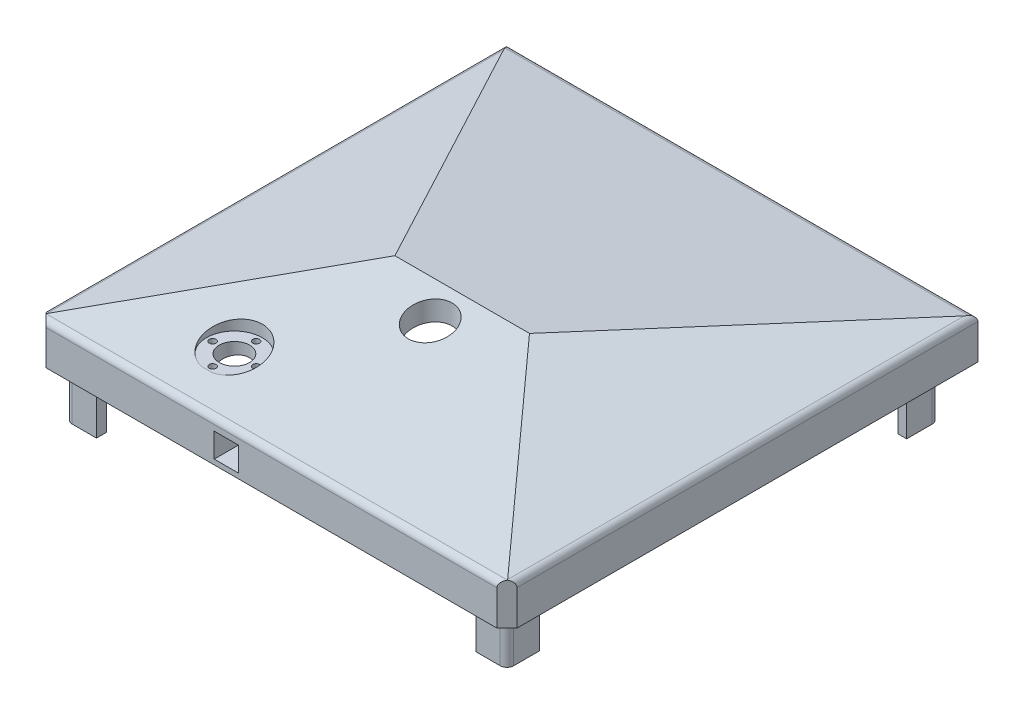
ISO-10303-21;
HEADER;
FILE_DESCRIPTION(('STEP AP214'),'2;1');
FILE_NAME('part.step','',(''),(''),'','','');
FILE_SCHEMA(('AUTOMOTIVE_DESIGN { 1 0 10303 214 1 1 1 1 }'));
ENDSEC;
DATA;
#1=APPLICATION_CONTEXT('core data for automotive mechanical design processes');
#2=APPLICATION_PROTOCOL_DEFINITION('international standard','automotive_design',2000,#1);
#3=PRODUCT_CONTEXT('',#1,'mechanical');
#4=PRODUCT('Part','Part','',(#3));
#5=PRODUCT_RELATED_PRODUCT_CATEGORY('part','',(#4));
#6=PRODUCT_DEFINITION_FORMATION('','',#4);
#7=PRODUCT_DEFINITION_CONTEXT('part definition',#1,'design');
#8=PRODUCT_DEFINITION('design','',#6,#7);
#9=PRODUCT_DEFINITION_SHAPE('','',#8);
#10=(LENGTH_UNIT() NAMED_UNIT(*) SI_UNIT(.MILLI.,.METRE.));
#11=(NAMED_UNIT(*) PLANE_ANGLE_UNIT() SI_UNIT($,.RADIAN.));
#12=(NAMED_UNIT(*) SI_UNIT($,.STERADIAN.) SOLID_ANGLE_UNIT());
#13=UNCERTAINTY_MEASURE_WITH_UNIT(LENGTH_MEASURE(1.E-05),#10,'distance_accuracy_value','');
#14=(GEOMETRIC_REPRESENTATION_CONTEXT(3) GLOBAL_UNCERTAINTY_ASSIGNED_CONTEXT((#13)) GLOBAL_UNIT_ASSIGNED_CONTEXT((#10,
#11,#12)) REPRESENTATION_CONTEXT('',''));
#15=CARTESIAN_POINT('',(0.,0.,0.));
#16=DIRECTION('',(0.,0.,1.));
#17=DIRECTION('',(1.,0.,0.));
#18=AXIS2_PLACEMENT_3D('',#15,#16,#17);
#19=CARTESIAN_POINT('',(0.,0.,-7.366));
#20=DIRECTION('',(0.,0.,1.));
#21=DIRECTION('',(1.,0.,0.));
#22=AXIS2_PLACEMENT_3D('',#19,#20,#21);
#23=PLANE('',#22);
#24=DIRECTION('',(0.,1.,0.));
#25=VECTOR('',#24,1.);
#26=CARTESIAN_POINT('',(-14.1264498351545,1.39533850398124,-7.366));
#27=LINE('',#26,#25);
#28=CARTESIAN_POINT('',(-14.1264498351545,1.39533850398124,-7.366));
#29=VERTEX_POINT('',#28);
#30=CARTESIAN_POINT('',(-14.1264498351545,1.90333850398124,-7.366));
#31=VERTEX_POINT('',#30);
#32=EDGE_CURVE('E827',#29,#31,#27,.T.);
#33=ORIENTED_EDGE('',*,*,#32,.F.);
#34=DIRECTION('',(-1.,0.,0.));
#35=VECTOR('',#34,1.);
#36=CARTESIAN_POINT('',(-11.9379999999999,1.39533850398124,-7.366));
#37=LINE('',#36,#35);
#38=CARTESIAN_POINT('',(-11.9379999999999,1.39533850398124,-7.366));
#39=VERTEX_POINT('',#38);
#40=EDGE_CURVE('E832',#39,#29,#37,.T.);
#41=ORIENTED_EDGE('',*,*,#40,.F.);
#42=DIRECTION('',(0.,-1.,0.));
#43=VECTOR('',#42,1.);
#44=CARTESIAN_POINT('',(-11.9379999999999,3.5837883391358,-7.366));
#45=LINE('',#44,#43);
#46=CARTESIAN_POINT('',(-11.9379999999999,3.5837883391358,-7.366));
#47=VERTEX_POINT('',#46);
#48=EDGE_CURVE('E836',#47,#39,#45,.T.);
#49=ORIENTED_EDGE('',*,*,#48,.F.);
#50=DIRECTION('',(1.,0.,0.));
#51=VECTOR('',#50,1.);
#52=CARTESIAN_POINT('',(-12.4459999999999,3.5837883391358,-7.366));
#53=LINE('',#52,#51);
#54=CARTESIAN_POINT('',(-12.4459999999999,3.5837883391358,-7.366));
#55=VERTEX_POINT('',#54);
#56=EDGE_CURVE('E823',#55,#47,#53,.T.);
#57=ORIENTED_EDGE('',*,*,#56,.F.);
#58=DIRECTION('',(0.,1.,0.));
#59=VECTOR('',#58,1.);
#60=CARTESIAN_POINT('',(-12.4459999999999,0.,-7.366));
#61=LINE('',#60,#59);
#62=CARTESIAN_POINT('',(-12.446,9.26977880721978,-7.366));
#63=VERTEX_POINT('',#62);
#64=EDGE_CURVE('E983',#55,#63,#61,.T.);
#65=ORIENTED_EDGE('',*,*,#64,.T.);
#66=DIRECTION('',(1.,0.,0.));
#67=VECTOR('',#66,1.);
#68=CARTESIAN_POINT('',(0.,9.26977880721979,-7.366));
#69=LINE('',#68,#67);
#70=CARTESIAN_POINT('',(69.8499999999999,9.26977880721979,-7.366));
#71=VERTEX_POINT('',#70);
#72=EDGE_CURVE('E1391',#63,#71,#69,.T.);
#73=ORIENTED_EDGE('',*,*,#72,.T.);
#74=DIRECTION('',(0.,-1.,0.));
#75=VECTOR('',#74,1.);
#76=CARTESIAN_POINT('',(69.85,30.482,-7.366));
#77=LINE('',#76,#75);
#78=CARTESIAN_POINT('',(69.85,0.,-7.366));
#79=VERTEX_POINT('',#78);
#80=EDGE_CURVE('E1316',#71,#79,#77,.T.);
#81=ORIENTED_EDGE('',*,*,#80,.T.);
#82=DIRECTION('',(1.,0.,0.));
#83=VECTOR('',#82,1.);
#84=CARTESIAN_POINT('',(0.,0.,-7.366));
#85=LINE('',#84,#83);
#86=CARTESIAN_POINT('',(-71.628,0.,-7.366));
#87=VERTEX_POINT('',#86);
#88=EDGE_CURVE('E1385',#87,#79,#85,.T.);
#89=ORIENTED_EDGE('',*,*,#88,.F.);
#90=DIRECTION('',(0.,-1.,0.));
#91=VECTOR('',#90,1.);
#92=CARTESIAN_POINT('',(-71.628,30.482,-7.366));
#93=LINE('',#92,#91);
#94=CARTESIAN_POINT('',(-71.6279999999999,9.26977880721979,-7.366));
#95=VERTEX_POINT('',#94);
#96=EDGE_CURVE('E1202',#95,#87,#93,.T.);
#97=ORIENTED_EDGE('',*,*,#96,.F.);
#98=CARTESIAN_POINT('',(-21.5899999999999,9.26977880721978,-7.366));
#99=VERTEX_POINT('',#98);
#100=EDGE_CURVE('E1386',#95,#99,#69,.T.);
#101=ORIENTED_EDGE('',*,*,#100,.T.);
#102=DIRECTION('',(0.,-1.,0.));
#103=VECTOR('',#102,1.);
#104=CARTESIAN_POINT('',(-21.5899999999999,0.,-7.366));
#105=LINE('',#104,#103);
#106=CARTESIAN_POINT('',(-21.5899999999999,3.5837883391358,-7.366));
#107=VERTEX_POINT('',#106);
#108=EDGE_CURVE('E995',#99,#107,#105,.T.);
#109=ORIENTED_EDGE('',*,*,#108,.T.);
#110=DIRECTION('',(1.,0.,0.));
#111=VECTOR('',#110,1.);
#112=CARTESIAN_POINT('',(-21.5899999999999,3.5837883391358,-7.366));
#113=LINE('',#112,#111);
#114=CARTESIAN_POINT('',(-22.0979999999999,3.5837883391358,-7.366));
#115=VERTEX_POINT('',#114);
#116=EDGE_CURVE('E879',#115,#107,#113,.T.);
#117=ORIENTED_EDGE('',*,*,#116,.F.);
#118=DIRECTION('',(0.,1.,0.));
#119=VECTOR('',#118,1.);
#120=CARTESIAN_POINT('',(-22.0979999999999,3.5837883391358,-7.366));
#121=LINE('',#120,#119);
#122=CARTESIAN_POINT('',(-22.0979999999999,1.39533850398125,-7.366));
#123=VERTEX_POINT('',#122);
#124=EDGE_CURVE('E883',#123,#115,#121,.T.);
#125=ORIENTED_EDGE('',*,*,#124,.F.);
#126=DIRECTION('',(-1.,0.,0.));
#127=VECTOR('',#126,1.);
#128=CARTESIAN_POINT('',(-22.0979999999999,1.39533850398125,-7.366));
#129=LINE('',#128,#127);
#130=CARTESIAN_POINT('',(-19.9095501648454,1.39533850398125,-7.366));
#131=VERTEX_POINT('',#130);
#132=EDGE_CURVE('E888',#131,#123,#129,.T.);
#133=ORIENTED_EDGE('',*,*,#132,.F.);
#134=DIRECTION('',(0.,-1.,0.));
#135=VECTOR('',#134,1.);
#136=CARTESIAN_POINT('',(-19.9095501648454,1.39533850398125,-7.366));
#137=LINE('',#136,#135);
#138=CARTESIAN_POINT('',(-19.9095501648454,1.90333850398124,-7.366));
#139=VERTEX_POINT('',#138);
#140=EDGE_CURVE('E892',#139,#131,#137,.T.);
#141=ORIENTED_EDGE('',*,*,#140,.F.);
#142=DIRECTION('',(1.,0.,0.));
#143=VECTOR('',#142,1.);
#144=CARTESIAN_POINT('',(0.,1.90333850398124,-7.366));
#145=LINE('',#144,#143);
#146=EDGE_CURVE('E1525',#139,#31,#145,.T.);
#147=ORIENTED_EDGE('',*,*,#146,.T.);
#148=EDGE_LOOP('',(#33,#41,#49,#57,#65,#73,#81,#89,#97,#101,#109,#117,#125,#133,#141,#147));
#149=FACE_BOUND('',#148,.T.);
#150=ADVANCED_FACE('F49',(#149),#23,.F.);
#151=CARTESIAN_POINT('',(-268.550831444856,8.03362392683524,-1.52515569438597));
#152=DIRECTION('',(0.,-0.978329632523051,-0.207053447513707));
#153=DIRECTION('',(0.,0.207053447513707,-0.978329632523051));
#154=AXIS2_PLACEMENT_3D('',#151,#152,#153);
#155=PLANE('',#154);
#156=CARTESIAN_POINT('',(-44.5344096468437,12.4414122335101,-22.352));
#157=DIRECTION('',(0.,-0.978329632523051,-0.207053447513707));
#158=DIRECTION('',(0.,0.207053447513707,-0.978329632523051));
#159=AXIS2_PLACEMENT_3D('',#156,#157,#158);
#160=ELLIPSE('',#159,1.29813097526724,1.26999999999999);
#161=CARTESIAN_POINT('',(-44.5344096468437,12.7101947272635,-23.622));
#162=VERTEX_POINT('',#161);
#163=EDGE_CURVE('E797',#162,#162,#160,.T.);
#164=ORIENTED_EDGE('',*,*,#163,.F.);
#165=EDGE_LOOP('',(#164));
#166=FACE_BOUND('',#165,.T.);
#167=CARTESIAN_POINT('',(-36.322,14.1794846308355,-30.5644096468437));
#168=DIRECTION('',(0.,-0.978329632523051,-0.207053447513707));
#169=DIRECTION('',(0.,0.207053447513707,-0.978329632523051));
#170=AXIS2_PLACEMENT_3D('',#167,#168,#169);
#171=ELLIPSE('',#170,1.29813097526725,1.27);
#172=CARTESIAN_POINT('',(-36.322,14.4482671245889,-31.8344096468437));
#173=VERTEX_POINT('',#172);
#174=EDGE_CURVE('E793',#173,#173,#171,.T.);
#175=ORIENTED_EDGE('',*,*,#174,.F.);
#176=EDGE_LOOP('',(#175));
#177=FACE_BOUND('',#176,.T.);
#178=CARTESIAN_POINT('',(-28.1095903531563,12.4414122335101,-22.352));
#179=DIRECTION('',(0.,-0.978329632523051,-0.207053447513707));
#180=DIRECTION('',(0.,0.207053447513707,-0.978329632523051));
#181=AXIS2_PLACEMENT_3D('',#178,#179,#180);
#182=ELLIPSE('',#181,1.29813097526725,1.27);
#183=CARTESIAN_POINT('',(-28.1095903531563,12.7101947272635,-23.622));
#184=VERTEX_POINT('',#183);
#185=EDGE_CURVE('E789',#184,#184,#182,.T.);
#186=ORIENTED_EDGE('',*,*,#185,.F.);
#187=EDGE_LOOP('',(#186));
#188=FACE_BOUND('',#187,.T.);
#189=CARTESIAN_POINT('',(-36.322,10.7033398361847,-14.1395903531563));
#190=DIRECTION('',(0.,-0.978329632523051,-0.207053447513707));
#191=DIRECTION('',(0.,0.207053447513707,-0.978329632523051));
#192=AXIS2_PLACEMENT_3D('',#189,#190,#191);
#193=ELLIPSE('',#192,1.29813097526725,1.27);
#194=CARTESIAN_POINT('',(-36.322,10.9721223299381,-15.4095903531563));
#195=VERTEX_POINT('',#194);
#196=EDGE_CURVE('E774',#195,#195,#193,.T.);
#197=ORIENTED_EDGE('',*,*,#196,.F.);
#198=EDGE_LOOP('',(#197));
#199=FACE_BOUND('',#198,.T.);
#200=CARTESIAN_POINT('',(-36.322,12.4414122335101,-22.352));
#201=DIRECTION('',(0.,-0.978329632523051,-0.207053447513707));
#202=DIRECTION('',(0.,-0.207053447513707,0.978329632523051));
#203=AXIS2_PLACEMENT_3D('',#200,#201,#202);
#204=ELLIPSE('',#203,5.84158938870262,5.71499999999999);
#205=CARTESIAN_POINT('',(-36.322,11.2318910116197,-16.637));
#206=VERTEX_POINT('',#205);
#207=EDGE_CURVE('E1007',#206,#206,#204,.T.);
#208=ORIENTED_EDGE('',*,*,#207,.F.);
#209=EDGE_LOOP('',(#208));
#210=FACE_BOUND('',#209,.T.);
#211=CARTESIAN_POINT('',(0.,20.3936416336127,-59.9263643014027));
#212=DIRECTION('',(0.,-0.978329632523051,-0.207053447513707));
#213=DIRECTION('',(0.,-0.207053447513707,0.978329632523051));
#214=AXIS2_PLACEMENT_3D('',#211,#212,#213);
#215=ELLIPSE('',#214,8.43785133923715,8.25500000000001);
#216=CARTESIAN_POINT('',(0.,18.6465554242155,-51.6713643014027));
#217=VERTEX_POINT('',#216);
#218=EDGE_CURVE('E1013',#217,#217,#215,.T.);
#219=ORIENTED_EDGE('',*,*,#218,.F.);
#220=EDGE_LOOP('',(#219));
#221=FACE_BOUND('',#220,.T.);
#222=DIRECTION('',(0.,-0.207053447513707,0.978329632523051));
#223=VECTOR('',#222,1.);
#224=CARTESIAN_POINT('',(-12.446,8.03362392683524,-1.52515569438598));
#225=LINE('',#224,#223);
#226=CARTESIAN_POINT('',(-12.4459999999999,9.36688866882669,-7.82484507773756));
#227=VERTEX_POINT('',#226);
#228=EDGE_CURVE('E1511',#227,#63,#225,.T.);
#229=ORIENTED_EDGE('',*,*,#228,.F.);
#230=DIRECTION('',(1.,0.,0.));
#231=VECTOR('',#230,1.);
#232=CARTESIAN_POINT('',(-268.550831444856,9.36688866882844,-7.82484507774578));
#233=LINE('',#232,#231);
#234=CARTESIAN_POINT('',(-11.9379999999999,9.36688866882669,-7.82484507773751));
#235=VERTEX_POINT('',#234);
#236=EDGE_CURVE('E935',#227,#235,#233,.T.);
#237=ORIENTED_EDGE('',*,*,#236,.T.);
#238=DIRECTION('',(0.,0.207053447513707,-0.978329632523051));
#239=VECTOR('',#238,1.);
#240=CARTESIAN_POINT('',(-11.9379999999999,8.03362392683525,-1.52515569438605));
#241=LINE('',#240,#239);
#242=CARTESIAN_POINT('',(-11.9379999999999,9.96861329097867,-10.668));
#243=VERTEX_POINT('',#242);
#244=EDGE_CURVE('E1531',#235,#243,#241,.T.);
#245=ORIENTED_EDGE('',*,*,#244,.T.);
#246=DIRECTION('',(-1.,0.,0.));
#247=VECTOR('',#246,1.);
#248=CARTESIAN_POINT('',(-268.550831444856,9.96861329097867,-10.668));
#249=LINE('',#248,#247);
#250=CARTESIAN_POINT('',(-12.4459999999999,9.96861329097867,-10.668));
#251=VERTEX_POINT('',#250);
#252=EDGE_CURVE('E931',#243,#251,#249,.T.);
#253=ORIENTED_EDGE('',*,*,#252,.T.);
#254=CARTESIAN_POINT('',(-12.446,11.0473385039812,-15.7649875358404));
#255=VERTEX_POINT('',#254);
#256=EDGE_CURVE('E1512',#255,#251,#225,.T.);
#257=ORIENTED_EDGE('',*,*,#256,.F.);
#258=DIRECTION('',(1.,0.,0.));
#259=VECTOR('',#258,1.);
#260=CARTESIAN_POINT('',(-268.550831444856,11.0473385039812,-15.7649875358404));
#261=LINE('',#260,#259);
#262=CARTESIAN_POINT('',(-21.5899999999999,11.0473385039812,-15.7649875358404));
#263=VERTEX_POINT('',#262);
#264=EDGE_CURVE('E1516',#263,#255,#261,.T.);
#265=ORIENTED_EDGE('',*,*,#264,.F.);
#266=DIRECTION('',(0.,0.207053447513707,-0.978329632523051));
#267=VECTOR('',#266,1.);
#268=CARTESIAN_POINT('',(-21.5899999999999,8.03362392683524,-1.52515569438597));
#269=LINE('',#268,#267);
#270=CARTESIAN_POINT('',(-21.5899999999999,9.96861329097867,-10.668));
#271=VERTEX_POINT('',#270);
#272=EDGE_CURVE('E1520',#271,#263,#269,.T.);
#273=ORIENTED_EDGE('',*,*,#272,.F.);
#274=DIRECTION('',(1.,0.,0.));
#275=VECTOR('',#274,1.);
#276=CARTESIAN_POINT('',(-268.550831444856,9.96861329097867,-10.668));
#277=LINE('',#276,#275);
#278=CARTESIAN_POINT('',(-22.0979999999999,9.96861329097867,-10.668));
#279=VERTEX_POINT('',#278);
#280=EDGE_CURVE('E957',#279,#271,#277,.T.);
#281=ORIENTED_EDGE('',*,*,#280,.F.);
#282=DIRECTION('',(0.,-0.207053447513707,0.978329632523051));
#283=VECTOR('',#282,1.);
#284=CARTESIAN_POINT('',(-22.0979999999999,8.03362392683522,-1.52515569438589));
#285=LINE('',#284,#283);
#286=CARTESIAN_POINT('',(-22.0979999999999,9.36688866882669,-7.82484507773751));
#287=VERTEX_POINT('',#286);
#288=EDGE_CURVE('E1528',#279,#287,#285,.T.);
#289=ORIENTED_EDGE('',*,*,#288,.T.);
#290=DIRECTION('',(1.,0.,0.));
#291=VECTOR('',#290,1.);
#292=CARTESIAN_POINT('',(-268.550831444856,9.36688866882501,-7.82484507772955));
#293=LINE('',#292,#291);
#294=CARTESIAN_POINT('',(-21.5899999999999,9.3668886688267,-7.82484507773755));
#295=VERTEX_POINT('',#294);
#296=EDGE_CURVE('E961',#287,#295,#293,.T.);
#297=ORIENTED_EDGE('',*,*,#296,.T.);
#298=EDGE_CURVE('E1521',#99,#295,#269,.T.);
#299=ORIENTED_EDGE('',*,*,#298,.F.);
#300=ORIENTED_EDGE('',*,*,#100,.F.);
#301=DIRECTION('',(0.,0.207053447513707,-0.978329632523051));
#302=VECTOR('',#301,1.);
#303=CARTESIAN_POINT('',(-71.628,9.81900742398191,-9.96111076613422));
#304=LINE('',#303,#302);
#305=CARTESIAN_POINT('',(-71.628,9.69983079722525,-9.398));
#306=VERTEX_POINT('',#305);
#307=EDGE_CURVE('E1176',#95,#306,#304,.T.);
#308=ORIENTED_EDGE('',*,*,#307,.T.);
#309=DIRECTION('',(-1.,0.,0.));
#310=VECTOR('',#309,1.);
#311=CARTESIAN_POINT('',(-80.01,9.69983079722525,-9.398));
#312=LINE('',#311,#310);
#313=CARTESIAN_POINT('',(-80.01,9.69983079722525,-9.398));
#314=VERTEX_POINT('',#313);
#315=EDGE_CURVE('E1180',#306,#314,#312,.T.);
#316=ORIENTED_EDGE('',*,*,#315,.T.);
#317=DIRECTION('',(0.,0.207053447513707,-0.978329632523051));
#318=VECTOR('',#317,1.);
#319=CARTESIAN_POINT('',(-80.01,12.2886984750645,-21.630425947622));
#320=LINE('',#319,#318);
#321=CARTESIAN_POINT('',(-80.0099999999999,9.79842909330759,-9.86387794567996));
#322=VERTEX_POINT('',#321);
#323=EDGE_CURVE('E1186',#314,#322,#320,.T.);
#324=ORIENTED_EDGE('',*,*,#323,.T.);
#325=DIRECTION('',(0.653223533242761,0.156773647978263,-0.740757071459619));
#326=VECTOR('',#325,1.);
#327=CARTESIAN_POINT('',(29.6137205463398,36.1081220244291,-134.17744299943));
#328=LINE('',#327,#326);
#329=CARTESIAN_POINT('',(-24.9923015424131,23.0026767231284,-72.2540814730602));
#330=VERTEX_POINT('',#329);
#331=EDGE_CURVE('E1402',#322,#330,#328,.T.);
#332=ORIENTED_EDGE('',*,*,#331,.T.);
#333=DIRECTION('',(1.,0.,0.));
#334=VECTOR('',#333,1.);
#335=CARTESIAN_POINT('',(-268.550831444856,23.0026767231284,-72.2540814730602));
#336=LINE('',#335,#334);
#337=CARTESIAN_POINT('',(24.9923015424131,23.0026767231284,-72.2540814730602));
#338=VERTEX_POINT('',#337);
#339=EDGE_CURVE('E1355',#330,#338,#336,.T.);
#340=ORIENTED_EDGE('',*,*,#339,.T.);
#341=DIRECTION('',(0.653223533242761,-0.156773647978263,0.740757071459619));
#342=VECTOR('',#341,1.);
#343=CARTESIAN_POINT('',(-58.2699345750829,42.9856133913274,-166.673659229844));
#344=LINE('',#343,#342);
#345=CARTESIAN_POINT('',(78.2319999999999,10.2251490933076,-11.8801342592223));
#346=VERTEX_POINT('',#345);
#347=EDGE_CURVE('E1395',#338,#346,#344,.T.);
#348=ORIENTED_EDGE('',*,*,#347,.T.);
#349=DIRECTION('',(0.,-0.207053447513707,0.978329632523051));
#350=VECTOR('',#349,1.);
#351=CARTESIAN_POINT('',(78.232,12.6488617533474,-23.3322010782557));
#352=LINE('',#351,#350);
#353=CARTESIAN_POINT('',(78.232,10.07612628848,-11.176));
#354=VERTEX_POINT('',#353);
#355=EDGE_CURVE('E1330',#346,#354,#352,.T.);
#356=ORIENTED_EDGE('',*,*,#355,.T.);
#357=DIRECTION('',(-1.,0.,0.));
#358=VECTOR('',#357,1.);
#359=CARTESIAN_POINT('',(78.232,10.07612628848,-11.176));
#360=LINE('',#359,#358);
#361=CARTESIAN_POINT('',(69.8499999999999,10.07612628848,-11.176));
#362=VERTEX_POINT('',#361);
#363=EDGE_CURVE('E1296',#354,#362,#360,.T.);
#364=ORIENTED_EDGE('',*,*,#363,.T.);
#365=DIRECTION('',(0.,-0.207053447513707,0.978329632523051));
#366=VECTOR('',#365,1.);
#367=CARTESIAN_POINT('',(69.85,10.1791707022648,-11.6628858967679));
#368=LINE('',#367,#366);
#369=EDGE_CURVE('E1342',#362,#71,#368,.T.);
#370=ORIENTED_EDGE('',*,*,#369,.T.);
#371=ORIENTED_EDGE('',*,*,#72,.F.);
#372=EDGE_LOOP('',(#229,#237,#245,#253,#257,#265,#273,#281,#289,#297,#299,#300,#308,#316,#324,
#332,#340,#348,#356,#364,#370,#371));
#373=FACE_BOUND('',#372,.T.);
#374=ADVANCED_FACE('F1623',(#166,#177,#188,#199,#210,#221,#373),#155,.T.);
#375=CARTESIAN_POINT('',(-268.550831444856,15.24,0.));
#376=DIRECTION('',(0.,-0.978329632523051,-0.207053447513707));
#377=DIRECTION('',(0.,0.207053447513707,-0.978329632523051));
#378=AXIS2_PLACEMENT_3D('',#375,#376,#377);
#379=PLANE('',#378);
#380=DIRECTION('',(1.,0.,0.));
#381=VECTOR('',#380,1.);
#382=CARTESIAN_POINT('',(85.0899999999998,15.6662603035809,-2.01408424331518));
#383=LINE('',#382,#381);
#384=CARTESIAN_POINT('',(-87.1033625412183,15.6662603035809,-2.01408424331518));
#385=VERTEX_POINT('',#384);
#386=CARTESIAN_POINT('',(87.1033625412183,15.6662603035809,-2.01408424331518));
#387=VERTEX_POINT('',#386);
#388=EDGE_CURVE('E1564',#385,#387,#383,.T.);
#389=ORIENTED_EDGE('',*,*,#388,.T.);
#390=CARTESIAN_POINT('',(86.36,13.2374721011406,9.46196456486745));
#391=DIRECTION('',(0.,-0.978329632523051,-0.207053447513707));
#392=DIRECTION('',(0.,0.207053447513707,-0.978329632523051));
#393=AXIS2_PLACEMENT_3D('',#390,#391,#392);
#394=ELLIPSE('',#393,12.2673639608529,2.54);
#395=CARTESIAN_POINT('',(86.9527672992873,15.7073358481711,-2.20816660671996));
#396=VERTEX_POINT('',#395);
#397=EDGE_CURVE('E1567',#387,#396,#394,.F.);
#398=ORIENTED_EDGE('',*,*,#397,.T.);
#399=DIRECTION('',(0.653223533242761,-0.156773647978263,0.740757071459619));
#400=VECTOR('',#399,1.);
#401=CARTESIAN_POINT('',(-57.3889774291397,50.3493545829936,-165.892055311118));
#402=LINE('',#401,#400);
#403=CARTESIAN_POINT('',(25.4,30.48,-72.0091540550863));
#404=VERTEX_POINT('',#403);
#405=EDGE_CURVE('E1444',#404,#396,#402,.T.);
#406=ORIENTED_EDGE('',*,*,#405,.F.);
#407=DIRECTION('',(1.,0.,0.));
#408=VECTOR('',#407,1.);
#409=CARTESIAN_POINT('',(-268.550831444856,30.48,-72.0091540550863));
#410=LINE('',#409,#408);
#411=CARTESIAN_POINT('',(-25.3999999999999,30.48,-72.0091540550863));
#412=VERTEX_POINT('',#411);
#413=EDGE_CURVE('E1422',#412,#404,#410,.T.);
#414=ORIENTED_EDGE('',*,*,#413,.F.);
#415=DIRECTION('',(0.653223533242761,0.156773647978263,-0.740757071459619));
#416=VECTOR('',#415,1.);
#417=CARTESIAN_POINT('',(28.7327634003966,43.4718632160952,-133.395839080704));
#418=LINE('',#417,#416);
#419=CARTESIAN_POINT('',(-86.9527672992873,15.7073358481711,-2.20816660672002));
#420=VERTEX_POINT('',#419);
#421=EDGE_CURVE('E1475',#420,#412,#418,.T.);
#422=ORIENTED_EDGE('',*,*,#421,.F.);
#423=CARTESIAN_POINT('',(-86.36,13.2374721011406,9.46196456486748));
#424=DIRECTION('',(0.,-0.978329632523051,-0.207053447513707));
#425=DIRECTION('',(0.,0.207053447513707,-0.978329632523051));
#426=AXIS2_PLACEMENT_3D('',#423,#424,#425);
#427=ELLIPSE('',#426,12.2673639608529,2.54);
#428=EDGE_CURVE('E1561',#420,#385,#427,.F.);
#429=ORIENTED_EDGE('',*,*,#428,.T.);
#430=EDGE_LOOP('',(#389,#398,#406,#414,#422,#429));
#431=FACE_BOUND('',#430,.T.);
#432=CARTESIAN_POINT('',(0.,27.9228012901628,-59.9263643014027));
#433=DIRECTION('',(0.,-0.978329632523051,-0.207053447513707));
#434=DIRECTION('',(0.,-0.207053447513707,0.978329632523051));
#435=AXIS2_PLACEMENT_3D('',#432,#433,#434);
#436=ELLIPSE('',#435,8.43785133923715,8.25500000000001);
#437=CARTESIAN_POINT('',(0.,26.1757150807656,-51.6713643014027));
#438=VERTEX_POINT('',#437);
#439=EDGE_CURVE('E1008',#438,#438,#436,.T.);
#440=ORIENTED_EDGE('',*,*,#439,.T.);
#441=EDGE_LOOP('',(#440));
#442=FACE_BOUND('',#441,.T.);
#443=CARTESIAN_POINT('',(-36.322,19.9705718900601,-22.352));
#444=DIRECTION('',(0.,-0.978329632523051,-0.207053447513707));
#445=DIRECTION('',(0.,0.207053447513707,-0.978329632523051));
#446=AXIS2_PLACEMENT_3D('',#443,#444,#445);
#447=ELLIPSE('',#446,10.7744870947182,10.541);
#448=CARTESIAN_POINT('',(-34.326915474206,17.78,-12.0015256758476));
#449=VERTEX_POINT('',#448);
#450=CARTESIAN_POINT('',(-38.317084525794,17.78,-12.0015256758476));
#451=VERTEX_POINT('',#450);
#452=EDGE_CURVE('E1478',#449,#451,#447,.F.);
#453=ORIENTED_EDGE('',*,*,#452,.F.);
#454=DIRECTION('',(-1.,0.,0.));
#455=VECTOR('',#454,1.);
#456=CARTESIAN_POINT('',(-268.550831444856,17.78,-12.0015256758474));
#457=LINE('',#456,#455);
#458=EDGE_CURVE('E1003',#449,#451,#457,.T.);
#459=ORIENTED_EDGE('',*,*,#458,.T.);
#460=EDGE_LOOP('',(#453,#459));
#461=FACE_BOUND('',#460,.T.);
#462=ADVANCED_FACE('F1632',(#431,#442,#461),#379,.F.);
#463=CARTESIAN_POINT('',(0.,0.,-170.434));
#464=DIRECTION('',(0.,0.,1.));
#465=DIRECTION('',(1.,0.,0.));
#466=AXIS2_PLACEMENT_3D('',#463,#464,#465);
#467=PLANE('',#466);
#468=DIRECTION('',(1.,0.,0.));
#469=VECTOR('',#468,1.);
#470=CARTESIAN_POINT('',(0.,8.85909043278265,-170.434));
#471=LINE('',#470,#469);
#472=CARTESIAN_POINT('',(78.994,8.85909043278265,-170.434));
#473=VERTEX_POINT('',#472);
#474=CARTESIAN_POINT('',(81.534,8.85909043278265,-170.434));
#475=VERTEX_POINT('',#474);
#476=EDGE_CURVE('E1401',#473,#475,#471,.T.);
#477=ORIENTED_EDGE('',*,*,#476,.F.);
#478=DIRECTION('',(0.,-1.,0.));
#479=VECTOR('',#478,1.);
#480=CARTESIAN_POINT('',(78.994,30.482,-170.434));
#481=LINE('',#480,#479);
#482=CARTESIAN_POINT('',(78.994,0.,-170.434));
#483=VERTEX_POINT('',#482);
#484=EDGE_CURVE('E1043',#473,#483,#481,.T.);
#485=ORIENTED_EDGE('',*,*,#484,.T.);
#486=DIRECTION('',(1.,0.,0.));
#487=VECTOR('',#486,1.);
#488=CARTESIAN_POINT('',(0.,0.,-170.434));
#489=LINE('',#488,#487);
#490=CARTESIAN_POINT('',(81.534,0.,-170.434));
#491=VERTEX_POINT('',#490);
#492=EDGE_CURVE('E1364',#483,#491,#489,.T.);
#493=ORIENTED_EDGE('',*,*,#492,.T.);
#494=DIRECTION('',(0.,1.,0.));
#495=VECTOR('',#494,1.);
#496=CARTESIAN_POINT('',(81.534,0.,-170.434));
#497=LINE('',#496,#495);
#498=EDGE_CURVE('E1373',#491,#475,#497,.T.);
#499=ORIENTED_EDGE('',*,*,#498,.T.);
#500=EDGE_LOOP('',(#477,#485,#493,#499));
#501=FACE_BOUND('',#500,.T.);
#502=ADVANCED_FACE('F1901',(#501),#467,.T.);
#503=CARTESIAN_POINT('',(81.534,30.48,-177.8));
#504=DIRECTION('',(1.,0.,0.));
#505=DIRECTION('',(0.,1.,0.));
#506=AXIS2_PLACEMENT_3D('',#503,#504,#505);
#507=PLANE('',#506);
#508=DIRECTION('',(0.,-1.,0.));
#509=VECTOR('',#508,1.);
#510=CARTESIAN_POINT('',(81.534,30.482,-167.894));
#511=LINE('',#510,#509);
#512=CARTESIAN_POINT('',(81.534,9.224997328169,-167.894));
#513=VERTEX_POINT('',#512);
#514=CARTESIAN_POINT('',(81.5339999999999,0.,-167.894));
#515=VERTEX_POINT('',#514);
#516=EDGE_CURVE('E1038',#513,#515,#511,.T.);
#517=ORIENTED_EDGE('',*,*,#516,.F.);
#518=DIRECTION('',(0.,0.14258591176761,0.989782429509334));
#519=VECTOR('',#518,1.);
#520=CARTESIAN_POINT('',(81.534,23.1892626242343,-70.9588662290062));
#521=LINE('',#520,#519);
#522=EDGE_CURVE('E1405',#475,#513,#521,.T.);
#523=ORIENTED_EDGE('',*,*,#522,.F.);
#524=ORIENTED_EDGE('',*,*,#498,.F.);
#525=DIRECTION('',(0.,0.,1.));
#526=VECTOR('',#525,1.);
#527=CARTESIAN_POINT('',(81.5339999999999,0.,-177.8));
#528=LINE('',#527,#526);
#529=EDGE_CURVE('E1410',#491,#515,#528,.T.);
#530=ORIENTED_EDGE('',*,*,#529,.T.);
#531=EDGE_LOOP('',(#517,#523,#524,#530));
#532=FACE_BOUND('',#531,.T.);
#533=ADVANCED_FACE('F1652',(#532),#507,.F.);
#534=CARTESIAN_POINT('',(-268.550831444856,23.1892626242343,-70.9588662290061));
#535=DIRECTION('',(0.,-0.989782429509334,0.14258591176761));
#536=DIRECTION('',(0.,-0.14258591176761,-0.989782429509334));
#537=AXIS2_PLACEMENT_3D('',#534,#535,#536);
#538=PLANE('',#537);
#539=CARTESIAN_POINT('',(78.994,9.22499732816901,-167.894));
#540=DIRECTION('',(0.,-0.989782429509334,0.14258591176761));
#541=DIRECTION('',(0.,-0.14258591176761,-0.989782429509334));
#542=AXIS2_PLACEMENT_3D('',#539,#540,#541);
#543=ELLIPSE('',#542,2.56622053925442,2.53999999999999);
#544=EDGE_CURVE('E1014',#513,#473,#543,.F.);
#545=ORIENTED_EDGE('',*,*,#544,.T.);
#546=ORIENTED_EDGE('',*,*,#476,.T.);
#547=ORIENTED_EDGE('',*,*,#522,.T.);
#548=EDGE_LOOP('',(#545,#546,#547));
#549=FACE_BOUND('',#548,.T.);
#550=ADVANCED_FACE('F1898',(#549),#538,.T.);
#551=CARTESIAN_POINT('',(-81.534,30.48,-177.8));
#552=DIRECTION('',(-1.,0.,0.));
#553=DIRECTION('',(0.,-1.,0.));
#554=AXIS2_PLACEMENT_3D('',#551,#552,#553);
#555=PLANE('',#554);
#556=DIRECTION('',(0.,0.14258591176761,0.989782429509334));
#557=VECTOR('',#556,1.);
#558=CARTESIAN_POINT('',(-81.534,8.25910313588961,-174.598905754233));
#559=LINE('',#558,#557);
#560=CARTESIAN_POINT('',(-81.534,8.85909043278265,-170.434));
#561=VERTEX_POINT('',#560);
#562=CARTESIAN_POINT('',(-81.534,9.22499732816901,-167.894));
#563=VERTEX_POINT('',#562);
#564=EDGE_CURVE('E1418',#561,#563,#559,.T.);
#565=ORIENTED_EDGE('',*,*,#564,.T.);
#566=DIRECTION('',(0.,-1.,0.));
#567=VECTOR('',#566,1.);
#568=CARTESIAN_POINT('',(-81.534,30.482,-167.894));
#569=LINE('',#568,#567);
#570=CARTESIAN_POINT('',(-81.534,0.,-167.894));
#571=VERTEX_POINT('',#570);
#572=EDGE_CURVE('E1127',#563,#571,#569,.T.);
#573=ORIENTED_EDGE('',*,*,#572,.T.);
#574=DIRECTION('',(0.,0.,1.));
#575=VECTOR('',#574,1.);
#576=CARTESIAN_POINT('',(-81.534,0.,-177.8));
#577=LINE('',#576,#575);
#578=CARTESIAN_POINT('',(-81.534,0.,-170.434));
#579=VERTEX_POINT('',#578);
#580=EDGE_CURVE('E1423',#579,#571,#577,.T.);
#581=ORIENTED_EDGE('',*,*,#580,.F.);
#582=DIRECTION('',(0.,-1.,0.));
#583=VECTOR('',#582,1.);
#584=CARTESIAN_POINT('',(-81.534,0.,-170.434));
#585=LINE('',#584,#583);
#586=EDGE_CURVE('E1361',#561,#579,#585,.T.);
#587=ORIENTED_EDGE('',*,*,#586,.F.);
#588=EDGE_LOOP('',(#565,#573,#581,#587));
#589=FACE_BOUND('',#588,.T.);
#590=ADVANCED_FACE('F1783',(#589),#555,.F.);
#591=CARTESIAN_POINT('',(47.752,7.62000000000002,-170.434));
#592=DIRECTION('',(0.,0.,1.));
#593=DIRECTION('',(1.,0.,0.));
#594=AXIS2_PLACEMENT_3D('',#591,#592,#593);
#595=CIRCLE('',#594,1.651);
#596=CARTESIAN_POINT('',(47.752,5.96900000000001,-170.434));
#597=VERTEX_POINT('',#596);
#598=CARTESIAN_POINT('',(46.6609198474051,8.85909043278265,-170.434));
#599=VERTEX_POINT('',#598);
#600=EDGE_CURVE('E628',#597,#599,#595,.F.);
#601=ORIENTED_EDGE('',*,*,#600,.T.);
#602=CARTESIAN_POINT('',(7.44108015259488,8.85909043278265,-170.434));
#603=VERTEX_POINT('',#602);
#604=EDGE_CURVE('E1685',#603,#599,#471,.T.);
#605=ORIENTED_EDGE('',*,*,#604,.F.);
#606=CARTESIAN_POINT('',(6.34999999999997,7.62000000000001,-170.434));
#607=DIRECTION('',(0.,0.,1.));
#608=DIRECTION('',(1.,0.,0.));
#609=AXIS2_PLACEMENT_3D('',#606,#607,#608);
#610=CIRCLE('',#609,1.651);
#611=CARTESIAN_POINT('',(6.34999999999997,5.96900000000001,-170.434));
#612=VERTEX_POINT('',#611);
#613=EDGE_CURVE('E685',#603,#612,#610,.F.);
#614=ORIENTED_EDGE('',*,*,#613,.T.);
#615=DIRECTION('',(-1.,0.,0.));
#616=VECTOR('',#615,1.);
#617=CARTESIAN_POINT('',(6.34999999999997,5.96900000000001,-170.434));
#618=LINE('',#617,#616);
#619=CARTESIAN_POINT('',(-3.04800000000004,5.96900000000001,-170.434));
#620=VERTEX_POINT('',#619);
#621=EDGE_CURVE('E690',#612,#620,#618,.T.);
#622=ORIENTED_EDGE('',*,*,#621,.T.);
#623=CARTESIAN_POINT('',(-3.04800000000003,7.62000000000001,-170.434));
#624=DIRECTION('',(0.,0.,1.));
#625=DIRECTION('',(1.,0.,0.));
#626=AXIS2_PLACEMENT_3D('',#623,#624,#625);
#627=CIRCLE('',#626,1.651);
#628=CARTESIAN_POINT('',(-4.13908015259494,8.85909043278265,-170.434));
#629=VERTEX_POINT('',#628);
#630=EDGE_CURVE('E691',#620,#629,#627,.F.);
#631=ORIENTED_EDGE('',*,*,#630,.T.);
#632=CARTESIAN_POINT('',(-43.3589198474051,8.85909043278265,-170.434));
#633=VERTEX_POINT('',#632);
#634=EDGE_CURVE('E1679',#633,#629,#471,.T.);
#635=ORIENTED_EDGE('',*,*,#634,.F.);
#636=CARTESIAN_POINT('',(-44.45,7.62,-170.434));
#637=DIRECTION('',(0.,0.,1.));
#638=DIRECTION('',(1.,0.,0.));
#639=AXIS2_PLACEMENT_3D('',#636,#637,#638);
#640=CIRCLE('',#639,1.651);
#641=CARTESIAN_POINT('',(-44.45,5.969,-170.434));
#642=VERTEX_POINT('',#641);
#643=EDGE_CURVE('E729',#633,#642,#640,.F.);
#644=ORIENTED_EDGE('',*,*,#643,.T.);
#645=DIRECTION('',(-1.,0.,0.));
#646=VECTOR('',#645,1.);
#647=CARTESIAN_POINT('',(-44.45,5.969,-170.434));
#648=LINE('',#647,#646);
#649=CARTESIAN_POINT('',(-53.848,5.969,-170.434));
#650=VERTEX_POINT('',#649);
#651=EDGE_CURVE('E733',#642,#650,#648,.T.);
#652=ORIENTED_EDGE('',*,*,#651,.T.);
#653=CARTESIAN_POINT('',(-53.848,7.62,-170.434));
#654=DIRECTION('',(0.,0.,1.));
#655=DIRECTION('',(1.,0.,0.));
#656=AXIS2_PLACEMENT_3D('',#653,#654,#655);
#657=CIRCLE('',#656,1.651);
#658=CARTESIAN_POINT('',(-54.9390801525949,8.85909043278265,-170.434));
#659=VERTEX_POINT('',#658);
#660=EDGE_CURVE('E734',#650,#659,#657,.F.);
#661=ORIENTED_EDGE('',*,*,#660,.T.);
#662=CARTESIAN_POINT('',(-69.85,8.85909043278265,-170.434));
#663=VERTEX_POINT('',#662);
#664=EDGE_CURVE('E1371',#663,#659,#471,.T.);
#665=ORIENTED_EDGE('',*,*,#664,.F.);
#666=DIRECTION('',(0.,-1.,0.));
#667=VECTOR('',#666,1.);
#668=CARTESIAN_POINT('',(-69.85,30.482,-170.434));
#669=LINE('',#668,#667);
#670=CARTESIAN_POINT('',(-69.85,0.,-170.434));
#671=VERTEX_POINT('',#670);
#672=EDGE_CURVE('E1118',#663,#671,#669,.T.);
#673=ORIENTED_EDGE('',*,*,#672,.T.);
#674=CARTESIAN_POINT('',(69.85,0.,-170.434));
#675=VERTEX_POINT('',#674);
#676=EDGE_CURVE('E1431',#671,#675,#489,.T.);
#677=ORIENTED_EDGE('',*,*,#676,.T.);
#678=DIRECTION('',(0.,-1.,0.));
#679=VECTOR('',#678,1.);
#680=CARTESIAN_POINT('',(69.85,30.482,-170.434));
#681=LINE('',#680,#679);
#682=CARTESIAN_POINT('',(69.85,8.85909043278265,-170.434));
#683=VERTEX_POINT('',#682);
#684=EDGE_CURVE('E1047',#683,#675,#681,.T.);
#685=ORIENTED_EDGE('',*,*,#684,.F.);
#686=CARTESIAN_POINT('',(58.2410801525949,8.85909043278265,-170.434));
#687=VERTEX_POINT('',#686);
#688=EDGE_CURVE('E1372',#687,#683,#471,.T.);
#689=ORIENTED_EDGE('',*,*,#688,.F.);
#690=CARTESIAN_POINT('',(57.15,7.62000000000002,-170.434));
#691=DIRECTION('',(0.,0.,1.));
#692=DIRECTION('',(1.,0.,0.));
#693=AXIS2_PLACEMENT_3D('',#690,#691,#692);
#694=CIRCLE('',#693,1.651);
#695=CARTESIAN_POINT('',(57.15,5.96900000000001,-170.434));
#696=VERTEX_POINT('',#695);
#697=EDGE_CURVE('E656',#687,#696,#694,.F.);
#698=ORIENTED_EDGE('',*,*,#697,.T.);
#699=DIRECTION('',(-1.,0.,0.));
#700=VECTOR('',#699,1.);
#701=CARTESIAN_POINT('',(57.15,5.96900000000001,-170.434));
#702=LINE('',#701,#700);
#703=EDGE_CURVE('E645',#696,#597,#702,.T.);
#704=ORIENTED_EDGE('',*,*,#703,.T.);
#705=EDGE_LOOP('',(#601,#605,#614,#622,#631,#635,#644,#652,#661,#665,#673,#677,#685,#689,#698,#704));
#706=FACE_BOUND('',#705,.T.);
#707=ADVANCED_FACE('F653',(#706),#467,.T.);
#708=CARTESIAN_POINT('',(-78.994,9.22499732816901,-167.894));
#709=DIRECTION('',(0.,-0.989782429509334,0.14258591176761));
#710=DIRECTION('',(0.,-0.14258591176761,-0.989782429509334));
#711=AXIS2_PLACEMENT_3D('',#708,#709,#710);
#712=ELLIPSE('',#711,2.56622053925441,2.53999999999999);
#713=CARTESIAN_POINT('',(-78.994,8.85909043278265,-170.434));
#714=VERTEX_POINT('',#713);
#715=EDGE_CURVE('E1099',#714,#563,#712,.F.);
#716=ORIENTED_EDGE('',*,*,#715,.T.);
#717=ORIENTED_EDGE('',*,*,#564,.F.);
#718=EDGE_CURVE('E1366',#561,#714,#471,.T.);
#719=ORIENTED_EDGE('',*,*,#718,.T.);
#720=EDGE_LOOP('',(#716,#717,#719));
#721=FACE_BOUND('',#720,.T.);
#722=ADVANCED_FACE('F1648',(#721),#538,.T.);
#723=DIRECTION('',(0.,0.,1.));
#724=VECTOR('',#723,1.);
#725=CARTESIAN_POINT('',(81.534,9.43266909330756,-243.103197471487));
#726=LINE('',#725,#724);
#727=CARTESIAN_POINT('',(81.534,9.43266909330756,-9.906));
#728=VERTEX_POINT('',#727);
#729=CARTESIAN_POINT('',(81.534,9.43266909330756,-8.13565824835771));
#730=VERTEX_POINT('',#729);
#731=EDGE_CURVE('E1381',#728,#730,#726,.T.);
#732=ORIENTED_EDGE('',*,*,#731,.F.);
#733=DIRECTION('',(0.,-1.,0.));
#734=VECTOR('',#733,1.);
#735=CARTESIAN_POINT('',(81.534,30.482,-9.906));
#736=LINE('',#735,#734);
#737=CARTESIAN_POINT('',(81.5339999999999,0.,-9.906));
#738=VERTEX_POINT('',#737);
#739=EDGE_CURVE('E1307',#728,#738,#736,.T.);
#740=ORIENTED_EDGE('',*,*,#739,.T.);
#741=CARTESIAN_POINT('',(81.534,0.,-7.366));
#742=VERTEX_POINT('',#741);
#743=EDGE_CURVE('E1427',#738,#742,#528,.T.);
#744=ORIENTED_EDGE('',*,*,#743,.T.);
#745=DIRECTION('',(0.,1.,0.));
#746=VECTOR('',#745,1.);
#747=CARTESIAN_POINT('',(81.534,0.,-7.366));
#748=LINE('',#747,#746);
#749=CARTESIAN_POINT('',(81.534,9.26977880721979,-7.366));
#750=VERTEX_POINT('',#749);
#751=EDGE_CURVE('E1365',#742,#750,#748,.T.);
#752=ORIENTED_EDGE('',*,*,#751,.T.);
#753=DIRECTION('',(0.,0.207053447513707,-0.978329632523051));
#754=VECTOR('',#753,1.);
#755=CARTESIAN_POINT('',(81.534,44.7033077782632,-174.789782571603));
#756=LINE('',#755,#754);
#757=EDGE_CURVE('E1414',#750,#730,#756,.T.);
#758=ORIENTED_EDGE('',*,*,#757,.T.);
#759=EDGE_LOOP('',(#732,#740,#744,#752,#758));
#760=FACE_BOUND('',#759,.T.);
#761=ADVANCED_FACE('F1640',(#760),#507,.F.);
#762=DIRECTION('',(0.,-1.,0.));
#763=VECTOR('',#762,1.);
#764=CARTESIAN_POINT('',(78.994,30.482,-7.366));
#765=LINE('',#764,#763);
#766=CARTESIAN_POINT('',(78.994,9.26977880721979,-7.366));
#767=VERTEX_POINT('',#766);
#768=CARTESIAN_POINT('',(78.994,0.,-7.366));
#769=VERTEX_POINT('',#768);
#770=EDGE_CURVE('E1311',#767,#769,#765,.T.);
#771=ORIENTED_EDGE('',*,*,#770,.F.);
#772=EDGE_CURVE('E1370',#767,#750,#69,.T.);
#773=ORIENTED_EDGE('',*,*,#772,.T.);
#774=ORIENTED_EDGE('',*,*,#751,.F.);
#775=EDGE_CURVE('E1359',#769,#742,#85,.T.);
#776=ORIENTED_EDGE('',*,*,#775,.F.);
#777=EDGE_LOOP('',(#771,#773,#774,#776));
#778=FACE_BOUND('',#777,.T.);
#779=ADVANCED_FACE('F1626',(#778),#23,.F.);
#780=CARTESIAN_POINT('',(23.6809748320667,23.3173951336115,-243.103197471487));
#781=DIRECTION('',(-0.233372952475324,-0.972387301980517,0.));
#782=DIRECTION('',(0.972387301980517,-0.233372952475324,0.));
#783=AXIS2_PLACEMENT_3D('',#780,#781,#782);
#784=PLANE('',#783);
#785=CARTESIAN_POINT('',(78.994,10.0422690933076,-9.906));
#786=DIRECTION('',(-0.233372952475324,-0.972387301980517,0.));
#787=DIRECTION('',(0.972387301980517,-0.233372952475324,0.));
#788=AXIS2_PLACEMENT_3D('',#785,#786,#787);
#789=ELLIPSE('',#788,2.61212789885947,2.54);
#790=CARTESIAN_POINT('',(81.1529058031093,9.52413170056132,-8.56781999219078));
#791=VERTEX_POINT('',#790);
#792=EDGE_CURVE('E1336',#791,#728,#789,.F.);
#793=ORIENTED_EDGE('',*,*,#792,.T.);
#794=ORIENTED_EDGE('',*,*,#731,.T.);
#795=EDGE_CURVE('E1394',#791,#730,#344,.T.);
#796=ORIENTED_EDGE('',*,*,#795,.F.);
#797=EDGE_LOOP('',(#793,#794,#796));
#798=FACE_BOUND('',#797,.T.);
#799=ADVANCED_FACE('F1639',(#798),#784,.T.);
#800=CARTESIAN_POINT('',(78.994,9.80734379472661,-9.906));
#801=DIRECTION('',(0.,-0.978329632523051,-0.207053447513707));
#802=DIRECTION('',(0.,-0.207053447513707,0.978329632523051));
#803=AXIS2_PLACEMENT_3D('',#800,#801,#802);
#804=ELLIPSE('',#803,2.5962619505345,2.54);
#805=EDGE_CURVE('E1339',#767,#791,#804,.F.);
#806=ORIENTED_EDGE('',*,*,#805,.T.);
#807=ORIENTED_EDGE('',*,*,#795,.T.);
#808=ORIENTED_EDGE('',*,*,#757,.F.);
#809=ORIENTED_EDGE('',*,*,#772,.F.);
#810=EDGE_LOOP('',(#806,#807,#808,#809));
#811=FACE_BOUND('',#810,.T.);
#812=ADVANCED_FACE('F1635',(#811),#155,.T.);
#813=CARTESIAN_POINT('',(-88.9,0.,-177.8));
#814=DIRECTION('',(0.,-1.,0.));
#815=DIRECTION('',(1.,0.,0.));
#816=AXIS2_PLACEMENT_3D('',#813,#814,#815);
#817=PLANE('',#816);
#818=DIRECTION('',(0.,0.,1.));
#819=VECTOR('',#818,1.);
#820=CARTESIAN_POINT('',(-71.628,0.,-5.588));
#821=LINE('',#820,#819);
#822=CARTESIAN_POINT('',(-71.628,0.,-5.58800000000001));
#823=VERTEX_POINT('',#822);
#824=EDGE_CURVE('E1238',#87,#823,#821,.T.);
#825=ORIENTED_EDGE('',*,*,#824,.F.);
#826=ORIENTED_EDGE('',*,*,#88,.T.);
#827=DIRECTION('',(-1.,0.,0.));
#828=VECTOR('',#827,1.);
#829=CARTESIAN_POINT('',(-88.9,0.,-7.36600000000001));
#830=LINE('',#829,#828);
#831=EDGE_CURVE('E1326',#769,#79,#830,.T.);
#832=ORIENTED_EDGE('',*,*,#831,.F.);
#833=ORIENTED_EDGE('',*,*,#775,.T.);
#834=ORIENTED_EDGE('',*,*,#743,.F.);
#835=DIRECTION('',(0.,0.,1.));
#836=VECTOR('',#835,1.);
#837=CARTESIAN_POINT('',(81.5339999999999,0.,-177.8));
#838=LINE('',#837,#836);
#839=CARTESIAN_POINT('',(81.5339999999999,0.,-19.558));
#840=VERTEX_POINT('',#839);
#841=EDGE_CURVE('E1351',#840,#738,#838,.T.);
#842=ORIENTED_EDGE('',*,*,#841,.F.);
#843=CARTESIAN_POINT('',(81.5339999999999,0.,-158.242));
#844=VERTEX_POINT('',#843);
#845=EDGE_CURVE('E1435',#844,#840,#528,.T.);
#846=ORIENTED_EDGE('',*,*,#845,.F.);
#847=DIRECTION('',(0.,0.,1.));
#848=VECTOR('',#847,1.);
#849=CARTESIAN_POINT('',(81.5339999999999,0.,-177.8));
#850=LINE('',#849,#848);
#851=EDGE_CURVE('E1086',#515,#844,#850,.T.);
#852=ORIENTED_EDGE('',*,*,#851,.F.);
#853=ORIENTED_EDGE('',*,*,#529,.F.);
#854=ORIENTED_EDGE('',*,*,#492,.F.);
#855=DIRECTION('',(1.,0.,0.));
#856=VECTOR('',#855,1.);
#857=CARTESIAN_POINT('',(-88.9,0.,-170.434));
#858=LINE('',#857,#856);
#859=EDGE_CURVE('E1090',#675,#483,#858,.T.);
#860=ORIENTED_EDGE('',*,*,#859,.F.);
#861=ORIENTED_EDGE('',*,*,#676,.F.);
#862=DIRECTION('',(1.,0.,0.));
#863=VECTOR('',#862,1.);
#864=CARTESIAN_POINT('',(-88.9,0.,-170.434));
#865=LINE('',#864,#863);
#866=CARTESIAN_POINT('',(-78.994,0.,-170.434));
#867=VERTEX_POINT('',#866);
#868=EDGE_CURVE('E1171',#867,#671,#865,.T.);
#869=ORIENTED_EDGE('',*,*,#868,.F.);
#870=EDGE_CURVE('E1378',#579,#867,#489,.T.);
#871=ORIENTED_EDGE('',*,*,#870,.F.);
#872=ORIENTED_EDGE('',*,*,#580,.T.);
#873=DIRECTION('',(0.,0.,-1.));
#874=VECTOR('',#873,1.);
#875=CARTESIAN_POINT('',(-81.534,0.,-177.8));
#876=LINE('',#875,#874);
#877=CARTESIAN_POINT('',(-81.534,0.,-158.242));
#878=VERTEX_POINT('',#877);
#879=EDGE_CURVE('E1167',#878,#571,#876,.T.);
#880=ORIENTED_EDGE('',*,*,#879,.F.);
#881=CARTESIAN_POINT('',(-81.534,0.,-17.78));
#882=VERTEX_POINT('',#881);
#883=EDGE_CURVE('E1377',#878,#882,#577,.T.);
#884=ORIENTED_EDGE('',*,*,#883,.T.);
#885=DIRECTION('',(1.,0.,0.));
#886=VECTOR('',#885,1.);
#887=CARTESIAN_POINT('',(-83.312,0.,-17.78));
#888=LINE('',#887,#886);
#889=CARTESIAN_POINT('',(-83.312,0.,-17.78));
#890=VERTEX_POINT('',#889);
#891=EDGE_CURVE('E1242',#890,#882,#888,.T.);
#892=ORIENTED_EDGE('',*,*,#891,.F.);
#893=DIRECTION('',(0.,0.,-1.));
#894=VECTOR('',#893,1.);
#895=CARTESIAN_POINT('',(-83.312,0.,-8.12800000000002));
#896=LINE('',#895,#894);
#897=CARTESIAN_POINT('',(-83.312,0.,-8.12800000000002));
#898=VERTEX_POINT('',#897);
#899=EDGE_CURVE('E1225',#898,#890,#896,.T.);
#900=ORIENTED_EDGE('',*,*,#899,.F.);
#901=CARTESIAN_POINT('',(-80.772,0.,-8.128));
#902=DIRECTION('',(0.,-1.,0.));
#903=DIRECTION('',(1.,0.,0.));
#904=AXIS2_PLACEMENT_3D('',#901,#902,#903);
#905=CIRCLE('',#904,2.54);
#906=CARTESIAN_POINT('',(-80.7719999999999,0.,-5.588));
#907=VERTEX_POINT('',#906);
#908=EDGE_CURVE('E1229',#907,#898,#905,.T.);
#909=ORIENTED_EDGE('',*,*,#908,.F.);
#910=DIRECTION('',(-1.,0.,0.));
#911=VECTOR('',#910,1.);
#912=CARTESIAN_POINT('',(-80.7719999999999,0.,-5.588));
#913=LINE('',#912,#911);
#914=EDGE_CURVE('E1234',#823,#907,#913,.T.);
#915=ORIENTED_EDGE('',*,*,#914,.F.);
#916=EDGE_LOOP('',(#825,#826,#832,#833,#834,#842,#846,#852,#853,#854,#860,#861,#869,#871,#872,
#880,#884,#892,#900,#909,#915));
#917=FACE_BOUND('',#916,.T.);
#918=DIRECTION('',(1.,0.,0.));
#919=VECTOR('',#918,1.);
#920=CARTESIAN_POINT('',(-88.9,0.,0.));
#921=LINE('',#920,#919);
#922=CARTESIAN_POINT('',(-85.0899999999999,0.,0.));
#923=VERTEX_POINT('',#922);
#924=CARTESIAN_POINT('',(85.09,0.,0.));
#925=VERTEX_POINT('',#924);
#926=EDGE_CURVE('E1448',#923,#925,#921,.T.);
#927=ORIENTED_EDGE('',*,*,#926,.F.);
#928=DIRECTION('',(0.707106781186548,0.,0.707106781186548));
#929=VECTOR('',#928,1.);
#930=CARTESIAN_POINT('',(-175.895,0.,-90.805));
#931=LINE('',#930,#929);
#932=CARTESIAN_POINT('',(-88.9,0.,-3.81000000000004));
#933=VERTEX_POINT('',#932);
#934=EDGE_CURVE('E1501',#923,#933,#931,.F.);
#935=ORIENTED_EDGE('',*,*,#934,.T.);
#936=DIRECTION('',(0.,0.,1.));
#937=VECTOR('',#936,1.);
#938=CARTESIAN_POINT('',(-88.9,0.,-177.8));
#939=LINE('',#938,#937);
#940=CARTESIAN_POINT('',(-88.9,0.,-177.8));
#941=VERTEX_POINT('',#940);
#942=EDGE_CURVE('E1460',#941,#933,#939,.T.);
#943=ORIENTED_EDGE('',*,*,#942,.F.);
#944=DIRECTION('',(1.,0.,0.));
#945=VECTOR('',#944,1.);
#946=CARTESIAN_POINT('',(-88.9,0.,-177.8));
#947=LINE('',#946,#945);
#948=CARTESIAN_POINT('',(88.9,0.,-177.8));
#949=VERTEX_POINT('',#948);
#950=EDGE_CURVE('E1452',#941,#949,#947,.T.);
#951=ORIENTED_EDGE('',*,*,#950,.T.);
#952=DIRECTION('',(0.,0.,1.));
#953=VECTOR('',#952,1.);
#954=CARTESIAN_POINT('',(88.9,0.,-177.8));
#955=LINE('',#954,#953);
#956=CARTESIAN_POINT('',(88.9,0.,-3.81000000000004));
#957=VERTEX_POINT('',#956);
#958=EDGE_CURVE('E1464',#949,#957,#955,.T.);
#959=ORIENTED_EDGE('',*,*,#958,.T.);
#960=DIRECTION('',(0.707106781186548,0.,-0.707106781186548));
#961=VECTOR('',#960,1.);
#962=CARTESIAN_POINT('',(86.995,0.,-1.90500000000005));
#963=LINE('',#962,#961);
#964=EDGE_CURVE('E1498',#957,#925,#963,.F.);
#965=ORIENTED_EDGE('',*,*,#964,.T.);
#966=EDGE_LOOP('',(#927,#935,#943,#951,#959,#965));
#967=FACE_BOUND('',#966,.T.);
#968=ADVANCED_FACE('F1774',(#917,#967),#817,.T.);
#969=CARTESIAN_POINT('',(-88.9,30.48,-177.8));
#970=DIRECTION('',(-1.,0.,0.));
#971=DIRECTION('',(0.,-1.,0.));
#972=AXIS2_PLACEMENT_3D('',#969,#970,#971);
#973=PLANE('',#972);
#974=DIRECTION('',(0.,0.,1.));
#975=VECTOR('',#974,1.);
#976=CARTESIAN_POINT('',(-88.9,13.2374721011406,-177.8));
#977=LINE('',#976,#975);
#978=CARTESIAN_POINT('',(-88.9,13.2374721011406,-3.81000000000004));
#979=VERTEX_POINT('',#978);
#980=CARTESIAN_POINT('',(-88.9,13.2374721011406,-177.792287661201));
#981=VERTEX_POINT('',#980);
#982=EDGE_CURVE('E1555',#979,#981,#977,.F.);
#983=ORIENTED_EDGE('',*,*,#982,.T.);
#984=CARTESIAN_POINT('',(-88.9,13.039686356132,-175.26));
#985=DIRECTION('',(-1.,0.,0.));
#986=DIRECTION('',(0.,-1.,0.));
#987=AXIS2_PLACEMENT_3D('',#984,#985,#986);
#988=CIRCLE('',#987,2.54);
#989=CARTESIAN_POINT('',(-88.9,13.039686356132,-177.8));
#990=VERTEX_POINT('',#989);
#991=EDGE_CURVE('E1558',#981,#990,#988,.T.);
#992=ORIENTED_EDGE('',*,*,#991,.T.);
#993=DIRECTION('',(0.,-1.,0.));
#994=VECTOR('',#993,1.);
#995=CARTESIAN_POINT('',(-88.9,30.48,-177.8));
#996=LINE('',#995,#994);
#997=EDGE_CURVE('E1449',#990,#941,#996,.T.);
#998=ORIENTED_EDGE('',*,*,#997,.T.);
#999=ORIENTED_EDGE('',*,*,#942,.T.);
#1000=DIRECTION('',(0.,1.,0.));
#1001=VECTOR('',#1000,1.);
#1002=CARTESIAN_POINT('',(-88.9,30.48,-3.81000000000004));
#1003=LINE('',#1002,#1001);
#1004=EDGE_CURVE('E1504',#933,#979,#1003,.T.);
#1005=ORIENTED_EDGE('',*,*,#1004,.T.);
#1006=EDGE_LOOP('',(#983,#992,#998,#999,#1005));
#1007=FACE_BOUND('',#1006,.T.);
#1008=ADVANCED_FACE('F1972',(#1007),#973,.T.);
#1009=CARTESIAN_POINT('',(88.9,30.48,-177.8));
#1010=DIRECTION('',(1.,0.,0.));
#1011=DIRECTION('',(0.,1.,0.));
#1012=AXIS2_PLACEMENT_3D('',#1009,#1010,#1011);
#1013=PLANE('',#1012);
#1014=DIRECTION('',(0.,1.,0.));
#1015=VECTOR('',#1014,1.);
#1016=CARTESIAN_POINT('',(88.9,30.48,-177.8));
#1017=LINE('',#1016,#1015);
#1018=CARTESIAN_POINT('',(88.9,13.039686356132,-177.8));
#1019=VERTEX_POINT('',#1018);
#1020=EDGE_CURVE('E1456',#949,#1019,#1017,.T.);
#1021=ORIENTED_EDGE('',*,*,#1020,.T.);
#1022=CARTESIAN_POINT('',(88.9,13.039686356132,-175.26));
#1023=DIRECTION('',(1.,0.,0.));
#1024=DIRECTION('',(0.,1.,0.));
#1025=AXIS2_PLACEMENT_3D('',#1022,#1023,#1024);
#1026=CIRCLE('',#1025,2.54);
#1027=CARTESIAN_POINT('',(88.9,13.2374721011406,-177.792287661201));
#1028=VERTEX_POINT('',#1027);
#1029=EDGE_CURVE('E1542',#1019,#1028,#1026,.T.);
#1030=ORIENTED_EDGE('',*,*,#1029,.T.);
#1031=DIRECTION('',(0.,0.,1.));
#1032=VECTOR('',#1031,1.);
#1033=CARTESIAN_POINT('',(88.9,13.2374721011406,-3.81000000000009));
#1034=LINE('',#1033,#1032);
#1035=CARTESIAN_POINT('',(88.9,13.2374721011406,-3.81000000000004));
#1036=VERTEX_POINT('',#1035);
#1037=EDGE_CURVE('E1539',#1028,#1036,#1034,.T.);
#1038=ORIENTED_EDGE('',*,*,#1037,.T.);
#1039=DIRECTION('',(0.,-1.,0.));
#1040=VECTOR('',#1039,1.);
#1041=CARTESIAN_POINT('',(88.9,30.48,-3.81000000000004));
#1042=LINE('',#1041,#1040);
#1043=EDGE_CURVE('E1508',#1036,#957,#1042,.T.);
#1044=ORIENTED_EDGE('',*,*,#1043,.T.);
#1045=ORIENTED_EDGE('',*,*,#958,.F.);
#1046=EDGE_LOOP('',(#1021,#1030,#1038,#1044,#1045));
#1047=FACE_BOUND('',#1046,.T.);
#1048=ADVANCED_FACE('F1937',(#1047),#1013,.T.);
#1049=CARTESIAN_POINT('',(0.,0.,-177.8));
#1050=DIRECTION('',(0.,0.,1.));
#1051=DIRECTION('',(1.,0.,0.));
#1052=AXIS2_PLACEMENT_3D('',#1049,#1050,#1051);
#1053=PLANE('',#1052);
#1054=CARTESIAN_POINT('',(47.752,7.62000000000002,-177.8));
#1055=DIRECTION('',(0.,0.,-1.));
#1056=DIRECTION('',(-1.,0.,0.));
#1057=AXIS2_PLACEMENT_3D('',#1054,#1055,#1056);
#1058=CIRCLE('',#1057,1.651);
#1059=CARTESIAN_POINT('',(47.752,5.96900000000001,-177.8));
#1060=VERTEX_POINT('',#1059);
#1061=CARTESIAN_POINT('',(47.752,9.27100000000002,-177.8));
#1062=VERTEX_POINT('',#1061);
#1063=EDGE_CURVE('E660',#1060,#1062,#1058,.T.);
#1064=ORIENTED_EDGE('',*,*,#1063,.F.);
#1065=DIRECTION('',(-1.,0.,0.));
#1066=VECTOR('',#1065,1.);
#1067=CARTESIAN_POINT('',(57.15,5.96900000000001,-177.8));
#1068=LINE('',#1067,#1066);
#1069=CARTESIAN_POINT('',(57.15,5.96900000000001,-177.8));
#1070=VERTEX_POINT('',#1069);
#1071=EDGE_CURVE('E648',#1070,#1060,#1068,.T.);
#1072=ORIENTED_EDGE('',*,*,#1071,.F.);
#1073=CARTESIAN_POINT('',(57.15,7.62000000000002,-177.8));
#1074=DIRECTION('',(0.,0.,-1.));
#1075=DIRECTION('',(-1.,0.,0.));
#1076=AXIS2_PLACEMENT_3D('',#1073,#1074,#1075);
#1077=CIRCLE('',#1076,1.651);
#1078=CARTESIAN_POINT('',(57.15,9.27100000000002,-177.8));
#1079=VERTEX_POINT('',#1078);
#1080=EDGE_CURVE('E664',#1079,#1070,#1077,.T.);
#1081=ORIENTED_EDGE('',*,*,#1080,.F.);
#1082=DIRECTION('',(1.,0.,0.));
#1083=VECTOR('',#1082,1.);
#1084=CARTESIAN_POINT('',(57.15,9.27100000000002,-177.8));
#1085=LINE('',#1084,#1083);
#1086=EDGE_CURVE('E67',#1062,#1079,#1085,.T.);
#1087=ORIENTED_EDGE('',*,*,#1086,.F.);
#1088=EDGE_LOOP('',(#1064,#1072,#1081,#1087));
#1089=FACE_BOUND('',#1088,.T.);
#1090=CARTESIAN_POINT('',(-3.04800000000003,7.62000000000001,-177.8));
#1091=DIRECTION('',(0.,0.,-1.));
#1092=DIRECTION('',(-1.,0.,0.));
#1093=AXIS2_PLACEMENT_3D('',#1090,#1091,#1092);
#1094=CIRCLE('',#1093,1.651);
#1095=CARTESIAN_POINT('',(-3.04800000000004,5.96900000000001,-177.8));
#1096=VERTEX_POINT('',#1095);
#1097=CARTESIAN_POINT('',(-3.04800000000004,9.27100000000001,-177.8));
#1098=VERTEX_POINT('',#1097);
#1099=EDGE_CURVE('E720',#1096,#1098,#1094,.T.);
#1100=ORIENTED_EDGE('',*,*,#1099,.F.);
#1101=DIRECTION('',(-1.,0.,0.));
#1102=VECTOR('',#1101,1.);
#1103=CARTESIAN_POINT('',(6.34999999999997,5.96900000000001,-177.8));
#1104=LINE('',#1103,#1102);
#1105=CARTESIAN_POINT('',(6.34999999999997,5.96900000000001,-177.8));
#1106=VERTEX_POINT('',#1105);
#1107=EDGE_CURVE('E716',#1106,#1096,#1104,.T.);
#1108=ORIENTED_EDGE('',*,*,#1107,.F.);
#1109=CARTESIAN_POINT('',(6.34999999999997,7.62000000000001,-177.8));
#1110=DIRECTION('',(0.,0.,-1.));
#1111=DIRECTION('',(-1.,0.,0.));
#1112=AXIS2_PLACEMENT_3D('',#1109,#1110,#1111);
#1113=CIRCLE('',#1112,1.651);
#1114=CARTESIAN_POINT('',(6.34999999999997,9.27100000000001,-177.8));
#1115=VERTEX_POINT('',#1114);
#1116=EDGE_CURVE('E712',#1115,#1106,#1113,.T.);
#1117=ORIENTED_EDGE('',*,*,#1116,.F.);
#1118=DIRECTION('',(1.,0.,0.));
#1119=VECTOR('',#1118,1.);
#1120=CARTESIAN_POINT('',(6.34999999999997,9.27100000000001,-177.8));
#1121=LINE('',#1120,#1119);
#1122=EDGE_CURVE('E75',#1098,#1115,#1121,.T.);
#1123=ORIENTED_EDGE('',*,*,#1122,.F.);
#1124=EDGE_LOOP('',(#1100,#1108,#1117,#1123));
#1125=FACE_BOUND('',#1124,.T.);
#1126=CARTESIAN_POINT('',(-53.848,7.62,-177.8));
#1127=DIRECTION('',(0.,0.,-1.));
#1128=DIRECTION('',(-1.,0.,0.));
#1129=AXIS2_PLACEMENT_3D('',#1126,#1127,#1128);
#1130=CIRCLE('',#1129,1.651);
#1131=CARTESIAN_POINT('',(-53.848,5.969,-177.8));
#1132=VERTEX_POINT('',#1131);
#1133=CARTESIAN_POINT('',(-53.848,9.271,-177.8));
#1134=VERTEX_POINT('',#1133);
#1135=EDGE_CURVE('E764',#1132,#1134,#1130,.T.);
#1136=ORIENTED_EDGE('',*,*,#1135,.F.);
#1137=DIRECTION('',(-1.,0.,0.));
#1138=VECTOR('',#1137,1.);
#1139=CARTESIAN_POINT('',(-44.45,5.969,-177.8));
#1140=LINE('',#1139,#1138);
#1141=CARTESIAN_POINT('',(-44.45,5.969,-177.8));
#1142=VERTEX_POINT('',#1141);
#1143=EDGE_CURVE('E760',#1142,#1132,#1140,.T.);
#1144=ORIENTED_EDGE('',*,*,#1143,.F.);
#1145=CARTESIAN_POINT('',(-44.45,7.62,-177.8));
#1146=DIRECTION('',(0.,0.,-1.));
#1147=DIRECTION('',(-1.,0.,0.));
#1148=AXIS2_PLACEMENT_3D('',#1145,#1146,#1147);
#1149=CIRCLE('',#1148,1.651);
#1150=CARTESIAN_POINT('',(-44.45,9.271,-177.8));
#1151=VERTEX_POINT('',#1150);
#1152=EDGE_CURVE('E686',#1151,#1142,#1149,.T.);
#1153=ORIENTED_EDGE('',*,*,#1152,.F.);
#1154=DIRECTION('',(1.,0.,0.));
#1155=VECTOR('',#1154,1.);
#1156=CARTESIAN_POINT('',(-44.45,9.271,-177.8));
#1157=LINE('',#1156,#1155);
#1158=EDGE_CURVE('E756',#1134,#1151,#1157,.T.);
#1159=ORIENTED_EDGE('',*,*,#1158,.F.);
#1160=EDGE_LOOP('',(#1136,#1144,#1153,#1159));
#1161=FACE_BOUND('',#1160,.T.);
#1162=ORIENTED_EDGE('',*,*,#997,.F.);
#1163=DIRECTION('',(1.,0.,0.));
#1164=VECTOR('',#1163,1.);
#1165=CARTESIAN_POINT('',(0.,13.039686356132,-177.8));
#1166=LINE('',#1165,#1164);
#1167=EDGE_CURVE('E1535',#990,#1019,#1166,.T.);
#1168=ORIENTED_EDGE('',*,*,#1167,.T.);
#1169=ORIENTED_EDGE('',*,*,#1020,.F.);
#1170=ORIENTED_EDGE('',*,*,#950,.F.);
#1171=EDGE_LOOP('',(#1162,#1168,#1169,#1170));
#1172=FACE_BOUND('',#1171,.T.);
#1173=ADVANCED_FACE('F1719',(#1089,#1125,#1161,#1172),#1053,.F.);
#1174=CARTESIAN_POINT('',(0.,0.,0.));
#1175=DIRECTION('',(0.,0.,1.));
#1176=DIRECTION('',(1.,0.,0.));
#1177=AXIS2_PLACEMENT_3D('',#1174,#1175,#1176);
#1178=PLANE('',#1177);
#1179=DIRECTION('',(0.,-1.,0.));
#1180=VECTOR('',#1179,1.);
#1181=CARTESIAN_POINT('',(-21.5899999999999,11.0473385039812,0.));
#1182=LINE('',#1181,#1180);
#1183=CARTESIAN_POINT('',(-21.5899999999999,11.0473385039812,0.));
#1184=VERTEX_POINT('',#1183);
#1185=CARTESIAN_POINT('',(-21.5899999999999,1.90333850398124,0.));
#1186=VERTEX_POINT('',#1185);
#1187=EDGE_CURVE('E964',#1184,#1186,#1182,.T.);
#1188=ORIENTED_EDGE('',*,*,#1187,.F.);
#1189=DIRECTION('',(-1.,0.,0.));
#1190=VECTOR('',#1189,1.);
#1191=CARTESIAN_POINT('',(-21.5899999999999,11.0473385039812,0.));
#1192=LINE('',#1191,#1190);
#1193=CARTESIAN_POINT('',(-12.4459999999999,11.0473385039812,0.));
#1194=VERTEX_POINT('',#1193);
#1195=EDGE_CURVE('E975',#1194,#1184,#1192,.T.);
#1196=ORIENTED_EDGE('',*,*,#1195,.F.);
#1197=DIRECTION('',(0.,1.,0.));
#1198=VECTOR('',#1197,1.);
#1199=CARTESIAN_POINT('',(-12.4459999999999,11.0473385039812,0.));
#1200=LINE('',#1199,#1198);
#1201=CARTESIAN_POINT('',(-12.4459999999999,1.90333850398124,0.));
#1202=VERTEX_POINT('',#1201);
#1203=EDGE_CURVE('E971',#1202,#1194,#1200,.T.);
#1204=ORIENTED_EDGE('',*,*,#1203,.F.);
#1205=DIRECTION('',(1.,0.,0.));
#1206=VECTOR('',#1205,1.);
#1207=CARTESIAN_POINT('',(-21.5899999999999,1.90333850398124,0.));
#1208=LINE('',#1207,#1206);
#1209=EDGE_CURVE('E967',#1186,#1202,#1208,.T.);
#1210=ORIENTED_EDGE('',*,*,#1209,.F.);
#1211=EDGE_LOOP('',(#1188,#1196,#1204,#1210));
#1212=FACE_BOUND('',#1211,.T.);
#1213=DIRECTION('',(0.,1.,0.));
#1214=VECTOR('',#1213,1.);
#1215=CARTESIAN_POINT('',(85.0899999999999,0.,0.));
#1216=LINE('',#1215,#1214);
#1217=CARTESIAN_POINT('',(85.0899999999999,13.1813030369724,0.));
#1218=VERTEX_POINT('',#1217);
#1219=EDGE_CURVE('E1491',#925,#1218,#1216,.T.);
#1220=ORIENTED_EDGE('',*,*,#1219,.T.);
#1221=DIRECTION('',(1.,0.,0.));
#1222=VECTOR('',#1221,1.);
#1223=CARTESIAN_POINT('',(-85.09,13.1813030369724,0.));
#1224=LINE('',#1223,#1222);
#1225=CARTESIAN_POINT('',(-85.0899999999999,13.1813030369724,0.));
#1226=VERTEX_POINT('',#1225);
#1227=EDGE_CURVE('E1576',#1218,#1226,#1224,.F.);
#1228=ORIENTED_EDGE('',*,*,#1227,.T.);
#1229=DIRECTION('',(0.,-1.,0.));
#1230=VECTOR('',#1229,1.);
#1231=CARTESIAN_POINT('',(-85.0899999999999,0.,0.));
#1232=LINE('',#1231,#1230);
#1233=EDGE_CURVE('E1495',#1226,#923,#1232,.T.);
#1234=ORIENTED_EDGE('',*,*,#1233,.T.);
#1235=ORIENTED_EDGE('',*,*,#926,.T.);
#1236=EDGE_LOOP('',(#1220,#1228,#1234,#1235));
#1237=FACE_BOUND('',#1236,.T.);
#1238=ADVANCED_FACE('F1936',(#1212,#1237),#1178,.T.);
#1239=CARTESIAN_POINT('',(25.4,30.48,-243.103197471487));
#1240=DIRECTION('',(-0.233372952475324,-0.972387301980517,0.));
#1241=DIRECTION('',(0.972387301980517,-0.233372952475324,0.));
#1242=AXIS2_PLACEMENT_3D('',#1239,#1240,#1241);
#1243=PLANE('',#1242);
#1244=ORIENTED_EDGE('',*,*,#405,.T.);
#1245=DIRECTION('',(0.,0.,1.));
#1246=VECTOR('',#1245,1.);
#1247=CARTESIAN_POINT('',(86.9527672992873,15.7073358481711,-177.8));
#1248=LINE('',#1247,#1246);
#1249=CARTESIAN_POINT('',(86.9527672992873,15.7073358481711,-174.555915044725));
#1250=VERTEX_POINT('',#1249);
#1251=EDGE_CURVE('E59',#396,#1250,#1248,.F.);
#1252=ORIENTED_EDGE('',*,*,#1251,.T.);
#1253=DIRECTION('',(-0.510766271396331,0.12258390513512,0.850935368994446));
#1254=VECTOR('',#1253,1.);
#1255=CARTESIAN_POINT('',(99.7624476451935,12.6330125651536,-195.896811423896));
#1256=LINE('',#1255,#1254);
#1257=EDGE_CURVE('E1441',#1250,#404,#1256,.T.);
#1258=ORIENTED_EDGE('',*,*,#1257,.T.);
#1259=EDGE_LOOP('',(#1244,#1252,#1258));
#1260=FACE_BOUND('',#1259,.T.);
#1261=ADVANCED_FACE('F1983',(#1260),#1243,.F.);
#1262=CARTESIAN_POINT('',(-88.9,15.24,-243.103197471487));
#1263=DIRECTION('',(0.233372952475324,-0.972387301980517,0.));
#1264=DIRECTION('',(0.972387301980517,0.233372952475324,0.));
#1265=AXIS2_PLACEMENT_3D('',#1262,#1263,#1264);
#1266=PLANE('',#1265);
#1267=DIRECTION('',(-0.510766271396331,-0.12258390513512,-0.850935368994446));
#1268=VECTOR('',#1267,1.);
#1269=CARTESIAN_POINT('',(-117.282669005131,8.42815943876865,-225.085457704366));
#1270=LINE('',#1269,#1268);
#1271=CARTESIAN_POINT('',(-86.9527672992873,15.7073358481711,-174.555915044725));
#1272=VERTEX_POINT('',#1271);
#1273=EDGE_CURVE('E1468',#412,#1272,#1270,.T.);
#1274=ORIENTED_EDGE('',*,*,#1273,.T.);
#1275=DIRECTION('',(0.,0.,1.));
#1276=VECTOR('',#1275,1.);
#1277=CARTESIAN_POINT('',(-86.9527672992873,15.7073358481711,-3.81000000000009));
#1278=LINE('',#1277,#1276);
#1279=EDGE_CURVE('E11',#1272,#420,#1278,.T.);
#1280=ORIENTED_EDGE('',*,*,#1279,.T.);
#1281=ORIENTED_EDGE('',*,*,#421,.T.);
#1282=EDGE_LOOP('',(#1274,#1280,#1281));
#1283=FACE_BOUND('',#1282,.T.);
#1284=ADVANCED_FACE('F1990',(#1283),#1266,.F.);
#1285=CARTESIAN_POINT('',(-268.550831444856,30.48,-72.0091540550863));
#1286=DIRECTION('',(0.,-0.989782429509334,0.14258591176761));
#1287=DIRECTION('',(0.,-0.14258591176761,-0.989782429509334));
#1288=AXIS2_PLACEMENT_3D('',#1285,#1286,#1287);
#1289=PLANE('',#1288);
#1290=ORIENTED_EDGE('',*,*,#1257,.F.);
#1291=CARTESIAN_POINT('',(86.36,13.2374721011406,-191.700860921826));
#1292=DIRECTION('',(0.,-0.989782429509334,0.14258591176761));
#1293=DIRECTION('',(0.,-0.14258591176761,-0.989782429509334));
#1294=AXIS2_PLACEMENT_3D('',#1291,#1292,#1293);
#1295=ELLIPSE('',#1294,17.8138216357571,2.54);
#1296=CARTESIAN_POINT('',(87.4023684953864,15.5537337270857,-175.62216821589));
#1297=VERTEX_POINT('',#1296);
#1298=EDGE_CURVE('E1552',#1250,#1297,#1295,.F.);
#1299=ORIENTED_EDGE('',*,*,#1298,.T.);
#1300=DIRECTION('',(1.,0.,0.));
#1301=VECTOR('',#1300,1.);
#1302=CARTESIAN_POINT('',(-268.550831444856,15.5537337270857,-175.62216821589));
#1303=LINE('',#1302,#1301);
#1304=CARTESIAN_POINT('',(-87.4023684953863,15.5537337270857,-175.62216821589));
#1305=VERTEX_POINT('',#1304);
#1306=EDGE_CURVE('E1548',#1297,#1305,#1303,.F.);
#1307=ORIENTED_EDGE('',*,*,#1306,.T.);
#1308=CARTESIAN_POINT('',(-86.36,13.2374721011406,-191.700860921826));
#1309=DIRECTION('',(0.,-0.989782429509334,0.14258591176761));
#1310=DIRECTION('',(0.,-0.14258591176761,-0.989782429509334));
#1311=AXIS2_PLACEMENT_3D('',#1308,#1309,#1310);
#1312=ELLIPSE('',#1311,17.8138216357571,2.54);
#1313=EDGE_CURVE('E1545',#1305,#1272,#1312,.F.);
#1314=ORIENTED_EDGE('',*,*,#1313,.T.);
#1315=ORIENTED_EDGE('',*,*,#1273,.F.);
#1316=ORIENTED_EDGE('',*,*,#413,.T.);
#1317=EDGE_LOOP('',(#1290,#1299,#1307,#1314,#1315,#1316));
#1318=FACE_BOUND('',#1317,.T.);
#1319=ADVANCED_FACE('F1979',(#1318),#1289,.F.);
#1320=ORIENTED_EDGE('',*,*,#883,.F.);
#1321=DIRECTION('',(0.,-1.,0.));
#1322=VECTOR('',#1321,1.);
#1323=CARTESIAN_POINT('',(-81.534,30.482,-158.242));
#1324=LINE('',#1323,#1322);
#1325=CARTESIAN_POINT('',(-81.534,9.43266909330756,-158.242));
#1326=VERTEX_POINT('',#1325);
#1327=EDGE_CURVE('E1131',#1326,#878,#1324,.T.);
#1328=ORIENTED_EDGE('',*,*,#1327,.F.);
#1329=DIRECTION('',(0.,0.,1.));
#1330=VECTOR('',#1329,1.);
#1331=CARTESIAN_POINT('',(-81.534,9.43266909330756,-177.8));
#1332=LINE('',#1331,#1330);
#1333=CARTESIAN_POINT('',(-81.534,9.43266909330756,-17.78));
#1334=VERTEX_POINT('',#1333);
#1335=EDGE_CURVE('E1356',#1326,#1334,#1332,.T.);
#1336=ORIENTED_EDGE('',*,*,#1335,.T.);
#1337=DIRECTION('',(0.,1.,0.));
#1338=VECTOR('',#1337,1.);
#1339=CARTESIAN_POINT('',(-81.534,30.482,-17.78));
#1340=LINE('',#1339,#1338);
#1341=EDGE_CURVE('E1193',#882,#1334,#1340,.T.);
#1342=ORIENTED_EDGE('',*,*,#1341,.F.);
#1343=EDGE_LOOP('',(#1320,#1328,#1336,#1342));
#1344=FACE_BOUND('',#1343,.T.);
#1345=ADVANCED_FACE('F1801',(#1344),#555,.F.);
#1346=CARTESIAN_POINT('',(81.534,9.43266909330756,-158.242));
#1347=VERTEX_POINT('',#1346);
#1348=CARTESIAN_POINT('',(81.534,9.43266909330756,-19.558));
#1349=VERTEX_POINT('',#1348);
#1350=EDGE_CURVE('E1360',#1347,#1349,#726,.T.);
#1351=ORIENTED_EDGE('',*,*,#1350,.F.);
#1352=DIRECTION('',(0.,-1.,0.));
#1353=VECTOR('',#1352,1.);
#1354=CARTESIAN_POINT('',(81.534,30.482,-158.242));
#1355=LINE('',#1354,#1353);
#1356=EDGE_CURVE('E1034',#1347,#844,#1355,.T.);
#1357=ORIENTED_EDGE('',*,*,#1356,.T.);
#1358=ORIENTED_EDGE('',*,*,#845,.T.);
#1359=DIRECTION('',(0.,-1.,0.));
#1360=VECTOR('',#1359,1.);
#1361=CARTESIAN_POINT('',(81.534,30.482,-19.558));
#1362=LINE('',#1361,#1360);
#1363=EDGE_CURVE('E1302',#1349,#840,#1362,.T.);
#1364=ORIENTED_EDGE('',*,*,#1363,.F.);
#1365=EDGE_LOOP('',(#1351,#1357,#1358,#1364));
#1366=FACE_BOUND('',#1365,.T.);
#1367=ADVANCED_FACE('F1651',(#1366),#507,.F.);
#1368=DIRECTION('',(0.,-1.,0.));
#1369=VECTOR('',#1368,1.);
#1370=CARTESIAN_POINT('',(-78.994,30.482,-170.434));
#1371=LINE('',#1370,#1369);
#1372=EDGE_CURVE('E1122',#714,#867,#1371,.T.);
#1373=ORIENTED_EDGE('',*,*,#1372,.F.);
#1374=ORIENTED_EDGE('',*,*,#718,.F.);
#1375=ORIENTED_EDGE('',*,*,#586,.T.);
#1376=ORIENTED_EDGE('',*,*,#870,.T.);
#1377=EDGE_LOOP('',(#1373,#1374,#1375,#1376));
#1378=FACE_BOUND('',#1377,.T.);
#1379=ADVANCED_FACE('F1778',(#1378),#467,.T.);
#1380=DIRECTION('',(0.,0.,1.));
#1381=VECTOR('',#1380,1.);
#1382=CARTESIAN_POINT('',(78.232,10.2251490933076,-158.242));
#1383=LINE('',#1382,#1381);
#1384=CARTESIAN_POINT('',(78.232,10.2251490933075,-160.951289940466));
#1385=VERTEX_POINT('',#1384);
#1386=CARTESIAN_POINT('',(78.232,10.2251490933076,-158.242));
#1387=VERTEX_POINT('',#1386);
#1388=EDGE_CURVE('E1024',#1385,#1387,#1383,.T.);
#1389=ORIENTED_EDGE('',*,*,#1388,.T.);
#1390=DIRECTION('',(0.972387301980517,-0.233372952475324,0.));
#1391=VECTOR('',#1390,1.);
#1392=CARTESIAN_POINT('',(76.7572985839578,10.5790774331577,-158.242));
#1393=LINE('',#1392,#1391);
#1394=EDGE_CURVE('E1030',#1387,#1347,#1393,.T.);
#1395=ORIENTED_EDGE('',*,*,#1394,.T.);
#1396=ORIENTED_EDGE('',*,*,#1350,.T.);
#1397=DIRECTION('',(-0.972387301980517,0.233372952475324,0.));
#1398=VECTOR('',#1397,1.);
#1399=CARTESIAN_POINT('',(76.7572985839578,10.5790774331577,-19.558));
#1400=LINE('',#1399,#1398);
#1401=CARTESIAN_POINT('',(78.232,10.2251490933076,-19.558));
#1402=VERTEX_POINT('',#1401);
#1403=EDGE_CURVE('E1333',#1349,#1402,#1400,.T.);
#1404=ORIENTED_EDGE('',*,*,#1403,.T.);
#1405=DIRECTION('',(0.,0.,1.));
#1406=VECTOR('',#1405,1.);
#1407=CARTESIAN_POINT('',(78.232,10.2251490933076,-19.558));
#1408=LINE('',#1407,#1406);
#1409=EDGE_CURVE('E1301',#1402,#346,#1408,.T.);
#1410=ORIENTED_EDGE('',*,*,#1409,.T.);
#1411=ORIENTED_EDGE('',*,*,#347,.F.);
#1412=DIRECTION('',(-0.510766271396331,0.12258390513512,0.850935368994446));
#1413=VECTOR('',#1412,1.);
#1414=CARTESIAN_POINT('',(98.8864897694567,5.26807154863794,-195.361619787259));
#1415=LINE('',#1414,#1413);
#1416=EDGE_CURVE('E1390',#1385,#338,#1415,.T.);
#1417=ORIENTED_EDGE('',*,*,#1416,.F.);
#1418=EDGE_LOOP('',(#1389,#1395,#1396,#1404,#1410,#1411,#1417));
#1419=FACE_BOUND('',#1418,.T.);
#1420=ADVANCED_FACE('F1647',(#1419),#784,.T.);
#1421=CARTESIAN_POINT('',(-87.1809748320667,8.07739513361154,-243.103197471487));
#1422=DIRECTION('',(0.233372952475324,-0.972387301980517,0.));
#1423=DIRECTION('',(0.972387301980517,0.233372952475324,0.));
#1424=AXIS2_PLACEMENT_3D('',#1421,#1422,#1423);
#1425=PLANE('',#1424);
#1426=DIRECTION('',(0.972387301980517,0.233372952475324,0.));
#1427=VECTOR('',#1426,1.);
#1428=CARTESIAN_POINT('',(-76.7572985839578,10.5790774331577,-158.242));
#1429=LINE('',#1428,#1427);
#1430=CARTESIAN_POINT('',(-78.232,10.2251490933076,-158.242));
#1431=VERTEX_POINT('',#1430);
#1432=EDGE_CURVE('E1102',#1326,#1431,#1429,.T.);
#1433=ORIENTED_EDGE('',*,*,#1432,.T.);
#1434=DIRECTION('',(0.,0.,-1.));
#1435=VECTOR('',#1434,1.);
#1436=CARTESIAN_POINT('',(-78.232,10.2251490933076,-166.624));
#1437=LINE('',#1436,#1435);
#1438=CARTESIAN_POINT('',(-78.232,10.2251490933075,-160.951289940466));
#1439=VERTEX_POINT('',#1438);
#1440=EDGE_CURVE('E1105',#1431,#1439,#1437,.T.);
#1441=ORIENTED_EDGE('',*,*,#1440,.T.);
#1442=DIRECTION('',(-0.510766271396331,-0.12258390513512,-0.850935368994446));
#1443=VECTOR('',#1442,1.);
#1444=CARTESIAN_POINT('',(-116.406711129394,1.06321842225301,-224.55026606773));
#1445=LINE('',#1444,#1443);
#1446=EDGE_CURVE('E1406',#330,#1439,#1445,.T.);
#1447=ORIENTED_EDGE('',*,*,#1446,.F.);
#1448=ORIENTED_EDGE('',*,*,#331,.F.);
#1449=DIRECTION('',(0.,0.,-1.));
#1450=VECTOR('',#1449,1.);
#1451=CARTESIAN_POINT('',(-80.01,9.79842909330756,-17.78));
#1452=LINE('',#1451,#1450);
#1453=CARTESIAN_POINT('',(-80.01,9.79842909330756,-17.78));
#1454=VERTEX_POINT('',#1453);
#1455=EDGE_CURVE('E1183',#322,#1454,#1452,.T.);
#1456=ORIENTED_EDGE('',*,*,#1455,.T.);
#1457=DIRECTION('',(-0.972387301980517,-0.233372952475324,0.));
#1458=VECTOR('',#1457,1.);
#1459=CARTESIAN_POINT('',(-78.438463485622,10.1755978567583,-17.78));
#1460=LINE('',#1459,#1458);
#1461=EDGE_CURVE('E1189',#1454,#1334,#1460,.T.);
#1462=ORIENTED_EDGE('',*,*,#1461,.T.);
#1463=ORIENTED_EDGE('',*,*,#1335,.F.);
#1464=EDGE_LOOP('',(#1433,#1441,#1447,#1448,#1456,#1462,#1463));
#1465=FACE_BOUND('',#1464,.T.);
#1466=ADVANCED_FACE('F1804',(#1465),#1425,.T.);
#1467=DIRECTION('',(0.,0.14258591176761,0.989782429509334));
#1468=VECTOR('',#1467,1.);
#1469=CARTESIAN_POINT('',(69.85,9.29870023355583,-167.382379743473));
#1470=LINE('',#1469,#1468);
#1471=CARTESIAN_POINT('',(69.85,9.40795077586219,-166.624));
#1472=VERTEX_POINT('',#1471);
#1473=EDGE_CURVE('E1018',#683,#1472,#1470,.T.);
#1474=ORIENTED_EDGE('',*,*,#1473,.T.);
#1475=DIRECTION('',(1.,0.,0.));
#1476=VECTOR('',#1475,1.);
#1477=CARTESIAN_POINT('',(78.232,9.4079507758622,-166.624));
#1478=LINE('',#1477,#1476);
#1479=CARTESIAN_POINT('',(78.232,9.4079507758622,-166.624));
#1480=VERTEX_POINT('',#1479);
#1481=EDGE_CURVE('E1021',#1472,#1480,#1478,.T.);
#1482=ORIENTED_EDGE('',*,*,#1481,.T.);
#1483=DIRECTION('',(0.,0.14258591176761,0.989782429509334));
#1484=VECTOR('',#1483,1.);
#1485=CARTESIAN_POINT('',(78.232,11.0193453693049,-155.438252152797));
#1486=LINE('',#1485,#1484);
#1487=EDGE_CURVE('E1027',#1480,#1385,#1486,.T.);
#1488=ORIENTED_EDGE('',*,*,#1487,.T.);
#1489=ORIENTED_EDGE('',*,*,#1416,.T.);
#1490=ORIENTED_EDGE('',*,*,#339,.F.);
#1491=ORIENTED_EDGE('',*,*,#1446,.T.);
#1492=DIRECTION('',(0.,-0.14258591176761,-0.989782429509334));
#1493=VECTOR('',#1492,1.);
#1494=CARTESIAN_POINT('',(-78.232,9.83640183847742,-163.649839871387));
#1495=LINE('',#1494,#1493);
#1496=CARTESIAN_POINT('',(-78.232,9.40795077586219,-166.624));
#1497=VERTEX_POINT('',#1496);
#1498=EDGE_CURVE('E1108',#1439,#1497,#1495,.T.);
#1499=ORIENTED_EDGE('',*,*,#1498,.T.);
#1500=DIRECTION('',(1.,0.,0.));
#1501=VECTOR('',#1500,1.);
#1502=CARTESIAN_POINT('',(-69.85,9.40795077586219,-166.624));
#1503=LINE('',#1502,#1501);
#1504=CARTESIAN_POINT('',(-69.85,9.40795077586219,-166.624));
#1505=VERTEX_POINT('',#1504);
#1506=EDGE_CURVE('E1111',#1497,#1505,#1503,.T.);
#1507=ORIENTED_EDGE('',*,*,#1506,.T.);
#1508=DIRECTION('',(0.,-0.14258591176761,-0.989782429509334));
#1509=VECTOR('',#1508,1.);
#1510=CARTESIAN_POINT('',(-69.85,9.29870023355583,-167.382379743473));
#1511=LINE('',#1510,#1509);
#1512=EDGE_CURVE('E1095',#1505,#663,#1511,.T.);
#1513=ORIENTED_EDGE('',*,*,#1512,.T.);
#1514=ORIENTED_EDGE('',*,*,#664,.T.);
#1515=EDGE_CURVE('E1676',#659,#633,#471,.T.);
#1516=ORIENTED_EDGE('',*,*,#1515,.T.);
#1517=ORIENTED_EDGE('',*,*,#634,.T.);
#1518=EDGE_CURVE('E1682',#629,#603,#471,.T.);
#1519=ORIENTED_EDGE('',*,*,#1518,.T.);
#1520=ORIENTED_EDGE('',*,*,#604,.T.);
#1521=EDGE_CURVE('E1687',#599,#687,#471,.T.);
#1522=ORIENTED_EDGE('',*,*,#1521,.T.);
#1523=ORIENTED_EDGE('',*,*,#688,.T.);
#1524=EDGE_LOOP('',(#1474,#1482,#1488,#1489,#1490,#1491,#1499,#1507,#1513,#1514,#1516,#1517,
#1519,#1520,#1522,#1523));
#1525=FACE_BOUND('',#1524,.T.);
#1526=ADVANCED_FACE('F1751',(#1525),#538,.T.);
#1527=CARTESIAN_POINT('',(81.534,30.482,-9.906));
#1528=DIRECTION('',(1.,0.,0.));
#1529=DIRECTION('',(0.,1.,0.));
#1530=AXIS2_PLACEMENT_3D('',#1527,#1528,#1529);
#1531=PLANE('',#1530);
#1532=CARTESIAN_POINT('',(81.534,-19.05,-19.558));
#1533=VERTEX_POINT('',#1532);
#1534=EDGE_CURVE('E1300',#840,#1533,#1362,.T.);
#1535=ORIENTED_EDGE('',*,*,#1534,.F.);
#1536=ORIENTED_EDGE('',*,*,#841,.T.);
#1537=CARTESIAN_POINT('',(81.534,-19.05,-9.906));
#1538=VERTEX_POINT('',#1537);
#1539=EDGE_CURVE('E1306',#738,#1538,#736,.T.);
#1540=ORIENTED_EDGE('',*,*,#1539,.T.);
#1541=DIRECTION('',(0.,0.,1.));
#1542=VECTOR('',#1541,1.);
#1543=CARTESIAN_POINT('',(81.534,-19.05,-9.906));
#1544=LINE('',#1543,#1542);
#1545=EDGE_CURVE('E1276',#1533,#1538,#1544,.T.);
#1546=ORIENTED_EDGE('',*,*,#1545,.F.);
#1547=EDGE_LOOP('',(#1535,#1536,#1540,#1546));
#1548=FACE_BOUND('',#1547,.T.);
#1549=ADVANCED_FACE('F1864',(#1548),#1531,.T.);
#1550=CARTESIAN_POINT('',(78.232,30.482,-11.176));
#1551=DIRECTION('',(0.,0.,-1.));
#1552=DIRECTION('',(-1.,0.,0.));
#1553=AXIS2_PLACEMENT_3D('',#1550,#1551,#1552);
#1554=PLANE('',#1553);
#1555=ORIENTED_EDGE('',*,*,#363,.F.);
#1556=DIRECTION('',(0.,-1.,0.));
#1557=VECTOR('',#1556,1.);
#1558=CARTESIAN_POINT('',(78.232,30.482,-11.176));
#1559=LINE('',#1558,#1557);
#1560=CARTESIAN_POINT('',(78.232,-19.05,-11.176));
#1561=VERTEX_POINT('',#1560);
#1562=EDGE_CURVE('E1323',#354,#1561,#1559,.T.);
#1563=ORIENTED_EDGE('',*,*,#1562,.T.);
#1564=DIRECTION('',(1.,0.,0.));
#1565=VECTOR('',#1564,1.);
#1566=CARTESIAN_POINT('',(78.232,-19.05,-11.176));
#1567=LINE('',#1566,#1565);
#1568=CARTESIAN_POINT('',(69.85,-19.05,-11.176));
#1569=VERTEX_POINT('',#1568);
#1570=EDGE_CURVE('E1292',#1569,#1561,#1567,.T.);
#1571=ORIENTED_EDGE('',*,*,#1570,.F.);
#1572=DIRECTION('',(0.,-1.,0.));
#1573=VECTOR('',#1572,1.);
#1574=CARTESIAN_POINT('',(69.85,30.482,-11.176));
#1575=LINE('',#1574,#1573);
#1576=EDGE_CURVE('E1320',#362,#1569,#1575,.T.);
#1577=ORIENTED_EDGE('',*,*,#1576,.F.);
#1578=EDGE_LOOP('',(#1555,#1563,#1571,#1577));
#1579=FACE_BOUND('',#1578,.T.);
#1580=ADVANCED_FACE('F1851',(#1579),#1554,.T.);
#1581=CARTESIAN_POINT('',(69.85,30.482,-7.366));
#1582=DIRECTION('',(-1.,0.,0.));
#1583=DIRECTION('',(0.,-1.,0.));
#1584=AXIS2_PLACEMENT_3D('',#1581,#1582,#1583);
#1585=PLANE('',#1584);
#1586=ORIENTED_EDGE('',*,*,#369,.F.);
#1587=ORIENTED_EDGE('',*,*,#1576,.T.);
#1588=DIRECTION('',(0.,0.,-1.));
#1589=VECTOR('',#1588,1.);
#1590=CARTESIAN_POINT('',(69.85,-19.05,-7.366));
#1591=LINE('',#1590,#1589);
#1592=CARTESIAN_POINT('',(69.85,-19.05,-7.366));
#1593=VERTEX_POINT('',#1592);
#1594=EDGE_CURVE('E1288',#1593,#1569,#1591,.T.);
#1595=ORIENTED_EDGE('',*,*,#1594,.F.);
#1596=EDGE_CURVE('E1315',#79,#1593,#77,.T.);
#1597=ORIENTED_EDGE('',*,*,#1596,.F.);
#1598=ORIENTED_EDGE('',*,*,#80,.F.);
#1599=EDGE_LOOP('',(#1586,#1587,#1595,#1597,#1598));
#1600=FACE_BOUND('',#1599,.T.);
#1601=ADVANCED_FACE('F1843',(#1600),#1585,.T.);
#1602=CARTESIAN_POINT('',(78.994,30.482,-9.906));
#1603=DIRECTION('',(0.,-1.,0.));
#1604=DIRECTION('',(1.,0.,0.));
#1605=AXIS2_PLACEMENT_3D('',#1602,#1603,#1604);
#1606=CYLINDRICAL_SURFACE('',#1605,2.54);
#1607=ORIENTED_EDGE('',*,*,#792,.F.);
#1608=ORIENTED_EDGE('',*,*,#805,.F.);
#1609=ORIENTED_EDGE('',*,*,#770,.T.);
#1610=CARTESIAN_POINT('',(78.994,-19.05,-7.366));
#1611=VERTEX_POINT('',#1610);
#1612=EDGE_CURVE('E1310',#769,#1611,#765,.T.);
#1613=ORIENTED_EDGE('',*,*,#1612,.T.);
#1614=CARTESIAN_POINT('',(78.994,-19.05,-9.906));
#1615=DIRECTION('',(0.,-1.,0.));
#1616=DIRECTION('',(-1.,0.,0.));
#1617=AXIS2_PLACEMENT_3D('',#1614,#1615,#1616);
#1618=CIRCLE('',#1617,2.54);
#1619=EDGE_CURVE('E1280',#1538,#1611,#1618,.T.);
#1620=ORIENTED_EDGE('',*,*,#1619,.F.);
#1621=ORIENTED_EDGE('',*,*,#1539,.F.);
#1622=ORIENTED_EDGE('',*,*,#739,.F.);
#1623=EDGE_LOOP('',(#1607,#1608,#1609,#1613,#1620,#1621,#1622));
#1624=FACE_BOUND('',#1623,.T.);
#1625=ADVANCED_FACE('F1665',(#1624),#1606,.T.);
#1626=CARTESIAN_POINT('',(81.534,30.482,-19.558));
#1627=DIRECTION('',(0.,0.,-1.));
#1628=DIRECTION('',(-1.,0.,0.));
#1629=AXIS2_PLACEMENT_3D('',#1626,#1627,#1628);
#1630=PLANE('',#1629);
#1631=ORIENTED_EDGE('',*,*,#1403,.F.);
#1632=ORIENTED_EDGE('',*,*,#1363,.T.);
#1633=ORIENTED_EDGE('',*,*,#1534,.T.);
#1634=DIRECTION('',(1.,0.,0.));
#1635=VECTOR('',#1634,1.);
#1636=CARTESIAN_POINT('',(81.534,-19.05,-19.558));
#1637=LINE('',#1636,#1635);
#1638=CARTESIAN_POINT('',(78.232,-19.05,-19.558));
#1639=VERTEX_POINT('',#1638);
#1640=EDGE_CURVE('E1272',#1639,#1533,#1637,.T.);
#1641=ORIENTED_EDGE('',*,*,#1640,.F.);
#1642=DIRECTION('',(0.,-1.,0.));
#1643=VECTOR('',#1642,1.);
#1644=CARTESIAN_POINT('',(78.232,30.482,-19.558));
#1645=LINE('',#1644,#1643);
#1646=EDGE_CURVE('E1297',#1402,#1639,#1645,.T.);
#1647=ORIENTED_EDGE('',*,*,#1646,.F.);
#1648=EDGE_LOOP('',(#1631,#1632,#1633,#1641,#1647));
#1649=FACE_BOUND('',#1648,.T.);
#1650=ADVANCED_FACE('F2111',(#1649),#1630,.T.);
#1651=CARTESIAN_POINT('',(78.232,30.482,-19.558));
#1652=DIRECTION('',(-1.,0.,0.));
#1653=DIRECTION('',(0.,-1.,0.));
#1654=AXIS2_PLACEMENT_3D('',#1651,#1652,#1653);
#1655=PLANE('',#1654);
#1656=ORIENTED_EDGE('',*,*,#1409,.F.);
#1657=ORIENTED_EDGE('',*,*,#1646,.T.);
#1658=DIRECTION('',(0.,0.,-1.));
#1659=VECTOR('',#1658,1.);
#1660=CARTESIAN_POINT('',(78.232,-19.05,-19.558));
#1661=LINE('',#1660,#1659);
#1662=EDGE_CURVE('E1246',#1561,#1639,#1661,.T.);
#1663=ORIENTED_EDGE('',*,*,#1662,.F.);
#1664=ORIENTED_EDGE('',*,*,#1562,.F.);
#1665=ORIENTED_EDGE('',*,*,#355,.F.);
#1666=EDGE_LOOP('',(#1656,#1657,#1663,#1664,#1665));
#1667=FACE_BOUND('',#1666,.T.);
#1668=ADVANCED_FACE('F1856',(#1667),#1655,.T.);
#1669=CARTESIAN_POINT('',(78.994,30.482,-7.366));
#1670=DIRECTION('',(0.,0.,1.));
#1671=DIRECTION('',(1.,0.,0.));
#1672=AXIS2_PLACEMENT_3D('',#1669,#1670,#1671);
#1673=PLANE('',#1672);
#1674=ORIENTED_EDGE('',*,*,#1612,.F.);
#1675=ORIENTED_EDGE('',*,*,#831,.T.);
#1676=ORIENTED_EDGE('',*,*,#1596,.T.);
#1677=DIRECTION('',(-1.,0.,0.));
#1678=VECTOR('',#1677,1.);
#1679=CARTESIAN_POINT('',(78.994,-19.05,-7.366));
#1680=LINE('',#1679,#1678);
#1681=EDGE_CURVE('E1284',#1611,#1593,#1680,.T.);
#1682=ORIENTED_EDGE('',*,*,#1681,.F.);
#1683=EDGE_LOOP('',(#1674,#1675,#1676,#1682));
#1684=FACE_BOUND('',#1683,.T.);
#1685=ADVANCED_FACE('F1840',(#1684),#1673,.T.);
#1686=CARTESIAN_POINT('',(78.994,-19.05,-9.906));
#1687=DIRECTION('',(0.,1.,0.));
#1688=DIRECTION('',(-1.,0.,0.));
#1689=AXIS2_PLACEMENT_3D('',#1686,#1687,#1688);
#1690=PLANE('',#1689);
#1691=ORIENTED_EDGE('',*,*,#1662,.T.);
#1692=ORIENTED_EDGE('',*,*,#1640,.T.);
#1693=ORIENTED_EDGE('',*,*,#1545,.T.);
#1694=ORIENTED_EDGE('',*,*,#1619,.T.);
#1695=ORIENTED_EDGE('',*,*,#1681,.T.);
#1696=ORIENTED_EDGE('',*,*,#1594,.T.);
#1697=ORIENTED_EDGE('',*,*,#1570,.T.);
#1698=EDGE_LOOP('',(#1691,#1692,#1693,#1694,#1695,#1696,#1697));
#1699=FACE_BOUND('',#1698,.T.);
#1700=ADVANCED_FACE('F1847',(#1699),#1690,.F.);
#1701=CARTESIAN_POINT('',(-71.628,30.482,-5.588));
#1702=DIRECTION('',(1.,0.,0.));
#1703=DIRECTION('',(0.,1.,0.));
#1704=AXIS2_PLACEMENT_3D('',#1701,#1702,#1703);
#1705=PLANE('',#1704);
#1706=ORIENTED_EDGE('',*,*,#307,.F.);
#1707=ORIENTED_EDGE('',*,*,#96,.T.);
#1708=ORIENTED_EDGE('',*,*,#824,.T.);
#1709=DIRECTION('',(0.,1.,0.));
#1710=VECTOR('',#1709,1.);
#1711=CARTESIAN_POINT('',(-71.628,-19.05,-5.588));
#1712=LINE('',#1711,#1710);
#1713=CARTESIAN_POINT('',(-71.628,-19.05,-5.588));
#1714=VERTEX_POINT('',#1713);
#1715=EDGE_CURVE('E1179',#1714,#823,#1712,.T.);
#1716=ORIENTED_EDGE('',*,*,#1715,.F.);
#1717=DIRECTION('',(0.,0.,1.));
#1718=VECTOR('',#1717,1.);
#1719=CARTESIAN_POINT('',(-71.628,-19.05,-5.588));
#1720=LINE('',#1719,#1718);
#1721=CARTESIAN_POINT('',(-71.628,-19.05,-9.398));
#1722=VERTEX_POINT('',#1721);
#1723=EDGE_CURVE('E1255',#1722,#1714,#1720,.T.);
#1724=ORIENTED_EDGE('',*,*,#1723,.F.);
#1725=DIRECTION('',(0.,-1.,0.));
#1726=VECTOR('',#1725,1.);
#1727=CARTESIAN_POINT('',(-71.628,30.482,-9.398));
#1728=LINE('',#1727,#1726);
#1729=EDGE_CURVE('E1175',#306,#1722,#1728,.T.);
#1730=ORIENTED_EDGE('',*,*,#1729,.F.);
#1731=EDGE_LOOP('',(#1706,#1707,#1708,#1716,#1724,#1730));
#1732=FACE_BOUND('',#1731,.T.);
#1733=ADVANCED_FACE('F1829',(#1732),#1705,.T.);
#1734=CARTESIAN_POINT('',(-80.01,30.482,-9.398));
#1735=DIRECTION('',(0.,0.,-1.));
#1736=DIRECTION('',(-1.,0.,0.));
#1737=AXIS2_PLACEMENT_3D('',#1734,#1735,#1736);
#1738=PLANE('',#1737);
#1739=ORIENTED_EDGE('',*,*,#315,.F.);
#1740=ORIENTED_EDGE('',*,*,#1729,.T.);
#1741=DIRECTION('',(1.,0.,0.));
#1742=VECTOR('',#1741,1.);
#1743=CARTESIAN_POINT('',(-80.01,-19.05,-9.398));
#1744=LINE('',#1743,#1742);
#1745=CARTESIAN_POINT('',(-80.01,-19.05,-9.398));
#1746=VERTEX_POINT('',#1745);
#1747=EDGE_CURVE('E1258',#1746,#1722,#1744,.T.);
#1748=ORIENTED_EDGE('',*,*,#1747,.F.);
#1749=DIRECTION('',(0.,-1.,0.));
#1750=VECTOR('',#1749,1.);
#1751=CARTESIAN_POINT('',(-80.01,30.482,-9.398));
#1752=LINE('',#1751,#1750);
#1753=EDGE_CURVE('E1196',#314,#1746,#1752,.T.);
#1754=ORIENTED_EDGE('',*,*,#1753,.F.);
#1755=EDGE_LOOP('',(#1739,#1740,#1748,#1754));
#1756=FACE_BOUND('',#1755,.T.);
#1757=ADVANCED_FACE('F2090',(#1756),#1738,.T.);
#1758=CARTESIAN_POINT('',(-80.01,30.482,-17.78));
#1759=DIRECTION('',(1.,0.,0.));
#1760=DIRECTION('',(0.,1.,0.));
#1761=AXIS2_PLACEMENT_3D('',#1758,#1759,#1760);
#1762=PLANE('',#1761);
#1763=ORIENTED_EDGE('',*,*,#323,.F.);
#1764=ORIENTED_EDGE('',*,*,#1753,.T.);
#1765=DIRECTION('',(0.,0.,1.));
#1766=VECTOR('',#1765,1.);
#1767=CARTESIAN_POINT('',(-80.01,-19.05,-17.78));
#1768=LINE('',#1767,#1766);
#1769=CARTESIAN_POINT('',(-80.01,-19.05,-17.78));
#1770=VERTEX_POINT('',#1769);
#1771=EDGE_CURVE('E1262',#1770,#1746,#1768,.T.);
#1772=ORIENTED_EDGE('',*,*,#1771,.F.);
#1773=DIRECTION('',(0.,-1.,0.));
#1774=VECTOR('',#1773,1.);
#1775=CARTESIAN_POINT('',(-80.01,30.482,-17.78));
#1776=LINE('',#1775,#1774);
#1777=EDGE_CURVE('E1199',#1454,#1770,#1776,.T.);
#1778=ORIENTED_EDGE('',*,*,#1777,.F.);
#1779=ORIENTED_EDGE('',*,*,#1455,.F.);
#1780=EDGE_LOOP('',(#1763,#1764,#1772,#1778,#1779));
#1781=FACE_BOUND('',#1780,.T.);
#1782=ADVANCED_FACE('F2093',(#1781),#1762,.T.);
#1783=CARTESIAN_POINT('',(-83.312,30.482,-17.78));
#1784=DIRECTION('',(0.,0.,-1.));
#1785=DIRECTION('',(-1.,0.,0.));
#1786=AXIS2_PLACEMENT_3D('',#1783,#1784,#1785);
#1787=PLANE('',#1786);
#1788=ORIENTED_EDGE('',*,*,#1461,.F.);
#1789=ORIENTED_EDGE('',*,*,#1777,.T.);
#1790=DIRECTION('',(1.,0.,0.));
#1791=VECTOR('',#1790,1.);
#1792=CARTESIAN_POINT('',(-83.312,-19.05,-17.78));
#1793=LINE('',#1792,#1791);
#1794=CARTESIAN_POINT('',(-83.312,-19.05,-17.78));
#1795=VERTEX_POINT('',#1794);
#1796=EDGE_CURVE('E1230',#1795,#1770,#1793,.T.);
#1797=ORIENTED_EDGE('',*,*,#1796,.F.);
#1798=DIRECTION('',(0.,1.,0.));
#1799=VECTOR('',#1798,1.);
#1800=CARTESIAN_POINT('',(-83.312,-19.05,-17.78));
#1801=LINE('',#1800,#1799);
#1802=EDGE_CURVE('E1220',#1795,#890,#1801,.T.);
#1803=ORIENTED_EDGE('',*,*,#1802,.T.);
#1804=ORIENTED_EDGE('',*,*,#891,.T.);
#1805=ORIENTED_EDGE('',*,*,#1341,.T.);
#1806=EDGE_LOOP('',(#1788,#1789,#1797,#1803,#1804,#1805));
#1807=FACE_BOUND('',#1806,.T.);
#1808=ADVANCED_FACE('F1811',(#1807),#1787,.T.);
#1809=CARTESIAN_POINT('',(-80.7719999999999,-19.05,-5.588));
#1810=DIRECTION('',(0.,0.,-1.));
#1811=DIRECTION('',(-1.,0.,0.));
#1812=AXIS2_PLACEMENT_3D('',#1809,#1810,#1811);
#1813=PLANE('',#1812);
#1814=ORIENTED_EDGE('',*,*,#914,.T.);
#1815=DIRECTION('',(0.,1.,0.));
#1816=VECTOR('',#1815,1.);
#1817=CARTESIAN_POINT('',(-80.7719999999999,-19.05,-5.588));
#1818=LINE('',#1817,#1816);
#1819=CARTESIAN_POINT('',(-80.7719999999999,-19.05,-5.588));
#1820=VERTEX_POINT('',#1819);
#1821=EDGE_CURVE('E1212',#1820,#907,#1818,.T.);
#1822=ORIENTED_EDGE('',*,*,#1821,.F.);
#1823=DIRECTION('',(-1.,0.,0.));
#1824=VECTOR('',#1823,1.);
#1825=CARTESIAN_POINT('',(-80.7719999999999,-19.05,-5.588));
#1826=LINE('',#1825,#1824);
#1827=EDGE_CURVE('E1252',#1714,#1820,#1826,.T.);
#1828=ORIENTED_EDGE('',*,*,#1827,.F.);
#1829=ORIENTED_EDGE('',*,*,#1715,.T.);
#1830=EDGE_LOOP('',(#1814,#1822,#1828,#1829));
#1831=FACE_BOUND('',#1830,.T.);
#1832=ADVANCED_FACE('F1823',(#1831),#1813,.F.);
#1833=CARTESIAN_POINT('',(-80.772,-19.05,-8.128));
#1834=DIRECTION('',(0.,1.,0.));
#1835=DIRECTION('',(-1.,0.,0.));
#1836=AXIS2_PLACEMENT_3D('',#1833,#1834,#1835);
#1837=CYLINDRICAL_SURFACE('',#1836,2.54);
#1838=ORIENTED_EDGE('',*,*,#908,.T.);
#1839=DIRECTION('',(0.,1.,0.));
#1840=VECTOR('',#1839,1.);
#1841=CARTESIAN_POINT('',(-83.312,-19.05,-8.12800000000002));
#1842=LINE('',#1841,#1840);
#1843=CARTESIAN_POINT('',(-83.312,-19.05,-8.12800000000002));
#1844=VERTEX_POINT('',#1843);
#1845=EDGE_CURVE('E1216',#1844,#898,#1842,.T.);
#1846=ORIENTED_EDGE('',*,*,#1845,.F.);
#1847=CARTESIAN_POINT('',(-80.772,-19.05,-8.128));
#1848=DIRECTION('',(0.,-1.,0.));
#1849=DIRECTION('',(1.,0.,0.));
#1850=AXIS2_PLACEMENT_3D('',#1847,#1848,#1849);
#1851=CIRCLE('',#1850,2.54);
#1852=EDGE_CURVE('E1249',#1820,#1844,#1851,.T.);
#1853=ORIENTED_EDGE('',*,*,#1852,.F.);
#1854=ORIENTED_EDGE('',*,*,#1821,.T.);
#1855=EDGE_LOOP('',(#1838,#1846,#1853,#1854));
#1856=FACE_BOUND('',#1855,.T.);
#1857=ADVANCED_FACE('F1820',(#1856),#1837,.T.);
#1858=CARTESIAN_POINT('',(-83.312,-19.05,-8.12800000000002));
#1859=DIRECTION('',(1.,0.,0.));
#1860=DIRECTION('',(0.,1.,0.));
#1861=AXIS2_PLACEMENT_3D('',#1858,#1859,#1860);
#1862=PLANE('',#1861);
#1863=ORIENTED_EDGE('',*,*,#899,.T.);
#1864=ORIENTED_EDGE('',*,*,#1802,.F.);
#1865=DIRECTION('',(0.,0.,-1.));
#1866=VECTOR('',#1865,1.);
#1867=CARTESIAN_POINT('',(-83.312,-19.05,-8.12800000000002));
#1868=LINE('',#1867,#1866);
#1869=EDGE_CURVE('E1224',#1844,#1795,#1868,.T.);
#1870=ORIENTED_EDGE('',*,*,#1869,.F.);
#1871=ORIENTED_EDGE('',*,*,#1845,.T.);
#1872=EDGE_LOOP('',(#1863,#1864,#1870,#1871));
#1873=FACE_BOUND('',#1872,.T.);
#1874=ADVANCED_FACE('F1815',(#1873),#1862,.F.);
#1875=CARTESIAN_POINT('',(-80.772,-19.05,-8.128));
#1876=DIRECTION('',(0.,-1.,0.));
#1877=DIRECTION('',(1.,0.,0.));
#1878=AXIS2_PLACEMENT_3D('',#1875,#1876,#1877);
#1879=PLANE('',#1878);
#1880=ORIENTED_EDGE('',*,*,#1796,.T.);
#1881=ORIENTED_EDGE('',*,*,#1771,.T.);
#1882=ORIENTED_EDGE('',*,*,#1747,.T.);
#1883=ORIENTED_EDGE('',*,*,#1723,.T.);
#1884=ORIENTED_EDGE('',*,*,#1827,.T.);
#1885=ORIENTED_EDGE('',*,*,#1852,.T.);
#1886=ORIENTED_EDGE('',*,*,#1869,.T.);
#1887=EDGE_LOOP('',(#1880,#1881,#1882,#1883,#1884,#1885,#1886));
#1888=FACE_BOUND('',#1887,.T.);
#1889=ADVANCED_FACE('F2071',(#1888),#1879,.T.);
#1890=CARTESIAN_POINT('',(-78.994,30.482,-170.434));
#1891=DIRECTION('',(0.,0.,-1.));
#1892=DIRECTION('',(-1.,0.,0.));
#1893=AXIS2_PLACEMENT_3D('',#1890,#1891,#1892);
#1894=PLANE('',#1893);
#1895=CARTESIAN_POINT('',(-78.994,-19.05,-170.434));
#1896=VERTEX_POINT('',#1895);
#1897=EDGE_CURVE('E1121',#867,#1896,#1371,.T.);
#1898=ORIENTED_EDGE('',*,*,#1897,.F.);
#1899=ORIENTED_EDGE('',*,*,#868,.T.);
#1900=CARTESIAN_POINT('',(-69.85,-19.05,-170.434));
#1901=VERTEX_POINT('',#1900);
#1902=EDGE_CURVE('E1117',#671,#1901,#669,.T.);
#1903=ORIENTED_EDGE('',*,*,#1902,.T.);
#1904=DIRECTION('',(1.,0.,0.));
#1905=VECTOR('',#1904,1.);
#1906=CARTESIAN_POINT('',(-78.994,-19.05,-170.434));
#1907=LINE('',#1906,#1905);
#1908=EDGE_CURVE('E1143',#1896,#1901,#1907,.T.);
#1909=ORIENTED_EDGE('',*,*,#1908,.F.);
#1910=EDGE_LOOP('',(#1898,#1899,#1903,#1909));
#1911=FACE_BOUND('',#1910,.T.);
#1912=ADVANCED_FACE('F1770',(#1911),#1894,.T.);
#1913=CARTESIAN_POINT('',(-69.85,30.482,-170.434));
#1914=DIRECTION('',(1.,0.,0.));
#1915=DIRECTION('',(0.,1.,0.));
#1916=AXIS2_PLACEMENT_3D('',#1913,#1914,#1915);
#1917=PLANE('',#1916);
#1918=ORIENTED_EDGE('',*,*,#1512,.F.);
#1919=DIRECTION('',(0.,-1.,0.));
#1920=VECTOR('',#1919,1.);
#1921=CARTESIAN_POINT('',(-69.85,30.482,-166.624));
#1922=LINE('',#1921,#1920);
#1923=CARTESIAN_POINT('',(-69.85,-19.05,-166.624));
#1924=VERTEX_POINT('',#1923);
#1925=EDGE_CURVE('E1094',#1505,#1924,#1922,.T.);
#1926=ORIENTED_EDGE('',*,*,#1925,.T.);
#1927=DIRECTION('',(0.,0.,1.));
#1928=VECTOR('',#1927,1.);
#1929=CARTESIAN_POINT('',(-69.85,-19.05,-170.434));
#1930=LINE('',#1929,#1928);
#1931=EDGE_CURVE('E1098',#1901,#1924,#1930,.T.);
#1932=ORIENTED_EDGE('',*,*,#1931,.F.);
#1933=ORIENTED_EDGE('',*,*,#1902,.F.);
#1934=ORIENTED_EDGE('',*,*,#672,.F.);
#1935=EDGE_LOOP('',(#1918,#1926,#1932,#1933,#1934));
#1936=FACE_BOUND('',#1935,.T.);
#1937=ADVANCED_FACE('F1756',(#1936),#1917,.T.);
#1938=CARTESIAN_POINT('',(-78.994,30.482,-167.894));
#1939=DIRECTION('',(0.,-1.,0.));
#1940=DIRECTION('',(1.,0.,0.));
#1941=AXIS2_PLACEMENT_3D('',#1938,#1939,#1940);
#1942=CYLINDRICAL_SURFACE('',#1941,2.53999999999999);
#1943=ORIENTED_EDGE('',*,*,#715,.F.);
#1944=ORIENTED_EDGE('',*,*,#1372,.T.);
#1945=ORIENTED_EDGE('',*,*,#1897,.T.);
#1946=CARTESIAN_POINT('',(-78.994,-19.05,-167.894));
#1947=DIRECTION('',(0.,-1.,0.));
#1948=DIRECTION('',(1.,0.,0.));
#1949=AXIS2_PLACEMENT_3D('',#1946,#1947,#1948);
#1950=CIRCLE('',#1949,2.53999999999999);
#1951=CARTESIAN_POINT('',(-81.534,-19.05,-167.894));
#1952=VERTEX_POINT('',#1951);
#1953=EDGE_CURVE('E1147',#1952,#1896,#1950,.T.);
#1954=ORIENTED_EDGE('',*,*,#1953,.F.);
#1955=EDGE_CURVE('E1126',#571,#1952,#569,.T.);
#1956=ORIENTED_EDGE('',*,*,#1955,.F.);
#1957=ORIENTED_EDGE('',*,*,#572,.F.);
#1958=EDGE_LOOP('',(#1943,#1944,#1945,#1954,#1956,#1957));
#1959=FACE_BOUND('',#1958,.T.);
#1960=ADVANCED_FACE('F1794',(#1959),#1942,.T.);
#1961=CARTESIAN_POINT('',(-81.534,30.482,-158.242));
#1962=DIRECTION('',(0.,0.,1.));
#1963=DIRECTION('',(1.,0.,0.));
#1964=AXIS2_PLACEMENT_3D('',#1961,#1962,#1963);
#1965=PLANE('',#1964);
#1966=ORIENTED_EDGE('',*,*,#1432,.F.);
#1967=ORIENTED_EDGE('',*,*,#1327,.T.);
#1968=CARTESIAN_POINT('',(-81.534,-19.05,-158.242));
#1969=VERTEX_POINT('',#1968);
#1970=EDGE_CURVE('E1130',#878,#1969,#1324,.T.);
#1971=ORIENTED_EDGE('',*,*,#1970,.T.);
#1972=DIRECTION('',(-1.,0.,0.));
#1973=VECTOR('',#1972,1.);
#1974=CARTESIAN_POINT('',(-81.534,-19.05,-158.242));
#1975=LINE('',#1974,#1973);
#1976=CARTESIAN_POINT('',(-78.232,-19.05,-158.242));
#1977=VERTEX_POINT('',#1976);
#1978=EDGE_CURVE('E1155',#1977,#1969,#1975,.T.);
#1979=ORIENTED_EDGE('',*,*,#1978,.F.);
#1980=DIRECTION('',(0.,-1.,0.));
#1981=VECTOR('',#1980,1.);
#1982=CARTESIAN_POINT('',(-78.232,30.482,-158.242));
#1983=LINE('',#1982,#1981);
#1984=EDGE_CURVE('E1135',#1431,#1977,#1983,.T.);
#1985=ORIENTED_EDGE('',*,*,#1984,.F.);
#1986=EDGE_LOOP('',(#1966,#1967,#1971,#1979,#1985));
#1987=FACE_BOUND('',#1986,.T.);
#1988=ADVANCED_FACE('F1798',(#1987),#1965,.T.);
#1989=CARTESIAN_POINT('',(-78.232,30.482,-166.624));
#1990=DIRECTION('',(1.,0.,0.));
#1991=DIRECTION('',(0.,0.,-1.));
#1992=AXIS2_PLACEMENT_3D('',#1989,#1990,#1991);
#1993=PLANE('',#1992);
#1994=ORIENTED_EDGE('',*,*,#1498,.F.);
#1995=ORIENTED_EDGE('',*,*,#1440,.F.);
#1996=ORIENTED_EDGE('',*,*,#1984,.T.);
#1997=DIRECTION('',(0.,0.,1.));
#1998=VECTOR('',#1997,1.);
#1999=CARTESIAN_POINT('',(-78.232,-19.05,-166.624));
#2000=LINE('',#1999,#1998);
#2001=CARTESIAN_POINT('',(-78.232,-19.05,-166.624));
#2002=VERTEX_POINT('',#2001);
#2003=EDGE_CURVE('E1159',#2002,#1977,#2000,.T.);
#2004=ORIENTED_EDGE('',*,*,#2003,.F.);
#2005=DIRECTION('',(0.,-1.,0.));
#2006=VECTOR('',#2005,1.);
#2007=CARTESIAN_POINT('',(-78.232,30.482,-166.624));
#2008=LINE('',#2007,#2006);
#2009=EDGE_CURVE('E1114',#1497,#2002,#2008,.T.);
#2010=ORIENTED_EDGE('',*,*,#2009,.F.);
#2011=EDGE_LOOP('',(#1994,#1995,#1996,#2004,#2010));
#2012=FACE_BOUND('',#2011,.T.);
#2013=ADVANCED_FACE('F2076',(#2012),#1993,.T.);
#2014=CARTESIAN_POINT('',(-69.85,30.482,-166.624));
#2015=DIRECTION('',(0.,0.,1.));
#2016=DIRECTION('',(1.,0.,0.));
#2017=AXIS2_PLACEMENT_3D('',#2014,#2015,#2016);
#2018=PLANE('',#2017);
#2019=ORIENTED_EDGE('',*,*,#1506,.F.);
#2020=ORIENTED_EDGE('',*,*,#2009,.T.);
#2021=DIRECTION('',(-1.,0.,0.));
#2022=VECTOR('',#2021,1.);
#2023=CARTESIAN_POINT('',(-69.85,-19.05,-166.624));
#2024=LINE('',#2023,#2022);
#2025=EDGE_CURVE('E1163',#1924,#2002,#2024,.T.);
#2026=ORIENTED_EDGE('',*,*,#2025,.F.);
#2027=ORIENTED_EDGE('',*,*,#1925,.F.);
#2028=EDGE_LOOP('',(#2019,#2020,#2026,#2027));
#2029=FACE_BOUND('',#2028,.T.);
#2030=ADVANCED_FACE('F1761',(#2029),#2018,.T.);
#2031=CARTESIAN_POINT('',(-81.534,30.482,-167.894));
#2032=DIRECTION('',(-1.,0.,0.));
#2033=DIRECTION('',(0.,-1.,0.));
#2034=AXIS2_PLACEMENT_3D('',#2031,#2032,#2033);
#2035=PLANE('',#2034);
#2036=ORIENTED_EDGE('',*,*,#1970,.F.);
#2037=ORIENTED_EDGE('',*,*,#879,.T.);
#2038=ORIENTED_EDGE('',*,*,#1955,.T.);
#2039=DIRECTION('',(0.,0.,-1.));
#2040=VECTOR('',#2039,1.);
#2041=CARTESIAN_POINT('',(-81.534,-19.05,-167.894));
#2042=LINE('',#2041,#2040);
#2043=EDGE_CURVE('E1151',#1969,#1952,#2042,.T.);
#2044=ORIENTED_EDGE('',*,*,#2043,.F.);
#2045=EDGE_LOOP('',(#2036,#2037,#2038,#2044));
#2046=FACE_BOUND('',#2045,.T.);
#2047=ADVANCED_FACE('F1789',(#2046),#2035,.T.);
#2048=CARTESIAN_POINT('',(-78.994,-19.05,-167.894));
#2049=DIRECTION('',(0.,-1.,0.));
#2050=DIRECTION('',(1.,0.,0.));
#2051=AXIS2_PLACEMENT_3D('',#2048,#2049,#2050);
#2052=PLANE('',#2051);
#2053=ORIENTED_EDGE('',*,*,#2025,.T.);
#2054=ORIENTED_EDGE('',*,*,#2003,.T.);
#2055=ORIENTED_EDGE('',*,*,#1978,.T.);
#2056=ORIENTED_EDGE('',*,*,#2043,.T.);
#2057=ORIENTED_EDGE('',*,*,#1953,.T.);
#2058=ORIENTED_EDGE('',*,*,#1908,.T.);
#2059=ORIENTED_EDGE('',*,*,#1931,.T.);
#2060=EDGE_LOOP('',(#2053,#2054,#2055,#2056,#2057,#2058,#2059));
#2061=FACE_BOUND('',#2060,.T.);
#2062=ADVANCED_FACE('F1765',(#2061),#2052,.T.);
#2063=CARTESIAN_POINT('',(78.994,30.482,-170.434));
#2064=DIRECTION('',(0.,0.,-1.));
#2065=DIRECTION('',(-1.,0.,0.));
#2066=AXIS2_PLACEMENT_3D('',#2063,#2064,#2065);
#2067=PLANE('',#2066);
#2068=CARTESIAN_POINT('',(69.85,-19.05,-170.434));
#2069=VERTEX_POINT('',#2068);
#2070=EDGE_CURVE('E1046',#675,#2069,#681,.T.);
#2071=ORIENTED_EDGE('',*,*,#2070,.F.);
#2072=ORIENTED_EDGE('',*,*,#859,.T.);
#2073=CARTESIAN_POINT('',(78.994,-19.05,-170.434));
#2074=VERTEX_POINT('',#2073);
#2075=EDGE_CURVE('E1042',#483,#2074,#481,.T.);
#2076=ORIENTED_EDGE('',*,*,#2075,.T.);
#2077=DIRECTION('',(1.,0.,0.));
#2078=VECTOR('',#2077,1.);
#2079=CARTESIAN_POINT('',(78.994,-19.05,-170.434));
#2080=LINE('',#2079,#2078);
#2081=EDGE_CURVE('E1066',#2069,#2074,#2080,.T.);
#2082=ORIENTED_EDGE('',*,*,#2081,.F.);
#2083=EDGE_LOOP('',(#2071,#2072,#2076,#2082));
#2084=FACE_BOUND('',#2083,.T.);
#2085=ADVANCED_FACE('F1906',(#2084),#2067,.T.);
#2086=CARTESIAN_POINT('',(78.994,30.482,-167.894));
#2087=DIRECTION('',(0.,-1.,0.));
#2088=DIRECTION('',(1.,0.,0.));
#2089=AXIS2_PLACEMENT_3D('',#2086,#2087,#2088);
#2090=CYLINDRICAL_SURFACE('',#2089,2.53999999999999);
#2091=ORIENTED_EDGE('',*,*,#544,.F.);
#2092=ORIENTED_EDGE('',*,*,#516,.T.);
#2093=CARTESIAN_POINT('',(81.534,-19.05,-167.894));
#2094=VERTEX_POINT('',#2093);
#2095=EDGE_CURVE('E1037',#515,#2094,#511,.T.);
#2096=ORIENTED_EDGE('',*,*,#2095,.T.);
#2097=CARTESIAN_POINT('',(78.994,-19.05,-167.894));
#2098=DIRECTION('',(0.,-1.,0.));
#2099=DIRECTION('',(1.,0.,0.));
#2100=AXIS2_PLACEMENT_3D('',#2097,#2098,#2099);
#2101=CIRCLE('',#2100,2.53999999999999);
#2102=EDGE_CURVE('E1062',#2074,#2094,#2101,.T.);
#2103=ORIENTED_EDGE('',*,*,#2102,.F.);
#2104=ORIENTED_EDGE('',*,*,#2075,.F.);
#2105=ORIENTED_EDGE('',*,*,#484,.F.);
#2106=EDGE_LOOP('',(#2091,#2092,#2096,#2103,#2104,#2105));
#2107=FACE_BOUND('',#2106,.T.);
#2108=ADVANCED_FACE('F1891',(#2107),#2090,.T.);
#2109=CARTESIAN_POINT('',(69.85,30.482,-170.434));
#2110=DIRECTION('',(-1.,0.,0.));
#2111=DIRECTION('',(0.,0.,1.));
#2112=AXIS2_PLACEMENT_3D('',#2109,#2110,#2111);
#2113=PLANE('',#2112);
#2114=ORIENTED_EDGE('',*,*,#1473,.F.);
#2115=ORIENTED_EDGE('',*,*,#684,.T.);
#2116=ORIENTED_EDGE('',*,*,#2070,.T.);
#2117=DIRECTION('',(0.,0.,-1.));
#2118=VECTOR('',#2117,1.);
#2119=CARTESIAN_POINT('',(69.85,-19.05,-170.434));
#2120=LINE('',#2119,#2118);
#2121=CARTESIAN_POINT('',(69.85,-19.05,-166.624));
#2122=VERTEX_POINT('',#2121);
#2123=EDGE_CURVE('E1070',#2122,#2069,#2120,.T.);
#2124=ORIENTED_EDGE('',*,*,#2123,.F.);
#2125=DIRECTION('',(0.,-1.,0.));
#2126=VECTOR('',#2125,1.);
#2127=CARTESIAN_POINT('',(69.85,30.482,-166.624));
#2128=LINE('',#2127,#2126);
#2129=EDGE_CURVE('E1051',#1472,#2122,#2128,.T.);
#2130=ORIENTED_EDGE('',*,*,#2129,.F.);
#2131=EDGE_LOOP('',(#2114,#2115,#2116,#2124,#2130));
#2132=FACE_BOUND('',#2131,.T.);
#2133=ADVANCED_FACE('F1911',(#2132),#2113,.T.);
#2134=CARTESIAN_POINT('',(78.232,30.482,-166.624));
#2135=DIRECTION('',(0.,0.,1.));
#2136=DIRECTION('',(1.,0.,0.));
#2137=AXIS2_PLACEMENT_3D('',#2134,#2135,#2136);
#2138=PLANE('',#2137);
#2139=ORIENTED_EDGE('',*,*,#1481,.F.);
#2140=ORIENTED_EDGE('',*,*,#2129,.T.);
#2141=DIRECTION('',(-1.,0.,0.));
#2142=VECTOR('',#2141,1.);
#2143=CARTESIAN_POINT('',(78.232,-19.05,-166.624));
#2144=LINE('',#2143,#2142);
#2145=CARTESIAN_POINT('',(78.232,-19.05,-166.624));
#2146=VERTEX_POINT('',#2145);
#2147=EDGE_CURVE('E1074',#2146,#2122,#2144,.T.);
#2148=ORIENTED_EDGE('',*,*,#2147,.F.);
#2149=DIRECTION('',(0.,-1.,0.));
#2150=VECTOR('',#2149,1.);
#2151=CARTESIAN_POINT('',(78.232,30.482,-166.624));
#2152=LINE('',#2151,#2150);
#2153=EDGE_CURVE('E1054',#1480,#2146,#2152,.T.);
#2154=ORIENTED_EDGE('',*,*,#2153,.F.);
#2155=EDGE_LOOP('',(#2139,#2140,#2148,#2154));
#2156=FACE_BOUND('',#2155,.T.);
#2157=ADVANCED_FACE('F2060',(#2156),#2138,.T.);
#2158=CARTESIAN_POINT('',(78.232,30.482,-158.242));
#2159=DIRECTION('',(-1.,0.,0.));
#2160=DIRECTION('',(0.,-1.,0.));
#2161=AXIS2_PLACEMENT_3D('',#2158,#2159,#2160);
#2162=PLANE('',#2161);
#2163=ORIENTED_EDGE('',*,*,#1487,.F.);
#2164=ORIENTED_EDGE('',*,*,#2153,.T.);
#2165=DIRECTION('',(0.,0.,-1.));
#2166=VECTOR('',#2165,1.);
#2167=CARTESIAN_POINT('',(78.232,-19.05,-158.242));
#2168=LINE('',#2167,#2166);
#2169=CARTESIAN_POINT('',(78.232,-19.05,-158.242));
#2170=VERTEX_POINT('',#2169);
#2171=EDGE_CURVE('E1078',#2170,#2146,#2168,.T.);
#2172=ORIENTED_EDGE('',*,*,#2171,.F.);
#2173=DIRECTION('',(0.,-1.,0.));
#2174=VECTOR('',#2173,1.);
#2175=CARTESIAN_POINT('',(78.232,30.482,-158.242));
#2176=LINE('',#2175,#2174);
#2177=EDGE_CURVE('E1033',#1387,#2170,#2176,.T.);
#2178=ORIENTED_EDGE('',*,*,#2177,.F.);
#2179=ORIENTED_EDGE('',*,*,#1388,.F.);
#2180=EDGE_LOOP('',(#2163,#2164,#2172,#2178,#2179));
#2181=FACE_BOUND('',#2180,.T.);
#2182=ADVANCED_FACE('F2057',(#2181),#2162,.T.);
#2183=CARTESIAN_POINT('',(81.534,30.482,-158.242));
#2184=DIRECTION('',(0.,0.,1.));
#2185=DIRECTION('',(1.,0.,0.));
#2186=AXIS2_PLACEMENT_3D('',#2183,#2184,#2185);
#2187=PLANE('',#2186);
#2188=ORIENTED_EDGE('',*,*,#1394,.F.);
#2189=ORIENTED_EDGE('',*,*,#2177,.T.);
#2190=DIRECTION('',(-1.,0.,0.));
#2191=VECTOR('',#2190,1.);
#2192=CARTESIAN_POINT('',(81.534,-19.05,-158.242));
#2193=LINE('',#2192,#2191);
#2194=CARTESIAN_POINT('',(81.534,-19.05,-158.242));
#2195=VERTEX_POINT('',#2194);
#2196=EDGE_CURVE('E1082',#2195,#2170,#2193,.T.);
#2197=ORIENTED_EDGE('',*,*,#2196,.F.);
#2198=EDGE_CURVE('E1012',#844,#2195,#1355,.T.);
#2199=ORIENTED_EDGE('',*,*,#2198,.F.);
#2200=ORIENTED_EDGE('',*,*,#1356,.F.);
#2201=EDGE_LOOP('',(#2188,#2189,#2197,#2199,#2200));
#2202=FACE_BOUND('',#2201,.T.);
#2203=ADVANCED_FACE('F1877',(#2202),#2187,.T.);
#2204=CARTESIAN_POINT('',(81.534,30.482,-167.894));
#2205=DIRECTION('',(1.,0.,0.));
#2206=DIRECTION('',(0.,1.,0.));
#2207=AXIS2_PLACEMENT_3D('',#2204,#2205,#2206);
#2208=PLANE('',#2207);
#2209=ORIENTED_EDGE('',*,*,#2095,.F.);
#2210=ORIENTED_EDGE('',*,*,#851,.T.);
#2211=ORIENTED_EDGE('',*,*,#2198,.T.);
#2212=DIRECTION('',(0.,0.,1.));
#2213=VECTOR('',#2212,1.);
#2214=CARTESIAN_POINT('',(81.534,-19.05,-167.894));
#2215=LINE('',#2214,#2213);
#2216=EDGE_CURVE('E1017',#2094,#2195,#2215,.T.);
#2217=ORIENTED_EDGE('',*,*,#2216,.F.);
#2218=EDGE_LOOP('',(#2209,#2210,#2211,#2217));
#2219=FACE_BOUND('',#2218,.T.);
#2220=ADVANCED_FACE('F1883',(#2219),#2208,.T.);
#2221=CARTESIAN_POINT('',(78.994,-19.05,-167.894));
#2222=DIRECTION('',(0.,-1.,0.));
#2223=DIRECTION('',(1.,0.,0.));
#2224=AXIS2_PLACEMENT_3D('',#2221,#2222,#2223);
#2225=PLANE('',#2224);
#2226=ORIENTED_EDGE('',*,*,#2196,.T.);
#2227=ORIENTED_EDGE('',*,*,#2171,.T.);
#2228=ORIENTED_EDGE('',*,*,#2147,.T.);
#2229=ORIENTED_EDGE('',*,*,#2123,.T.);
#2230=ORIENTED_EDGE('',*,*,#2081,.T.);
#2231=ORIENTED_EDGE('',*,*,#2102,.T.);
#2232=ORIENTED_EDGE('',*,*,#2216,.T.);
#2233=EDGE_LOOP('',(#2226,#2227,#2228,#2229,#2230,#2231,#2232));
#2234=FACE_BOUND('',#2233,.T.);
#2235=ADVANCED_FACE('F1885',(#2234),#2225,.T.);
#2236=CARTESIAN_POINT('',(0.,30.48,-59.9263643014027));
#2237=DIRECTION('',(0.,-1.,0.));
#2238=DIRECTION('',(1.,0.,0.));
#2239=AXIS2_PLACEMENT_3D('',#2236,#2237,#2238);
#2240=CYLINDRICAL_SURFACE('',#2239,8.25500000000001);
#2241=ORIENTED_EDGE('',*,*,#218,.T.);
#2242=EDGE_LOOP('',(#2241));
#2243=FACE_BOUND('',#2242,.T.);
#2244=ORIENTED_EDGE('',*,*,#439,.F.);
#2245=EDGE_LOOP('',(#2244));
#2246=FACE_BOUND('',#2245,.T.);
#2247=ADVANCED_FACE('F2044',(#2243,#2246),#2240,.F.);
#2248=CARTESIAN_POINT('',(-36.322,30.48,-22.352));
#2249=DIRECTION('',(0.,-1.,0.));
#2250=DIRECTION('',(1.,0.,0.));
#2251=AXIS2_PLACEMENT_3D('',#2248,#2249,#2250);
#2252=CYLINDRICAL_SURFACE('',#2251,5.71499999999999);
#2253=CARTESIAN_POINT('',(-36.322,17.78,-22.352));
#2254=DIRECTION('',(0.,-1.,0.));
#2255=DIRECTION('',(1.,0.,0.));
#2256=AXIS2_PLACEMENT_3D('',#2253,#2254,#2255);
#2257=CIRCLE('',#2256,5.71499999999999);
#2258=CARTESIAN_POINT('',(-30.607,17.78,-22.352));
#2259=VERTEX_POINT('',#2258);
#2260=EDGE_CURVE('E1002',#2259,#2259,#2257,.F.);
#2261=ORIENTED_EDGE('',*,*,#2260,.T.);
#2262=EDGE_LOOP('',(#2261));
#2263=FACE_BOUND('',#2262,.T.);
#2264=ORIENTED_EDGE('',*,*,#207,.T.);
#2265=EDGE_LOOP('',(#2264));
#2266=FACE_BOUND('',#2265,.T.);
#2267=ADVANCED_FACE('F2040',(#2263,#2266),#2252,.F.);
#2268=CARTESIAN_POINT('',(-36.322,17.78,-22.352));
#2269=DIRECTION('',(0.,1.,0.));
#2270=DIRECTION('',(-1.,0.,0.));
#2271=AXIS2_PLACEMENT_3D('',#2268,#2269,#2270);
#2272=CYLINDRICAL_SURFACE('',#2271,10.541);
#2273=ORIENTED_EDGE('',*,*,#452,.T.);
#2274=CARTESIAN_POINT('',(-36.322,17.78,-22.352));
#2275=DIRECTION('',(0.,-1.,0.));
#2276=DIRECTION('',(1.,0.,0.));
#2277=AXIS2_PLACEMENT_3D('',#2274,#2275,#2276);
#2278=CIRCLE('',#2277,10.541);
#2279=EDGE_CURVE('E998',#451,#449,#2278,.T.);
#2280=ORIENTED_EDGE('',*,*,#2279,.T.);
#2281=EDGE_LOOP('',(#2273,#2280));
#2282=FACE_BOUND('',#2281,.T.);
#2283=ADVANCED_FACE('F2036',(#2282),#2272,.F.);
#2284=CARTESIAN_POINT('',(-36.322,17.78,-22.352));
#2285=DIRECTION('',(0.,-1.,0.));
#2286=DIRECTION('',(1.,0.,0.));
#2287=AXIS2_PLACEMENT_3D('',#2284,#2285,#2286);
#2288=PLANE('',#2287);
#2289=CARTESIAN_POINT('',(-44.5344096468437,17.78,-22.352));
#2290=DIRECTION('',(0.,1.,0.));
#2291=DIRECTION('',(-1.,0.,0.));
#2292=AXIS2_PLACEMENT_3D('',#2289,#2290,#2291);
#2293=CIRCLE('',#2292,1.26999999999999);
#2294=CARTESIAN_POINT('',(-45.8044096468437,17.78,-22.352));
#2295=VERTEX_POINT('',#2294);
#2296=EDGE_CURVE('E770',#2295,#2295,#2293,.T.);
#2297=ORIENTED_EDGE('',*,*,#2296,.F.);
#2298=EDGE_LOOP('',(#2297));
#2299=FACE_BOUND('',#2298,.T.);
#2300=CARTESIAN_POINT('',(-36.322,17.78,-30.5644096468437));
#2301=DIRECTION('',(0.,1.,0.));
#2302=DIRECTION('',(-1.,0.,0.));
#2303=AXIS2_PLACEMENT_3D('',#2300,#2301,#2302);
#2304=CIRCLE('',#2303,1.27);
#2305=CARTESIAN_POINT('',(-37.592,17.78,-30.5644096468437));
#2306=VERTEX_POINT('',#2305);
#2307=EDGE_CURVE('E775',#2306,#2306,#2304,.T.);
#2308=ORIENTED_EDGE('',*,*,#2307,.F.);
#2309=EDGE_LOOP('',(#2308));
#2310=FACE_BOUND('',#2309,.T.);
#2311=CARTESIAN_POINT('',(-28.1095903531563,17.78,-22.352));
#2312=DIRECTION('',(0.,1.,0.));
#2313=DIRECTION('',(-1.,0.,0.));
#2314=AXIS2_PLACEMENT_3D('',#2311,#2312,#2313);
#2315=CIRCLE('',#2314,1.27);
#2316=CARTESIAN_POINT('',(-29.3795903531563,17.78,-22.352));
#2317=VERTEX_POINT('',#2316);
#2318=EDGE_CURVE('E779',#2317,#2317,#2315,.T.);
#2319=ORIENTED_EDGE('',*,*,#2318,.F.);
#2320=EDGE_LOOP('',(#2319));
#2321=FACE_BOUND('',#2320,.T.);
#2322=CARTESIAN_POINT('',(-36.322,17.78,-14.1395903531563));
#2323=DIRECTION('',(0.,1.,0.));
#2324=DIRECTION('',(-1.,0.,0.));
#2325=AXIS2_PLACEMENT_3D('',#2322,#2323,#2324);
#2326=CIRCLE('',#2325,1.27);
#2327=CARTESIAN_POINT('',(-37.592,17.78,-14.1395903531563));
#2328=VERTEX_POINT('',#2327);
#2329=EDGE_CURVE('E681',#2328,#2328,#2326,.T.);
#2330=ORIENTED_EDGE('',*,*,#2329,.F.);
#2331=EDGE_LOOP('',(#2330));
#2332=FACE_BOUND('',#2331,.T.);
#2333=ORIENTED_EDGE('',*,*,#2260,.F.);
#2334=EDGE_LOOP('',(#2333));
#2335=FACE_BOUND('',#2334,.T.);
#2336=ORIENTED_EDGE('',*,*,#2279,.F.);
#2337=ORIENTED_EDGE('',*,*,#458,.F.);
#2338=EDGE_LOOP('',(#2336,#2337));
#2339=FACE_BOUND('',#2338,.T.);
#2340=ADVANCED_FACE('F2015',(#2299,#2310,#2321,#2332,#2335,#2339),#2288,.F.);
#2341=CARTESIAN_POINT('',(-85.0899999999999,0.,0.));
#2342=DIRECTION('',(0.707106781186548,0.,-0.707106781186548));
#2343=DIRECTION('',(0.,-1.,0.));
#2344=AXIS2_PLACEMENT_3D('',#2341,#2342,#2343);
#2345=PLANE('',#2344);
#2346=ORIENTED_EDGE('',*,*,#1233,.F.);
#2347=CARTESIAN_POINT('',(-87.6299999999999,13.1813030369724,-2.54));
#2348=DIRECTION('',(0.707106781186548,0.,-0.707106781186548));
#2349=DIRECTION('',(-0.707106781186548,0.,-0.707106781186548));
#2350=AXIS2_PLACEMENT_3D('',#2347,#2348,#2349);
#2351=ELLIPSE('',#2350,3.59210244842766,2.54);
#2352=CARTESIAN_POINT('',(-87.1036575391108,15.666169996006,-2.01365753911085));
#2353=VERTEX_POINT('',#2352);
#2354=EDGE_CURVE('E1582',#1226,#2353,#2351,.F.);
#2355=ORIENTED_EDGE('',*,*,#2354,.T.);
#2356=CARTESIAN_POINT('',(-86.36,13.2374721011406,-1.27000000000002));
#2357=DIRECTION('',(0.707106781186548,0.,-0.707106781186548));
#2358=DIRECTION('',(-0.707106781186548,0.,-0.707106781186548));
#2359=AXIS2_PLACEMENT_3D('',#2356,#2357,#2358);
#2360=ELLIPSE('',#2359,3.59210244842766,2.54);
#2361=EDGE_CURVE('E1579',#2353,#979,#2360,.F.);
#2362=ORIENTED_EDGE('',*,*,#2361,.T.);
#2363=ORIENTED_EDGE('',*,*,#1004,.F.);
#2364=ORIENTED_EDGE('',*,*,#934,.F.);
#2365=EDGE_LOOP('',(#2346,#2355,#2362,#2363,#2364));
#2366=FACE_BOUND('',#2365,.T.);
#2367=ADVANCED_FACE('F1969',(#2366),#2345,.F.);
#2368=CARTESIAN_POINT('',(85.0899999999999,0.,0.));
#2369=DIRECTION('',(-0.707106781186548,0.,-0.707106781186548));
#2370=DIRECTION('',(0.,1.,0.));
#2371=AXIS2_PLACEMENT_3D('',#2368,#2369,#2370);
#2372=PLANE('',#2371);
#2373=CARTESIAN_POINT('',(86.36,13.2374721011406,-1.27000000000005));
#2374=DIRECTION('',(-0.707106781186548,0.,-0.707106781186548));
#2375=DIRECTION('',(0.707106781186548,0.,-0.707106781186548));
#2376=AXIS2_PLACEMENT_3D('',#2373,#2374,#2375);
#2377=ELLIPSE('',#2376,3.59210244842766,2.54);
#2378=CARTESIAN_POINT('',(87.1036575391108,15.666169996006,-2.01365753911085));
#2379=VERTEX_POINT('',#2378);
#2380=EDGE_CURVE('E1570',#1036,#2379,#2377,.F.);
#2381=ORIENTED_EDGE('',*,*,#2380,.T.);
#2382=CARTESIAN_POINT('',(87.6299999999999,13.1813030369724,-2.54));
#2383=DIRECTION('',(-0.707106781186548,0.,-0.707106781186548));
#2384=DIRECTION('',(-0.707106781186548,0.,0.707106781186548));
#2385=AXIS2_PLACEMENT_3D('',#2382,#2383,#2384);
#2386=ELLIPSE('',#2385,3.59210244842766,2.54);
#2387=EDGE_CURVE('E1573',#2379,#1218,#2386,.F.);
#2388=ORIENTED_EDGE('',*,*,#2387,.T.);
#2389=ORIENTED_EDGE('',*,*,#1219,.F.);
#2390=ORIENTED_EDGE('',*,*,#964,.F.);
#2391=ORIENTED_EDGE('',*,*,#1043,.F.);
#2392=EDGE_LOOP('',(#2381,#2388,#2389,#2390,#2391));
#2393=FACE_BOUND('',#2392,.T.);
#2394=ADVANCED_FACE('F1958',(#2393),#2372,.F.);
#2395=CARTESIAN_POINT('',(-21.5899999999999,1.90333850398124,-27.78));
#2396=DIRECTION('',(0.,-1.,0.));
#2397=DIRECTION('',(0.,0.,-1.));
#2398=AXIS2_PLACEMENT_3D('',#2395,#2396,#2397);
#2399=PLANE('',#2398);
#2400=DIRECTION('',(0.,0.,1.));
#2401=VECTOR('',#2400,1.);
#2402=CARTESIAN_POINT('',(-21.5899999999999,1.90333850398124,-27.78));
#2403=LINE('',#2402,#2401);
#2404=CARTESIAN_POINT('',(-21.5899999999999,1.90333850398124,-10.668));
#2405=VERTEX_POINT('',#2404);
#2406=EDGE_CURVE('E979',#2405,#1186,#2403,.T.);
#2407=ORIENTED_EDGE('',*,*,#2406,.T.);
#2408=ORIENTED_EDGE('',*,*,#1209,.T.);
#2409=DIRECTION('',(0.,0.,1.));
#2410=VECTOR('',#2409,1.);
#2411=CARTESIAN_POINT('',(-12.4459999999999,1.90333850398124,-27.78));
#2412=LINE('',#2411,#2410);
#2413=CARTESIAN_POINT('',(-12.4459999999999,1.90333850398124,-10.668));
#2414=VERTEX_POINT('',#2413);
#2415=EDGE_CURVE('E987',#2414,#1202,#2412,.T.);
#2416=ORIENTED_EDGE('',*,*,#2415,.F.);
#2417=DIRECTION('',(1.,0.,0.));
#2418=VECTOR('',#2417,1.);
#2419=CARTESIAN_POINT('',(-14.1264498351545,1.90333850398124,-10.668));
#2420=LINE('',#2419,#2418);
#2421=CARTESIAN_POINT('',(-14.1264498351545,1.90333850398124,-10.668));
#2422=VERTEX_POINT('',#2421);
#2423=EDGE_CURVE('E846',#2422,#2414,#2420,.T.);
#2424=ORIENTED_EDGE('',*,*,#2423,.F.);
#2425=DIRECTION('',(0.,0.,1.));
#2426=VECTOR('',#2425,1.);
#2427=CARTESIAN_POINT('',(-14.1264498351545,1.90333850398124,-10.668));
#2428=LINE('',#2427,#2426);
#2429=EDGE_CURVE('E810',#2422,#31,#2428,.T.);
#2430=ORIENTED_EDGE('',*,*,#2429,.T.);
#2431=ORIENTED_EDGE('',*,*,#146,.F.);
#2432=DIRECTION('',(0.,0.,1.));
#2433=VECTOR('',#2432,1.);
#2434=CARTESIAN_POINT('',(-19.9095501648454,1.90333850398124,-10.668));
#2435=LINE('',#2434,#2433);
#2436=CARTESIAN_POINT('',(-19.9095501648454,1.90333850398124,-10.668));
#2437=VERTEX_POINT('',#2436);
#2438=EDGE_CURVE('E840',#2437,#139,#2435,.T.);
#2439=ORIENTED_EDGE('',*,*,#2438,.F.);
#2440=DIRECTION('',(1.,0.,0.));
#2441=VECTOR('',#2440,1.);
#2442=CARTESIAN_POINT('',(-19.9095501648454,1.90333850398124,-10.668));
#2443=LINE('',#2442,#2441);
#2444=EDGE_CURVE('E884',#2405,#2437,#2443,.T.);
#2445=ORIENTED_EDGE('',*,*,#2444,.F.);
#2446=EDGE_LOOP('',(#2407,#2408,#2416,#2424,#2430,#2431,#2439,#2445));
#2447=FACE_BOUND('',#2446,.T.);
#2448=ADVANCED_FACE('F2019',(#2447),#2399,.F.);
#2449=CARTESIAN_POINT('',(-21.5899999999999,11.0473385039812,-27.78));
#2450=DIRECTION('',(-1.,0.,0.));
#2451=DIRECTION('',(0.,0.,1.));
#2452=AXIS2_PLACEMENT_3D('',#2449,#2450,#2451);
#2453=PLANE('',#2452);
#2454=ORIENTED_EDGE('',*,*,#298,.T.);
#2455=DIRECTION('',(0.,0.,1.));
#2456=VECTOR('',#2455,1.);
#2457=CARTESIAN_POINT('',(-21.5899999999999,9.36688866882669,-10.668));
#2458=LINE('',#2457,#2456);
#2459=CARTESIAN_POINT('',(-21.5899999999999,9.36688866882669,-10.668));
#2460=VERTEX_POINT('',#2459);
#2461=EDGE_CURVE('E953',#2460,#295,#2458,.T.);
#2462=ORIENTED_EDGE('',*,*,#2461,.F.);
#2463=DIRECTION('',(0.,-1.,0.));
#2464=VECTOR('',#2463,1.);
#2465=CARTESIAN_POINT('',(-21.5899999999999,11.0473385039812,-10.668));
#2466=LINE('',#2465,#2464);
#2467=EDGE_CURVE('E939',#271,#2460,#2466,.T.);
#2468=ORIENTED_EDGE('',*,*,#2467,.F.);
#2469=ORIENTED_EDGE('',*,*,#272,.T.);
#2470=DIRECTION('',(0.,0.,1.));
#2471=VECTOR('',#2470,1.);
#2472=CARTESIAN_POINT('',(-21.5899999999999,11.0473385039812,-27.78));
#2473=LINE('',#2472,#2471);
#2474=EDGE_CURVE('E980',#263,#1184,#2473,.T.);
#2475=ORIENTED_EDGE('',*,*,#2474,.T.);
#2476=ORIENTED_EDGE('',*,*,#1187,.T.);
#2477=ORIENTED_EDGE('',*,*,#2406,.F.);
#2478=DIRECTION('',(0.,-1.,0.));
#2479=VECTOR('',#2478,1.);
#2480=CARTESIAN_POINT('',(-21.5899999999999,1.90333850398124,-10.668));
#2481=LINE('',#2480,#2479);
#2482=CARTESIAN_POINT('',(-21.5899999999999,3.5837883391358,-10.668));
#2483=VERTEX_POINT('',#2482);
#2484=EDGE_CURVE('E878',#2483,#2405,#2481,.T.);
#2485=ORIENTED_EDGE('',*,*,#2484,.F.);
#2486=DIRECTION('',(0.,0.,1.));
#2487=VECTOR('',#2486,1.);
#2488=CARTESIAN_POINT('',(-21.5899999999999,3.5837883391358,-10.668));
#2489=LINE('',#2488,#2487);
#2490=EDGE_CURVE('E874',#2483,#107,#2489,.T.);
#2491=ORIENTED_EDGE('',*,*,#2490,.T.);
#2492=ORIENTED_EDGE('',*,*,#108,.F.);
#2493=EDGE_LOOP('',(#2454,#2462,#2468,#2469,#2475,#2476,#2477,#2485,#2491,#2492));
#2494=FACE_BOUND('',#2493,.T.);
#2495=ADVANCED_FACE('F2022',(#2494),#2453,.F.);
#2496=CARTESIAN_POINT('',(-12.4459999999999,11.0473385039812,-27.78));
#2497=DIRECTION('',(1.,0.,0.));
#2498=DIRECTION('',(0.,1.,0.));
#2499=AXIS2_PLACEMENT_3D('',#2496,#2497,#2498);
#2500=PLANE('',#2499);
#2501=ORIENTED_EDGE('',*,*,#1203,.T.);
#2502=DIRECTION('',(0.,0.,1.));
#2503=VECTOR('',#2502,1.);
#2504=CARTESIAN_POINT('',(-12.4459999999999,11.0473385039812,-27.78));
#2505=LINE('',#2504,#2503);
#2506=EDGE_CURVE('E984',#255,#1194,#2505,.T.);
#2507=ORIENTED_EDGE('',*,*,#2506,.F.);
#2508=ORIENTED_EDGE('',*,*,#256,.T.);
#2509=DIRECTION('',(0.,1.,0.));
#2510=VECTOR('',#2509,1.);
#2511=CARTESIAN_POINT('',(-12.4459999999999,11.0473385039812,-10.668));
#2512=LINE('',#2511,#2510);
#2513=CARTESIAN_POINT('',(-12.4459999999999,9.36688866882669,-10.668));
#2514=VERTEX_POINT('',#2513);
#2515=EDGE_CURVE('E928',#2514,#251,#2512,.T.);
#2516=ORIENTED_EDGE('',*,*,#2515,.F.);
#2517=DIRECTION('',(0.,0.,1.));
#2518=VECTOR('',#2517,1.);
#2519=CARTESIAN_POINT('',(-12.4459999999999,9.36688866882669,-10.668));
#2520=LINE('',#2519,#2518);
#2521=EDGE_CURVE('E918',#2514,#227,#2520,.T.);
#2522=ORIENTED_EDGE('',*,*,#2521,.T.);
#2523=ORIENTED_EDGE('',*,*,#228,.T.);
#2524=ORIENTED_EDGE('',*,*,#64,.F.);
#2525=DIRECTION('',(0.,0.,1.));
#2526=VECTOR('',#2525,1.);
#2527=CARTESIAN_POINT('',(-12.4459999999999,3.5837883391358,-10.668));
#2528=LINE('',#2527,#2526);
#2529=CARTESIAN_POINT('',(-12.4459999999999,3.5837883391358,-10.668));
#2530=VERTEX_POINT('',#2529);
#2531=EDGE_CURVE('E814',#2530,#55,#2528,.T.);
#2532=ORIENTED_EDGE('',*,*,#2531,.F.);
#2533=DIRECTION('',(0.,1.,0.));
#2534=VECTOR('',#2533,1.);
#2535=CARTESIAN_POINT('',(-12.4459999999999,1.90333850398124,-10.668));
#2536=LINE('',#2535,#2534);
#2537=EDGE_CURVE('E843',#2414,#2530,#2536,.T.);
#2538=ORIENTED_EDGE('',*,*,#2537,.F.);
#2539=ORIENTED_EDGE('',*,*,#2415,.T.);
#2540=EDGE_LOOP('',(#2501,#2507,#2508,#2516,#2522,#2523,#2524,#2532,#2538,#2539));
#2541=FACE_BOUND('',#2540,.T.);
#2542=ADVANCED_FACE('F2028',(#2541),#2500,.F.);
#2543=CARTESIAN_POINT('',(-21.5899999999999,11.0473385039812,-27.78));
#2544=DIRECTION('',(0.,1.,0.));
#2545=DIRECTION('',(0.,0.,1.));
#2546=AXIS2_PLACEMENT_3D('',#2543,#2544,#2545);
#2547=PLANE('',#2546);
#2548=ORIENTED_EDGE('',*,*,#2506,.T.);
#2549=ORIENTED_EDGE('',*,*,#1195,.T.);
#2550=ORIENTED_EDGE('',*,*,#2474,.F.);
#2551=ORIENTED_EDGE('',*,*,#264,.T.);
#2552=EDGE_LOOP('',(#2548,#2549,#2550,#2551));
#2553=FACE_BOUND('',#2552,.T.);
#2554=ADVANCED_FACE('F2495',(#2553),#2547,.F.);
#2555=CARTESIAN_POINT('',(-21.5899999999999,9.36688866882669,-10.668));
#2556=DIRECTION('',(0.,1.,0.));
#2557=DIRECTION('',(-1.,0.,0.));
#2558=AXIS2_PLACEMENT_3D('',#2555,#2556,#2557);
#2559=PLANE('',#2558);
#2560=ORIENTED_EDGE('',*,*,#296,.F.);
#2561=DIRECTION('',(0.,0.,1.));
#2562=VECTOR('',#2561,1.);
#2563=CARTESIAN_POINT('',(-22.0979999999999,9.36688866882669,-10.668));
#2564=LINE('',#2563,#2562);
#2565=CARTESIAN_POINT('',(-22.0979999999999,9.36688866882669,-10.668));
#2566=VERTEX_POINT('',#2565);
#2567=EDGE_CURVE('E949',#2566,#287,#2564,.T.);
#2568=ORIENTED_EDGE('',*,*,#2567,.F.);
#2569=DIRECTION('',(-1.,0.,0.));
#2570=VECTOR('',#2569,1.);
#2571=CARTESIAN_POINT('',(-21.5899999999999,9.36688866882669,-10.668));
#2572=LINE('',#2571,#2570);
#2573=EDGE_CURVE('E942',#2460,#2566,#2572,.T.);
#2574=ORIENTED_EDGE('',*,*,#2573,.F.);
#2575=ORIENTED_EDGE('',*,*,#2461,.T.);
#2576=EDGE_LOOP('',(#2560,#2568,#2574,#2575));
#2577=FACE_BOUND('',#2576,.T.);
#2578=ADVANCED_FACE('F2504',(#2577),#2559,.F.);
#2579=CARTESIAN_POINT('',(-22.0979999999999,9.36688866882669,-10.668));
#2580=DIRECTION('',(1.,0.,0.));
#2581=DIRECTION('',(0.,1.,0.));
#2582=AXIS2_PLACEMENT_3D('',#2579,#2580,#2581);
#2583=PLANE('',#2582);
#2584=ORIENTED_EDGE('',*,*,#288,.F.);
#2585=DIRECTION('',(0.,1.,0.));
#2586=VECTOR('',#2585,1.);
#2587=CARTESIAN_POINT('',(-22.0979999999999,9.36688866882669,-10.668));
#2588=LINE('',#2587,#2586);
#2589=EDGE_CURVE('E945',#2566,#279,#2588,.T.);
#2590=ORIENTED_EDGE('',*,*,#2589,.F.);
#2591=ORIENTED_EDGE('',*,*,#2567,.T.);
#2592=EDGE_LOOP('',(#2584,#2590,#2591));
#2593=FACE_BOUND('',#2592,.T.);
#2594=ADVANCED_FACE('F2521',(#2593),#2583,.F.);
#2595=CARTESIAN_POINT('',(0.,0.,-10.668));
#2596=DIRECTION('',(0.,0.,-1.));
#2597=DIRECTION('',(-1.,0.,0.));
#2598=AXIS2_PLACEMENT_3D('',#2595,#2596,#2597);
#2599=PLANE('',#2598);
#2600=ORIENTED_EDGE('',*,*,#2589,.T.);
#2601=ORIENTED_EDGE('',*,*,#280,.T.);
#2602=ORIENTED_EDGE('',*,*,#2467,.T.);
#2603=ORIENTED_EDGE('',*,*,#2573,.T.);
#2604=EDGE_LOOP('',(#2600,#2601,#2602,#2603));
#2605=FACE_BOUND('',#2604,.T.);
#2606=ADVANCED_FACE('F2531',(#2605),#2599,.T.);
#2607=CARTESIAN_POINT('',(-11.9379999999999,9.36688866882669,-10.668));
#2608=DIRECTION('',(-1.,0.,0.));
#2609=DIRECTION('',(0.,-1.,0.));
#2610=AXIS2_PLACEMENT_3D('',#2607,#2608,#2609);
#2611=PLANE('',#2610);
#2612=ORIENTED_EDGE('',*,*,#244,.F.);
#2613=DIRECTION('',(0.,0.,1.));
#2614=VECTOR('',#2613,1.);
#2615=CARTESIAN_POINT('',(-11.9379999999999,9.36688866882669,-10.668));
#2616=LINE('',#2615,#2614);
#2617=CARTESIAN_POINT('',(-11.9379999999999,9.36688866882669,-10.668));
#2618=VERTEX_POINT('',#2617);
#2619=EDGE_CURVE('E896',#2618,#235,#2616,.T.);
#2620=ORIENTED_EDGE('',*,*,#2619,.F.);
#2621=DIRECTION('',(0.,-1.,0.));
#2622=VECTOR('',#2621,1.);
#2623=CARTESIAN_POINT('',(-11.9379999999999,9.36688866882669,-10.668));
#2624=LINE('',#2623,#2622);
#2625=EDGE_CURVE('E925',#243,#2618,#2624,.T.);
#2626=ORIENTED_EDGE('',*,*,#2625,.F.);
#2627=EDGE_LOOP('',(#2612,#2620,#2626));
#2628=FACE_BOUND('',#2627,.T.);
#2629=ADVANCED_FACE('F2540',(#2628),#2611,.F.);
#2630=CARTESIAN_POINT('',(-12.4459999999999,9.36688866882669,-10.668));
#2631=DIRECTION('',(0.,1.,0.));
#2632=DIRECTION('',(-1.,0.,0.));
#2633=AXIS2_PLACEMENT_3D('',#2630,#2631,#2632);
#2634=PLANE('',#2633);
#2635=ORIENTED_EDGE('',*,*,#236,.F.);
#2636=ORIENTED_EDGE('',*,*,#2521,.F.);
#2637=DIRECTION('',(-1.,0.,0.));
#2638=VECTOR('',#2637,1.);
#2639=CARTESIAN_POINT('',(-12.4459999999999,9.36688866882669,-10.668));
#2640=LINE('',#2639,#2638);
#2641=EDGE_CURVE('E922',#2618,#2514,#2640,.T.);
#2642=ORIENTED_EDGE('',*,*,#2641,.F.);
#2643=ORIENTED_EDGE('',*,*,#2619,.T.);
#2644=EDGE_LOOP('',(#2635,#2636,#2642,#2643));
#2645=FACE_BOUND('',#2644,.T.);
#2646=ADVANCED_FACE('F2549',(#2645),#2634,.F.);
#2647=CARTESIAN_POINT('',(0.,0.,-10.668));
#2648=DIRECTION('',(0.,0.,1.));
#2649=DIRECTION('',(1.,0.,0.));
#2650=AXIS2_PLACEMENT_3D('',#2647,#2648,#2649);
#2651=PLANE('',#2650);
#2652=ORIENTED_EDGE('',*,*,#252,.F.);
#2653=ORIENTED_EDGE('',*,*,#2625,.T.);
#2654=ORIENTED_EDGE('',*,*,#2641,.T.);
#2655=ORIENTED_EDGE('',*,*,#2515,.T.);
#2656=EDGE_LOOP('',(#2652,#2653,#2654,#2655));
#2657=FACE_BOUND('',#2656,.T.);
#2658=ADVANCED_FACE('F2558',(#2657),#2651,.F.);
#2659=CARTESIAN_POINT('',(-19.9095501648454,1.39533850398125,-10.668));
#2660=DIRECTION('',(-1.,0.,0.));
#2661=DIRECTION('',(0.,0.,1.));
#2662=AXIS2_PLACEMENT_3D('',#2659,#2660,#2661);
#2663=PLANE('',#2662);
#2664=ORIENTED_EDGE('',*,*,#140,.T.);
#2665=DIRECTION('',(0.,0.,1.));
#2666=VECTOR('',#2665,1.);
#2667=CARTESIAN_POINT('',(-19.9095501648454,1.39533850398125,-10.668));
#2668=LINE('',#2667,#2666);
#2669=CARTESIAN_POINT('',(-19.9095501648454,1.39533850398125,-10.668));
#2670=VERTEX_POINT('',#2669);
#2671=EDGE_CURVE('E862',#2670,#131,#2668,.T.);
#2672=ORIENTED_EDGE('',*,*,#2671,.F.);
#2673=DIRECTION('',(0.,-1.,0.));
#2674=VECTOR('',#2673,1.);
#2675=CARTESIAN_POINT('',(-19.9095501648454,1.39533850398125,-10.668));
#2676=LINE('',#2675,#2674);
#2677=EDGE_CURVE('E909',#2437,#2670,#2676,.T.);
#2678=ORIENTED_EDGE('',*,*,#2677,.F.);
#2679=ORIENTED_EDGE('',*,*,#2438,.T.);
#2680=EDGE_LOOP('',(#2664,#2672,#2678,#2679));
#2681=FACE_BOUND('',#2680,.T.);
#2682=ADVANCED_FACE('F2567',(#2681),#2663,.F.);
#2683=CARTESIAN_POINT('',(-22.0979999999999,1.39533850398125,-10.668));
#2684=DIRECTION('',(0.,1.,0.));
#2685=DIRECTION('',(0.,0.,1.));
#2686=AXIS2_PLACEMENT_3D('',#2683,#2684,#2685);
#2687=PLANE('',#2686);
#2688=ORIENTED_EDGE('',*,*,#132,.T.);
#2689=DIRECTION('',(0.,0.,1.));
#2690=VECTOR('',#2689,1.);
#2691=CARTESIAN_POINT('',(-22.0979999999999,1.39533850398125,-10.668));
#2692=LINE('',#2691,#2690);
#2693=CARTESIAN_POINT('',(-22.0979999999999,1.39533850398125,-10.668));
#2694=VERTEX_POINT('',#2693);
#2695=EDGE_CURVE('E866',#2694,#123,#2692,.T.);
#2696=ORIENTED_EDGE('',*,*,#2695,.F.);
#2697=DIRECTION('',(-1.,0.,0.));
#2698=VECTOR('',#2697,1.);
#2699=CARTESIAN_POINT('',(-22.0979999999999,1.39533850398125,-10.668));
#2700=LINE('',#2699,#2698);
#2701=EDGE_CURVE('E906',#2670,#2694,#2700,.T.);
#2702=ORIENTED_EDGE('',*,*,#2701,.F.);
#2703=ORIENTED_EDGE('',*,*,#2671,.T.);
#2704=EDGE_LOOP('',(#2688,#2696,#2702,#2703));
#2705=FACE_BOUND('',#2704,.T.);
#2706=ADVANCED_FACE('F2576',(#2705),#2687,.F.);
#2707=CARTESIAN_POINT('',(-22.0979999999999,3.5837883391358,-10.668));
#2708=DIRECTION('',(1.,0.,0.));
#2709=DIRECTION('',(0.,1.,0.));
#2710=AXIS2_PLACEMENT_3D('',#2707,#2708,#2709);
#2711=PLANE('',#2710);
#2712=ORIENTED_EDGE('',*,*,#124,.T.);
#2713=DIRECTION('',(0.,0.,1.));
#2714=VECTOR('',#2713,1.);
#2715=CARTESIAN_POINT('',(-22.0979999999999,3.5837883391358,-10.668));
#2716=LINE('',#2715,#2714);
#2717=CARTESIAN_POINT('',(-22.0979999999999,3.5837883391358,-10.668));
#2718=VERTEX_POINT('',#2717);
#2719=EDGE_CURVE('E870',#2718,#115,#2716,.T.);
#2720=ORIENTED_EDGE('',*,*,#2719,.F.);
#2721=DIRECTION('',(0.,1.,0.));
#2722=VECTOR('',#2721,1.);
#2723=CARTESIAN_POINT('',(-22.0979999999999,3.5837883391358,-10.668));
#2724=LINE('',#2723,#2722);
#2725=EDGE_CURVE('E903',#2694,#2718,#2724,.T.);
#2726=ORIENTED_EDGE('',*,*,#2725,.F.);
#2727=ORIENTED_EDGE('',*,*,#2695,.T.);
#2728=EDGE_LOOP('',(#2712,#2720,#2726,#2727));
#2729=FACE_BOUND('',#2728,.T.);
#2730=ADVANCED_FACE('F2585',(#2729),#2711,.F.);
#2731=CARTESIAN_POINT('',(-21.5899999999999,3.5837883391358,-10.668));
#2732=DIRECTION('',(0.,-1.,0.));
#2733=DIRECTION('',(1.,0.,0.));
#2734=AXIS2_PLACEMENT_3D('',#2731,#2732,#2733);
#2735=PLANE('',#2734);
#2736=ORIENTED_EDGE('',*,*,#116,.T.);
#2737=ORIENTED_EDGE('',*,*,#2490,.F.);
#2738=DIRECTION('',(1.,0.,0.));
#2739=VECTOR('',#2738,1.);
#2740=CARTESIAN_POINT('',(-21.5899999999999,3.5837883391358,-10.668));
#2741=LINE('',#2740,#2739);
#2742=EDGE_CURVE('E900',#2718,#2483,#2741,.T.);
#2743=ORIENTED_EDGE('',*,*,#2742,.F.);
#2744=ORIENTED_EDGE('',*,*,#2719,.T.);
#2745=EDGE_LOOP('',(#2736,#2737,#2743,#2744));
#2746=FACE_BOUND('',#2745,.T.);
#2747=ADVANCED_FACE('F2594',(#2746),#2735,.F.);
#2748=CARTESIAN_POINT('',(0.,0.,-10.668));
#2749=DIRECTION('',(0.,0.,-1.));
#2750=DIRECTION('',(-1.,0.,0.));
#2751=AXIS2_PLACEMENT_3D('',#2748,#2749,#2750);
#2752=PLANE('',#2751);
#2753=ORIENTED_EDGE('',*,*,#2444,.T.);
#2754=ORIENTED_EDGE('',*,*,#2677,.T.);
#2755=ORIENTED_EDGE('',*,*,#2701,.T.);
#2756=ORIENTED_EDGE('',*,*,#2725,.T.);
#2757=ORIENTED_EDGE('',*,*,#2742,.T.);
#2758=ORIENTED_EDGE('',*,*,#2484,.T.);
#2759=EDGE_LOOP('',(#2753,#2754,#2755,#2756,#2757,#2758));
#2760=FACE_BOUND('',#2759,.T.);
#2761=ADVANCED_FACE('F2603',(#2760),#2752,.T.);
#2762=CARTESIAN_POINT('',(-11.9379999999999,3.5837883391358,-10.668));
#2763=DIRECTION('',(-1.,0.,0.));
#2764=DIRECTION('',(0.,-1.,0.));
#2765=AXIS2_PLACEMENT_3D('',#2762,#2763,#2764);
#2766=PLANE('',#2765);
#2767=ORIENTED_EDGE('',*,*,#48,.T.);
#2768=DIRECTION('',(0.,0.,1.));
#2769=VECTOR('',#2768,1.);
#2770=CARTESIAN_POINT('',(-11.9379999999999,1.39533850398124,-10.668));
#2771=LINE('',#2770,#2769);
#2772=CARTESIAN_POINT('',(-11.9379999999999,1.39533850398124,-10.668));
#2773=VERTEX_POINT('',#2772);
#2774=EDGE_CURVE('E802',#2773,#39,#2771,.T.);
#2775=ORIENTED_EDGE('',*,*,#2774,.F.);
#2776=DIRECTION('',(0.,-1.,0.));
#2777=VECTOR('',#2776,1.);
#2778=CARTESIAN_POINT('',(-11.9379999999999,3.5837883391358,-10.668));
#2779=LINE('',#2778,#2777);
#2780=CARTESIAN_POINT('',(-11.9379999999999,3.5837883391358,-10.668));
#2781=VERTEX_POINT('',#2780);
#2782=EDGE_CURVE('E828',#2781,#2773,#2779,.T.);
#2783=ORIENTED_EDGE('',*,*,#2782,.F.);
#2784=DIRECTION('',(0.,0.,1.));
#2785=VECTOR('',#2784,1.);
#2786=CARTESIAN_POINT('',(-11.9379999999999,3.5837883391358,-10.668));
#2787=LINE('',#2786,#2785);
#2788=EDGE_CURVE('E818',#2781,#47,#2787,.T.);
#2789=ORIENTED_EDGE('',*,*,#2788,.T.);
#2790=EDGE_LOOP('',(#2767,#2775,#2783,#2789));
#2791=FACE_BOUND('',#2790,.T.);
#2792=ADVANCED_FACE('F2612',(#2791),#2766,.F.);
#2793=CARTESIAN_POINT('',(-11.9379999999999,1.39533850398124,-10.668));
#2794=DIRECTION('',(0.,1.,0.));
#2795=DIRECTION('',(-1.,0.,0.));
#2796=AXIS2_PLACEMENT_3D('',#2793,#2794,#2795);
#2797=PLANE('',#2796);
#2798=ORIENTED_EDGE('',*,*,#40,.T.);
#2799=DIRECTION('',(0.,0.,1.));
#2800=VECTOR('',#2799,1.);
#2801=CARTESIAN_POINT('',(-14.1264498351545,1.39533850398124,-10.668));
#2802=LINE('',#2801,#2800);
#2803=CARTESIAN_POINT('',(-14.1264498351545,1.39533850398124,-10.668));
#2804=VERTEX_POINT('',#2803);
#2805=EDGE_CURVE('E806',#2804,#29,#2802,.T.);
#2806=ORIENTED_EDGE('',*,*,#2805,.F.);
#2807=DIRECTION('',(-1.,0.,0.));
#2808=VECTOR('',#2807,1.);
#2809=CARTESIAN_POINT('',(-11.9379999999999,1.39533850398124,-10.668));
#2810=LINE('',#2809,#2808);
#2811=EDGE_CURVE('E853',#2773,#2804,#2810,.T.);
#2812=ORIENTED_EDGE('',*,*,#2811,.F.);
#2813=ORIENTED_EDGE('',*,*,#2774,.T.);
#2814=EDGE_LOOP('',(#2798,#2806,#2812,#2813));
#2815=FACE_BOUND('',#2814,.T.);
#2816=ADVANCED_FACE('F2621',(#2815),#2797,.F.);
#2817=CARTESIAN_POINT('',(-14.1264498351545,1.39533850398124,-10.668));
#2818=DIRECTION('',(1.,0.,0.));
#2819=DIRECTION('',(0.,0.,-1.));
#2820=AXIS2_PLACEMENT_3D('',#2817,#2818,#2819);
#2821=PLANE('',#2820);
#2822=ORIENTED_EDGE('',*,*,#32,.T.);
#2823=ORIENTED_EDGE('',*,*,#2429,.F.);
#2824=DIRECTION('',(0.,1.,0.));
#2825=VECTOR('',#2824,1.);
#2826=CARTESIAN_POINT('',(-14.1264498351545,1.39533850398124,-10.668));
#2827=LINE('',#2826,#2825);
#2828=EDGE_CURVE('E850',#2804,#2422,#2827,.T.);
#2829=ORIENTED_EDGE('',*,*,#2828,.F.);
#2830=ORIENTED_EDGE('',*,*,#2805,.T.);
#2831=EDGE_LOOP('',(#2822,#2823,#2829,#2830));
#2832=FACE_BOUND('',#2831,.T.);
#2833=ADVANCED_FACE('F2630',(#2832),#2821,.F.);
#2834=CARTESIAN_POINT('',(-12.4459999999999,3.5837883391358,-10.668));
#2835=DIRECTION('',(0.,-1.,0.));
#2836=DIRECTION('',(1.,0.,0.));
#2837=AXIS2_PLACEMENT_3D('',#2834,#2835,#2836);
#2838=PLANE('',#2837);
#2839=ORIENTED_EDGE('',*,*,#56,.T.);
#2840=ORIENTED_EDGE('',*,*,#2788,.F.);
#2841=DIRECTION('',(1.,0.,0.));
#2842=VECTOR('',#2841,1.);
#2843=CARTESIAN_POINT('',(-12.4459999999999,3.5837883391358,-10.668));
#2844=LINE('',#2843,#2842);
#2845=EDGE_CURVE('E822',#2530,#2781,#2844,.T.);
#2846=ORIENTED_EDGE('',*,*,#2845,.F.);
#2847=ORIENTED_EDGE('',*,*,#2531,.T.);
#2848=EDGE_LOOP('',(#2839,#2840,#2846,#2847));
#2849=FACE_BOUND('',#2848,.T.);
#2850=ADVANCED_FACE('F2639',(#2849),#2838,.F.);
#2851=CARTESIAN_POINT('',(0.,0.,-10.668));
#2852=DIRECTION('',(0.,0.,-1.));
#2853=DIRECTION('',(-1.,0.,0.));
#2854=AXIS2_PLACEMENT_3D('',#2851,#2852,#2853);
#2855=PLANE('',#2854);
#2856=ORIENTED_EDGE('',*,*,#2782,.T.);
#2857=ORIENTED_EDGE('',*,*,#2811,.T.);
#2858=ORIENTED_EDGE('',*,*,#2828,.T.);
#2859=ORIENTED_EDGE('',*,*,#2423,.T.);
#2860=ORIENTED_EDGE('',*,*,#2537,.T.);
#2861=ORIENTED_EDGE('',*,*,#2845,.T.);
#2862=EDGE_LOOP('',(#2856,#2857,#2858,#2859,#2860,#2861));
#2863=FACE_BOUND('',#2862,.T.);
#2864=ADVANCED_FACE('F1619',(#2863),#2855,.T.);
#2865=CARTESIAN_POINT('',(-268.550831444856,13.1813030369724,-2.54));
#2866=DIRECTION('',(-1.,0.,0.));
#2867=DIRECTION('',(0.,0.,1.));
#2868=AXIS2_PLACEMENT_3D('',#2865,#2866,#2867);
#2869=CYLINDRICAL_SURFACE('',#2868,2.54);
#2870=CARTESIAN_POINT('',(86.36,13.2374721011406,9.46196456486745));
#2871=DIRECTION('',(0.,-0.978329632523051,-0.207053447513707));
#2872=DIRECTION('',(0.,0.207053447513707,-0.978329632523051));
#2873=AXIS2_PLACEMENT_3D('',#2870,#2871,#2872);
#2874=ELLIPSE('',#2873,12.2673639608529,2.54);
#2875=EDGE_CURVE('E1706',#387,#2379,#2874,.T.);
#2876=ORIENTED_EDGE('',*,*,#2875,.F.);
#2877=ORIENTED_EDGE('',*,*,#388,.F.);
#2878=CARTESIAN_POINT('',(-86.36,13.2374721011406,9.46196456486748));
#2879=DIRECTION('',(0.,-0.978329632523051,-0.207053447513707));
#2880=DIRECTION('',(0.,0.207053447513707,-0.978329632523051));
#2881=AXIS2_PLACEMENT_3D('',#2878,#2879,#2880);
#2882=ELLIPSE('',#2881,12.2673639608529,2.54);
#2883=EDGE_CURVE('E53',#2353,#385,#2882,.T.);
#2884=ORIENTED_EDGE('',*,*,#2883,.F.);
#2885=ORIENTED_EDGE('',*,*,#2354,.F.);
#2886=ORIENTED_EDGE('',*,*,#1227,.F.);
#2887=ORIENTED_EDGE('',*,*,#2387,.F.);
#2888=EDGE_LOOP('',(#2876,#2877,#2884,#2885,#2886,#2887));
#2889=FACE_BOUND('',#2888,.T.);
#2890=ADVANCED_FACE('F51',(#2889),#2869,.T.);
#2891=CARTESIAN_POINT('',(-86.36,13.2374721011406,-243.103197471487));
#2892=DIRECTION('',(0.,0.,-1.));
#2893=DIRECTION('',(-1.,0.,0.));
#2894=AXIS2_PLACEMENT_3D('',#2891,#2892,#2893);
#2895=CYLINDRICAL_SURFACE('',#2894,2.54);
#2896=ORIENTED_EDGE('',*,*,#1279,.F.);
#2897=ORIENTED_EDGE('',*,*,#1313,.F.);
#2898=CARTESIAN_POINT('',(-87.4023684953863,15.5537337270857,-175.62216821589));
#2899=CARTESIAN_POINT('',(-87.4138799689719,15.5485550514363,-175.658103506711));
#2900=CARTESIAN_POINT('',(-87.4267108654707,15.5426760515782,-175.693470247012));
#2901=CARTESIAN_POINT('',(-87.4544774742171,15.5296222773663,-175.763062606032));
#2902=CARTESIAN_POINT('',(-87.4694099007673,15.5224495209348,-175.797289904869));
#2903=CARTESIAN_POINT('',(-87.5164678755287,15.4991959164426,-175.898091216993));
#2904=CARTESIAN_POINT('',(-87.5509764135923,15.481327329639,-175.963133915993));
#2905=CARTESIAN_POINT('',(-87.6235583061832,15.4412746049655,-176.089683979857));
#2906=CARTESIAN_POINT('',(-87.6616302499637,15.4190921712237,-176.151192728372));
#2907=CARTESIAN_POINT('',(-87.7397443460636,15.3705513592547,-176.27137102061));
#2908=CARTESIAN_POINT('',(-87.7797894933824,15.3441864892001,-176.330035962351));
#2909=CARTESIAN_POINT('',(-87.8724056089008,15.2791109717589,-176.461415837));
#2910=CARTESIAN_POINT('',(-87.9252425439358,15.2390369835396,-176.533273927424));
#2911=CARTESIAN_POINT('',(-88.0305360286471,15.152045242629,-176.67290571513));
#2912=CARTESIAN_POINT('',(-88.0829926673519,15.1051291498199,-176.74068039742));
#2913=CARTESIAN_POINT('',(-88.2379724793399,14.953751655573,-176.937924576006));
#2914=CARTESIAN_POINT('',(-88.3382010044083,14.8385979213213,-177.061442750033));
#2915=CARTESIAN_POINT('',(-88.4932478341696,14.6204587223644,-177.251600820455));
#2916=CARTESIAN_POINT('',(-88.5523498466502,14.5253189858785,-177.323812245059));
#2917=CARTESIAN_POINT('',(-88.6599057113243,14.3215527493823,-177.456158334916));
#2918=CARTESIAN_POINT('',(-88.7083777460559,14.2129497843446,-177.516313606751));
#2919=CARTESIAN_POINT('',(-88.7840248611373,14.0029681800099,-177.612593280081));
#2920=CARTESIAN_POINT('',(-88.8134139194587,13.9034656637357,-177.651060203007));
#2921=CARTESIAN_POINT('',(-88.8601320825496,13.697880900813,-177.715587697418));
#2922=CARTESIAN_POINT('',(-88.8774873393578,13.5918134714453,-177.741675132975));
#2923=CARTESIAN_POINT('',(-88.8919806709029,13.4432876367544,-177.768072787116));
#2924=CARTESIAN_POINT('',(-88.8949784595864,13.4023447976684,-177.774319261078));
#2925=CARTESIAN_POINT('',(-88.898987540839,13.3201252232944,-177.784810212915));
#2926=CARTESIAN_POINT('',(-88.8999996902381,13.2788486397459,-177.789055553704));
#2927=CARTESIAN_POINT('',(-88.9,13.2374721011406,-177.792287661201));
#2928=B_SPLINE_CURVE_WITH_KNOTS('',3,(#2898,#2899,#2900,#2901,#2902,#2903,#2904,#2905,#2906,
#2907,#2908,#2909,#2910,#2911,#2912,#2913,#2914,#2915,#2916,#2917,#2918,#2919,#2920,#2921,#2922,
#2923,#2924,#2925,#2926,#2927),.UNSPECIFIED.,.F.,.F.,(4,2,2,2,2,2,2,2,2,2,2,2,2,2,4),(0.,
0.114166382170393,0.228156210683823,0.455022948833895,0.681800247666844,0.908933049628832,
1.2019072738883,1.49481054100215,2.08010645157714,2.47860470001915,2.87641590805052,
3.20706149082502,3.53698623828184,3.66148275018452,3.78592552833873),.UNSPECIFIED.);
#2929=EDGE_CURVE('E1596',#981,#1305,#2928,.F.);
#2930=ORIENTED_EDGE('',*,*,#2929,.F.);
#2931=ORIENTED_EDGE('',*,*,#982,.F.);
#2932=ORIENTED_EDGE('',*,*,#2361,.F.);
#2933=ORIENTED_EDGE('',*,*,#2883,.T.);
#2934=ORIENTED_EDGE('',*,*,#428,.F.);
#2935=EDGE_LOOP('',(#2896,#2897,#2930,#2931,#2932,#2933,#2934));
#2936=FACE_BOUND('',#2935,.T.);
#2937=ADVANCED_FACE('F1609',(#2936),#2895,.T.);
#2938=CARTESIAN_POINT('',(86.36,13.2374721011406,-177.8));
#2939=DIRECTION('',(0.,0.,-1.));
#2940=DIRECTION('',(-1.,0.,0.));
#2941=AXIS2_PLACEMENT_3D('',#2938,#2939,#2940);
#2942=CYLINDRICAL_SURFACE('',#2941,2.54);
#2943=ORIENTED_EDGE('',*,*,#2380,.F.);
#2944=ORIENTED_EDGE('',*,*,#1037,.F.);
#2945=CARTESIAN_POINT('',(88.9,13.2374721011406,-177.792287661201));
#2946=CARTESIAN_POINT('',(88.9000144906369,13.2956633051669,-177.787757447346));
#2947=CARTESIAN_POINT('',(88.8980008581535,13.3536793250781,-177.781193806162));
#2948=CARTESIAN_POINT('',(88.8900964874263,13.4688124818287,-177.76415932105));
#2949=CARTESIAN_POINT('',(88.8842094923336,13.5259304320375,-177.753692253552));
#2950=CARTESIAN_POINT('',(88.8688045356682,13.6383394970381,-177.729109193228));
#2951=CARTESIAN_POINT('',(88.859318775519,13.6936422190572,-177.715025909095));
#2952=CARTESIAN_POINT('',(88.8369716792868,13.8025430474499,-177.683400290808));
#2953=CARTESIAN_POINT('',(88.8241096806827,13.856140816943,-177.665857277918));
#2954=CARTESIAN_POINT('',(88.780987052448,14.0134815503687,-177.608557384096));
#2955=CARTESIAN_POINT('',(88.7461158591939,14.1142813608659,-177.564015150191));
#2956=CARTESIAN_POINT('',(88.6665136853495,14.3063319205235,-177.464309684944));
#2957=CARTESIAN_POINT('',(88.6217625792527,14.3975626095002,-177.40912480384));
#2958=CARTESIAN_POINT('',(88.5035842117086,14.6074358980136,-177.264090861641));
#2959=CARTESIAN_POINT('',(88.426169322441,14.7206464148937,-177.169629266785));
#2960=CARTESIAN_POINT('',(88.2617822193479,14.9263256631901,-176.9668103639));
#2961=CARTESIAN_POINT('',(88.174774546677,15.0187133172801,-176.858401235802));
#2962=CARTESIAN_POINT('',(88.0403273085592,15.143248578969,-176.685431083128));
#2963=CARTESIAN_POINT('',(87.9941657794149,15.1828792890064,-176.625107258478));
#2964=CARTESIAN_POINT('',(87.9018030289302,15.256862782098,-176.501342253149));
#2965=CARTESIAN_POINT('',(87.8556018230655,15.2912170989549,-176.437901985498));
#2966=CARTESIAN_POINT('',(87.7646007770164,15.3544854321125,-176.308088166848));
#2967=CARTESIAN_POINT('',(87.719793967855,15.3834322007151,-176.241735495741));
#2968=CARTESIAN_POINT('',(87.6329849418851,15.4360344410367,-176.105259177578));
#2969=CARTESIAN_POINT('',(87.5909799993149,15.4596951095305,-176.035139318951));
#2970=CARTESIAN_POINT('',(87.5225500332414,15.4960470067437,-175.908868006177));
#2971=CARTESIAN_POINT('',(87.4948974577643,15.5099941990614,-175.853765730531));
#2972=CARTESIAN_POINT('',(87.4444409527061,15.5345164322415,-175.740387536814));
#2973=CARTESIAN_POINT('',(87.4216597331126,15.5450757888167,-175.682098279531));
#2974=CARTESIAN_POINT('',(87.4023684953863,15.5537337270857,-175.62216821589));
#2975=B_SPLINE_CURVE_WITH_KNOTS('',3,(#2945,#2946,#2947,#2948,#2949,#2950,#2951,#2952,#2953,
#2954,#2955,#2956,#2957,#2958,#2959,#2960,#2961,#2962,#2963,#2964,#2965,#2966,#2967,#2968,#2969,
#2970,#2971,#2972,#2973,#2974),.UNSPECIFIED.,.F.,.F.,(4,2,2,2,2,2,2,2,2,2,2,2,2,2,4),(0.,
0.175006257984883,0.349843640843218,0.52315214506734,0.696494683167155,1.04161871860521,
1.38745237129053,1.8843416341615,2.38313342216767,2.63998684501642,2.89676546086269,
3.15193447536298,3.40685151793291,3.59616591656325,3.78634452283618),.UNSPECIFIED.);
#2976=EDGE_CURVE('E801',#1297,#1028,#2975,.F.);
#2977=ORIENTED_EDGE('',*,*,#2976,.F.);
#2978=ORIENTED_EDGE('',*,*,#1298,.F.);
#2979=ORIENTED_EDGE('',*,*,#1251,.F.);
#2980=ORIENTED_EDGE('',*,*,#397,.F.);
#2981=ORIENTED_EDGE('',*,*,#2875,.T.);
#2982=EDGE_LOOP('',(#2943,#2944,#2977,#2978,#2979,#2980,#2981));
#2983=FACE_BOUND('',#2982,.T.);
#2984=ADVANCED_FACE('F1601',(#2983),#2942,.T.);
#2985=CARTESIAN_POINT('',(0.,13.039686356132,-175.26));
#2986=DIRECTION('',(1.,0.,0.));
#2987=DIRECTION('',(0.,0.,-1.));
#2988=AXIS2_PLACEMENT_3D('',#2985,#2986,#2987);
#2989=CYLINDRICAL_SURFACE('',#2988,2.54);
#2990=ORIENTED_EDGE('',*,*,#2929,.T.);
#2991=ORIENTED_EDGE('',*,*,#1306,.F.);
#2992=ORIENTED_EDGE('',*,*,#2976,.T.);
#2993=ORIENTED_EDGE('',*,*,#1029,.F.);
#2994=ORIENTED_EDGE('',*,*,#1167,.F.);
#2995=ORIENTED_EDGE('',*,*,#991,.F.);
#2996=EDGE_LOOP('',(#2990,#2991,#2992,#2993,#2994,#2995));
#2997=FACE_BOUND('',#2996,.T.);
#2998=ADVANCED_FACE('F1604',(#2997),#2989,.T.);
#2999=CARTESIAN_POINT('',(-36.322,7.62000000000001,-14.1395903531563));
#3000=DIRECTION('',(0.,1.,0.));
#3001=DIRECTION('',(-1.,0.,0.));
#3002=AXIS2_PLACEMENT_3D('',#2999,#3000,#3001);
#3003=CYLINDRICAL_SURFACE('',#3002,1.27);
#3004=ORIENTED_EDGE('',*,*,#196,.T.);
#3005=EDGE_LOOP('',(#3004));
#3006=FACE_BOUND('',#3005,.T.);
#3007=ORIENTED_EDGE('',*,*,#2329,.T.);
#3008=EDGE_LOOP('',(#3007));
#3009=FACE_BOUND('',#3008,.T.);
#3010=ADVANCED_FACE('F1607',(#3006,#3009),#3003,.F.);
#3011=CARTESIAN_POINT('',(-28.1095903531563,7.62000000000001,-22.352));
#3012=DIRECTION('',(0.,1.,0.));
#3013=DIRECTION('',(-1.,0.,0.));
#3014=AXIS2_PLACEMENT_3D('',#3011,#3012,#3013);
#3015=CYLINDRICAL_SURFACE('',#3014,1.27);
#3016=ORIENTED_EDGE('',*,*,#185,.T.);
#3017=EDGE_LOOP('',(#3016));
#3018=FACE_BOUND('',#3017,.T.);
#3019=ORIENTED_EDGE('',*,*,#2318,.T.);
#3020=EDGE_LOOP('',(#3019));
#3021=FACE_BOUND('',#3020,.T.);
#3022=ADVANCED_FACE('F2682',(#3018,#3021),#3015,.F.);
#3023=CARTESIAN_POINT('',(-36.322,7.62000000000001,-30.5644096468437));
#3024=DIRECTION('',(0.,1.,0.));
#3025=DIRECTION('',(-1.,0.,0.));
#3026=AXIS2_PLACEMENT_3D('',#3023,#3024,#3025);
#3027=CYLINDRICAL_SURFACE('',#3026,1.27);
#3028=ORIENTED_EDGE('',*,*,#174,.T.);
#3029=EDGE_LOOP('',(#3028));
#3030=FACE_BOUND('',#3029,.T.);
#3031=ORIENTED_EDGE('',*,*,#2307,.T.);
#3032=EDGE_LOOP('',(#3031));
#3033=FACE_BOUND('',#3032,.T.);
#3034=ADVANCED_FACE('F2691',(#3030,#3033),#3027,.F.);
#3035=CARTESIAN_POINT('',(-44.5344096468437,7.62000000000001,-22.352));
#3036=DIRECTION('',(0.,1.,0.));
#3037=DIRECTION('',(-1.,0.,0.));
#3038=AXIS2_PLACEMENT_3D('',#3035,#3036,#3037);
#3039=CYLINDRICAL_SURFACE('',#3038,1.26999999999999);
#3040=ORIENTED_EDGE('',*,*,#163,.T.);
#3041=EDGE_LOOP('',(#3040));
#3042=FACE_BOUND('',#3041,.T.);
#3043=ORIENTED_EDGE('',*,*,#2296,.T.);
#3044=EDGE_LOOP('',(#3043));
#3045=FACE_BOUND('',#3044,.T.);
#3046=ADVANCED_FACE('F2700',(#3042,#3045),#3039,.F.);
#3047=CARTESIAN_POINT('',(0.,0.,-170.434));
#3048=DIRECTION('',(0.,0.,1.));
#3049=DIRECTION('',(1.,0.,0.));
#3050=AXIS2_PLACEMENT_3D('',#3047,#3048,#3049);
#3051=PLANE('',#3050);
#3052=ORIENTED_EDGE('',*,*,#1515,.F.);
#3053=CARTESIAN_POINT('',(-53.848,9.271,-170.434));
#3054=VERTEX_POINT('',#3053);
#3055=EDGE_CURVE('E738',#659,#3054,#657,.F.);
#3056=ORIENTED_EDGE('',*,*,#3055,.T.);
#3057=DIRECTION('',(1.,0.,0.));
#3058=VECTOR('',#3057,1.);
#3059=CARTESIAN_POINT('',(-44.45,9.271,-170.434));
#3060=LINE('',#3059,#3058);
#3061=CARTESIAN_POINT('',(-44.45,9.271,-170.434));
#3062=VERTEX_POINT('',#3061);
#3063=EDGE_CURVE('E739',#3054,#3062,#3060,.T.);
#3064=ORIENTED_EDGE('',*,*,#3063,.T.);
#3065=EDGE_CURVE('E744',#3062,#633,#640,.F.);
#3066=ORIENTED_EDGE('',*,*,#3065,.T.);
#3067=EDGE_LOOP('',(#3052,#3056,#3064,#3066));
#3068=FACE_BOUND('',#3067,.T.);
#3069=ADVANCED_FACE('F2708',(#3068),#3051,.F.);
#3070=CARTESIAN_POINT('',(-44.45,5.969,-157.311759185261));
#3071=DIRECTION('',(0.,-1.,0.));
#3072=DIRECTION('',(1.,0.,0.));
#3073=AXIS2_PLACEMENT_3D('',#3070,#3071,#3072);
#3074=PLANE('',#3073);
#3075=DIRECTION('',(0.,0.,-1.));
#3076=VECTOR('',#3075,1.);
#3077=CARTESIAN_POINT('',(-44.45,5.969,-157.311759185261));
#3078=LINE('',#3077,#3076);
#3079=EDGE_CURVE('E726',#642,#1142,#3078,.T.);
#3080=ORIENTED_EDGE('',*,*,#3079,.T.);
#3081=ORIENTED_EDGE('',*,*,#1143,.T.);
#3082=DIRECTION('',(0.,0.,-1.));
#3083=VECTOR('',#3082,1.);
#3084=CARTESIAN_POINT('',(-53.848,5.969,-157.311759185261));
#3085=LINE('',#3084,#3083);
#3086=EDGE_CURVE('E730',#650,#1132,#3085,.T.);
#3087=ORIENTED_EDGE('',*,*,#3086,.F.);
#3088=ORIENTED_EDGE('',*,*,#651,.F.);
#3089=EDGE_LOOP('',(#3080,#3081,#3087,#3088));
#3090=FACE_BOUND('',#3089,.T.);
#3091=ADVANCED_FACE('F1740',(#3090),#3074,.F.);
#3092=CARTESIAN_POINT('',(-53.848,7.62,-157.311759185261));
#3093=DIRECTION('',(0.,0.,-1.));
#3094=DIRECTION('',(-1.,0.,0.));
#3095=AXIS2_PLACEMENT_3D('',#3092,#3093,#3094);
#3096=CYLINDRICAL_SURFACE('',#3095,1.651);
#3097=ORIENTED_EDGE('',*,*,#3086,.T.);
#3098=ORIENTED_EDGE('',*,*,#1135,.T.);
#3099=DIRECTION('',(0.,0.,-1.));
#3100=VECTOR('',#3099,1.);
#3101=CARTESIAN_POINT('',(-53.848,9.271,-157.311759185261));
#3102=LINE('',#3101,#3100);
#3103=EDGE_CURVE('E735',#3054,#1134,#3102,.T.);
#3104=ORIENTED_EDGE('',*,*,#3103,.F.);
#3105=ORIENTED_EDGE('',*,*,#3055,.F.);
#3106=ORIENTED_EDGE('',*,*,#660,.F.);
#3107=EDGE_LOOP('',(#3097,#3098,#3104,#3105,#3106));
#3108=FACE_BOUND('',#3107,.T.);
#3109=ADVANCED_FACE('F1744',(#3108),#3096,.F.);
#3110=CARTESIAN_POINT('',(-44.45,9.271,-157.311759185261));
#3111=DIRECTION('',(0.,1.,0.));
#3112=DIRECTION('',(-1.,0.,0.));
#3113=AXIS2_PLACEMENT_3D('',#3110,#3111,#3112);
#3114=PLANE('',#3113);
#3115=ORIENTED_EDGE('',*,*,#3103,.T.);
#3116=ORIENTED_EDGE('',*,*,#1158,.T.);
#3117=DIRECTION('',(0.,0.,-1.));
#3118=VECTOR('',#3117,1.);
#3119=CARTESIAN_POINT('',(-44.45,9.271,-157.311759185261));
#3120=LINE('',#3119,#3118);
#3121=EDGE_CURVE('E740',#3062,#1151,#3120,.T.);
#3122=ORIENTED_EDGE('',*,*,#3121,.F.);
#3123=ORIENTED_EDGE('',*,*,#3063,.F.);
#3124=EDGE_LOOP('',(#3115,#3116,#3122,#3123));
#3125=FACE_BOUND('',#3124,.T.);
#3126=ADVANCED_FACE('F2731',(#3125),#3114,.F.);
#3127=CARTESIAN_POINT('',(-44.45,7.62,-157.311759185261));
#3128=DIRECTION('',(0.,0.,-1.));
#3129=DIRECTION('',(-1.,0.,0.));
#3130=AXIS2_PLACEMENT_3D('',#3127,#3128,#3129);
#3131=CYLINDRICAL_SURFACE('',#3130,1.651);
#3132=ORIENTED_EDGE('',*,*,#3121,.T.);
#3133=ORIENTED_EDGE('',*,*,#1152,.T.);
#3134=ORIENTED_EDGE('',*,*,#3079,.F.);
#3135=ORIENTED_EDGE('',*,*,#643,.F.);
#3136=ORIENTED_EDGE('',*,*,#3065,.F.);
#3137=EDGE_LOOP('',(#3132,#3133,#3134,#3135,#3136));
#3138=FACE_BOUND('',#3137,.T.);
#3139=ADVANCED_FACE('F1735',(#3138),#3131,.F.);
#3140=CARTESIAN_POINT('',(0.,0.,-170.434));
#3141=DIRECTION('',(0.,0.,1.));
#3142=DIRECTION('',(1.,0.,0.));
#3143=AXIS2_PLACEMENT_3D('',#3140,#3141,#3142);
#3144=PLANE('',#3143);
#3145=ORIENTED_EDGE('',*,*,#1518,.F.);
#3146=CARTESIAN_POINT('',(-3.04800000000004,9.27100000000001,-170.434));
#3147=VERTEX_POINT('',#3146);
#3148=EDGE_CURVE('E695',#629,#3147,#627,.F.);
#3149=ORIENTED_EDGE('',*,*,#3148,.T.);
#3150=DIRECTION('',(1.,0.,0.));
#3151=VECTOR('',#3150,1.);
#3152=CARTESIAN_POINT('',(6.34999999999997,9.27100000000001,-170.434));
#3153=LINE('',#3152,#3151);
#3154=CARTESIAN_POINT('',(6.34999999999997,9.27100000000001,-170.434));
#3155=VERTEX_POINT('',#3154);
#3156=EDGE_CURVE('E696',#3147,#3155,#3153,.T.);
#3157=ORIENTED_EDGE('',*,*,#3156,.T.);
#3158=EDGE_CURVE('E700',#3155,#603,#610,.F.);
#3159=ORIENTED_EDGE('',*,*,#3158,.T.);
#3160=EDGE_LOOP('',(#3145,#3149,#3157,#3159));
#3161=FACE_BOUND('',#3160,.T.);
#3162=ADVANCED_FACE('F1932',(#3161),#3144,.F.);
#3163=CARTESIAN_POINT('',(6.34999999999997,5.96900000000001,-157.311759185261));
#3164=DIRECTION('',(0.,-1.,0.));
#3165=DIRECTION('',(1.,0.,0.));
#3166=AXIS2_PLACEMENT_3D('',#3163,#3164,#3165);
#3167=PLANE('',#3166);
#3168=DIRECTION('',(0.,0.,-1.));
#3169=VECTOR('',#3168,1.);
#3170=CARTESIAN_POINT('',(6.34999999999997,5.96900000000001,-157.311759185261));
#3171=LINE('',#3170,#3169);
#3172=EDGE_CURVE('E682',#612,#1106,#3171,.T.);
#3173=ORIENTED_EDGE('',*,*,#3172,.T.);
#3174=ORIENTED_EDGE('',*,*,#1107,.T.);
#3175=DIRECTION('',(0.,0.,-1.));
#3176=VECTOR('',#3175,1.);
#3177=CARTESIAN_POINT('',(-3.04800000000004,5.96900000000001,-157.311759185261));
#3178=LINE('',#3177,#3176);
#3179=EDGE_CURVE('E687',#620,#1096,#3178,.T.);
#3180=ORIENTED_EDGE('',*,*,#3179,.F.);
#3181=ORIENTED_EDGE('',*,*,#621,.F.);
#3182=EDGE_LOOP('',(#3173,#3174,#3180,#3181));
#3183=FACE_BOUND('',#3182,.T.);
#3184=ADVANCED_FACE('F1923',(#3183),#3167,.F.);
#3185=CARTESIAN_POINT('',(-3.04800000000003,7.62000000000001,-157.311759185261));
#3186=DIRECTION('',(0.,0.,-1.));
#3187=DIRECTION('',(-1.,0.,0.));
#3188=AXIS2_PLACEMENT_3D('',#3185,#3186,#3187);
#3189=CYLINDRICAL_SURFACE('',#3188,1.651);
#3190=ORIENTED_EDGE('',*,*,#3179,.T.);
#3191=ORIENTED_EDGE('',*,*,#1099,.T.);
#3192=DIRECTION('',(0.,0.,-1.));
#3193=VECTOR('',#3192,1.);
#3194=CARTESIAN_POINT('',(-3.04800000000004,9.27100000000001,-157.311759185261));
#3195=LINE('',#3194,#3193);
#3196=EDGE_CURVE('E692',#3147,#1098,#3195,.T.);
#3197=ORIENTED_EDGE('',*,*,#3196,.F.);
#3198=ORIENTED_EDGE('',*,*,#3148,.F.);
#3199=ORIENTED_EDGE('',*,*,#630,.F.);
#3200=EDGE_LOOP('',(#3190,#3191,#3197,#3198,#3199));
#3201=FACE_BOUND('',#3200,.T.);
#3202=ADVANCED_FACE('F1927',(#3201),#3189,.F.);
#3203=CARTESIAN_POINT('',(6.34999999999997,9.27100000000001,-157.311759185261));
#3204=DIRECTION('',(0.,1.,0.));
#3205=DIRECTION('',(0.,0.,1.));
#3206=AXIS2_PLACEMENT_3D('',#3203,#3204,#3205);
#3207=PLANE('',#3206);
#3208=ORIENTED_EDGE('',*,*,#3196,.T.);
#3209=ORIENTED_EDGE('',*,*,#1122,.T.);
#3210=DIRECTION('',(0.,0.,-1.));
#3211=VECTOR('',#3210,1.);
#3212=CARTESIAN_POINT('',(6.34999999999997,9.27100000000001,-157.311759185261));
#3213=LINE('',#3212,#3211);
#3214=EDGE_CURVE('E697',#3155,#1115,#3213,.T.);
#3215=ORIENTED_EDGE('',*,*,#3214,.F.);
#3216=ORIENTED_EDGE('',*,*,#3156,.F.);
#3217=EDGE_LOOP('',(#3208,#3209,#3215,#3216));
#3218=FACE_BOUND('',#3217,.T.);
#3219=ADVANCED_FACE('F1933',(#3218),#3207,.F.);
#3220=CARTESIAN_POINT('',(6.34999999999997,7.62000000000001,-157.311759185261));
#3221=DIRECTION('',(0.,0.,-1.));
#3222=DIRECTION('',(-1.,0.,0.));
#3223=AXIS2_PLACEMENT_3D('',#3220,#3221,#3222);
#3224=CYLINDRICAL_SURFACE('',#3223,1.651);
#3225=ORIENTED_EDGE('',*,*,#3214,.T.);
#3226=ORIENTED_EDGE('',*,*,#1116,.T.);
#3227=ORIENTED_EDGE('',*,*,#3172,.F.);
#3228=ORIENTED_EDGE('',*,*,#613,.F.);
#3229=ORIENTED_EDGE('',*,*,#3158,.F.);
#3230=EDGE_LOOP('',(#3225,#3226,#3227,#3228,#3229));
#3231=FACE_BOUND('',#3230,.T.);
#3232=ADVANCED_FACE('F1919',(#3231),#3224,.F.);
#3233=CARTESIAN_POINT('',(0.,0.,-170.434));
#3234=DIRECTION('',(0.,0.,1.));
#3235=DIRECTION('',(1.,0.,0.));
#3236=AXIS2_PLACEMENT_3D('',#3233,#3234,#3235);
#3237=PLANE('',#3236);
#3238=ORIENTED_EDGE('',*,*,#1521,.F.);
#3239=CARTESIAN_POINT('',(47.752,9.27100000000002,-170.434));
#3240=VERTEX_POINT('',#3239);
#3241=EDGE_CURVE('E635',#599,#3240,#595,.F.);
#3242=ORIENTED_EDGE('',*,*,#3241,.T.);
#3243=DIRECTION('',(1.,0.,0.));
#3244=VECTOR('',#3243,1.);
#3245=CARTESIAN_POINT('',(57.15,9.27100000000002,-170.434));
#3246=LINE('',#3245,#3244);
#3247=CARTESIAN_POINT('',(57.15,9.27100000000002,-170.434));
#3248=VERTEX_POINT('',#3247);
#3249=EDGE_CURVE('E670',#3240,#3248,#3246,.T.);
#3250=ORIENTED_EDGE('',*,*,#3249,.T.);
#3251=EDGE_CURVE('E666',#3248,#687,#694,.F.);
#3252=ORIENTED_EDGE('',*,*,#3251,.T.);
#3253=EDGE_LOOP('',(#3238,#3242,#3250,#3252));
#3254=FACE_BOUND('',#3253,.T.);
#3255=ADVANCED_FACE('F1713',(#3254),#3237,.F.);
#3256=CARTESIAN_POINT('',(57.15,5.96900000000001,-157.311759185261));
#3257=DIRECTION('',(0.,-1.,0.));
#3258=DIRECTION('',(1.,0.,0.));
#3259=AXIS2_PLACEMENT_3D('',#3256,#3257,#3258);
#3260=PLANE('',#3259);
#3261=DIRECTION('',(0.,0.,-1.));
#3262=VECTOR('',#3261,1.);
#3263=CARTESIAN_POINT('',(57.15,5.96900000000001,-157.311759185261));
#3264=LINE('',#3263,#3262);
#3265=EDGE_CURVE('E669',#696,#1070,#3264,.T.);
#3266=ORIENTED_EDGE('',*,*,#3265,.T.);
#3267=ORIENTED_EDGE('',*,*,#1071,.T.);
#3268=DIRECTION('',(0.,0.,-1.));
#3269=VECTOR('',#3268,1.);
#3270=CARTESIAN_POINT('',(47.752,5.96900000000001,-157.311759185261));
#3271=LINE('',#3270,#3269);
#3272=EDGE_CURVE('E632',#597,#1060,#3271,.T.);
#3273=ORIENTED_EDGE('',*,*,#3272,.F.);
#3274=ORIENTED_EDGE('',*,*,#703,.F.);
#3275=EDGE_LOOP('',(#3266,#3267,#3273,#3274));
#3276=FACE_BOUND('',#3275,.T.);
#3277=ADVANCED_FACE('F644',(#3276),#3260,.F.);
#3278=CARTESIAN_POINT('',(47.752,7.62000000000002,-157.311759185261));
#3279=DIRECTION('',(0.,0.,-1.));
#3280=DIRECTION('',(-1.,0.,0.));
#3281=AXIS2_PLACEMENT_3D('',#3278,#3279,#3280);
#3282=CYLINDRICAL_SURFACE('',#3281,1.651);
#3283=ORIENTED_EDGE('',*,*,#3272,.T.);
#3284=ORIENTED_EDGE('',*,*,#1063,.T.);
#3285=DIRECTION('',(0.,0.,-1.));
#3286=VECTOR('',#3285,1.);
#3287=CARTESIAN_POINT('',(47.752,9.27100000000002,-157.311759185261));
#3288=LINE('',#3287,#3286);
#3289=EDGE_CURVE('E641',#3240,#1062,#3288,.T.);
#3290=ORIENTED_EDGE('',*,*,#3289,.F.);
#3291=ORIENTED_EDGE('',*,*,#3241,.F.);
#3292=ORIENTED_EDGE('',*,*,#600,.F.);
#3293=EDGE_LOOP('',(#3283,#3284,#3290,#3291,#3292));
#3294=FACE_BOUND('',#3293,.T.);
#3295=ADVANCED_FACE('F630',(#3294),#3282,.F.);
#3296=CARTESIAN_POINT('',(57.15,9.27100000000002,-157.311759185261));
#3297=DIRECTION('',(0.,1.,0.));
#3298=DIRECTION('',(-1.,0.,0.));
#3299=AXIS2_PLACEMENT_3D('',#3296,#3297,#3298);
#3300=PLANE('',#3299);
#3301=ORIENTED_EDGE('',*,*,#3289,.T.);
#3302=ORIENTED_EDGE('',*,*,#1086,.T.);
#3303=DIRECTION('',(0.,0.,-1.));
#3304=VECTOR('',#3303,1.);
#3305=CARTESIAN_POINT('',(57.15,9.27100000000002,-157.311759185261));
#3306=LINE('',#3305,#3304);
#3307=EDGE_CURVE('E673',#3248,#1079,#3306,.T.);
#3308=ORIENTED_EDGE('',*,*,#3307,.F.);
#3309=ORIENTED_EDGE('',*,*,#3249,.F.);
#3310=EDGE_LOOP('',(#3301,#3302,#3308,#3309));
#3311=FACE_BOUND('',#3310,.T.);
#3312=ADVANCED_FACE('F1714',(#3311),#3300,.F.);
#3313=CARTESIAN_POINT('',(57.15,7.62000000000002,-157.311759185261));
#3314=DIRECTION('',(0.,0.,-1.));
#3315=DIRECTION('',(-1.,0.,0.));
#3316=AXIS2_PLACEMENT_3D('',#3313,#3314,#3315);
#3317=CYLINDRICAL_SURFACE('',#3316,1.651);
#3318=ORIENTED_EDGE('',*,*,#3307,.T.);
#3319=ORIENTED_EDGE('',*,*,#1080,.T.);
#3320=ORIENTED_EDGE('',*,*,#3265,.F.);
#3321=ORIENTED_EDGE('',*,*,#697,.F.);
#3322=ORIENTED_EDGE('',*,*,#3251,.F.);
#3323=EDGE_LOOP('',(#3318,#3319,#3320,#3321,#3322));
#3324=FACE_BOUND('',#3323,.T.);
#3325=ADVANCED_FACE('F2810',(#3324),#3317,.F.);
#3326=CLOSED_SHELL('',(#150,#374,#462,#502,#533,#550,#590,#707,#722,#761,#779,#799,#812,#968,
#1008,#1048,#1173,#1238,#1261,#1284,#1319,#1345,#1367,#1379,#1420,#1466,#1526,#1549,#1580,#1601,
#1625,#1650,#1668,#1685,#1700,#1733,#1757,#1782,#1808,#1832,#1857,#1874,#1889,#1912,#1937,#1960,
#1988,#2013,#2030,#2047,#2062,#2085,#2108,#2133,#2157,#2182,#2203,#2220,#2235,#2247,#2267,#2283,
#2340,#2367,#2394,#2448,#2495,#2542,#2554,#2578,#2594,#2606,#2629,#2646,#2658,#2682,#2706,#2730,
#2747,#2761,#2792,#2816,#2833,#2850,#2864,#2890,#2937,#2984,#2998,#3010,#3022,#3034,#3046,#3069,
#3091,#3109,#3126,#3139,#3162,#3184,#3202,#3219,#3232,#3255,#3277,#3295,#3312,#3325));
#3327=MANIFOLD_SOLID_BREP('B2',#3326);
#3328=ADVANCED_BREP_SHAPE_REPRESENTATION('',(#18,#3327),#14);
#3329=SHAPE_DEFINITION_REPRESENTATION(#9,#3328);
ENDSEC;
END-ISO-10303-21;
